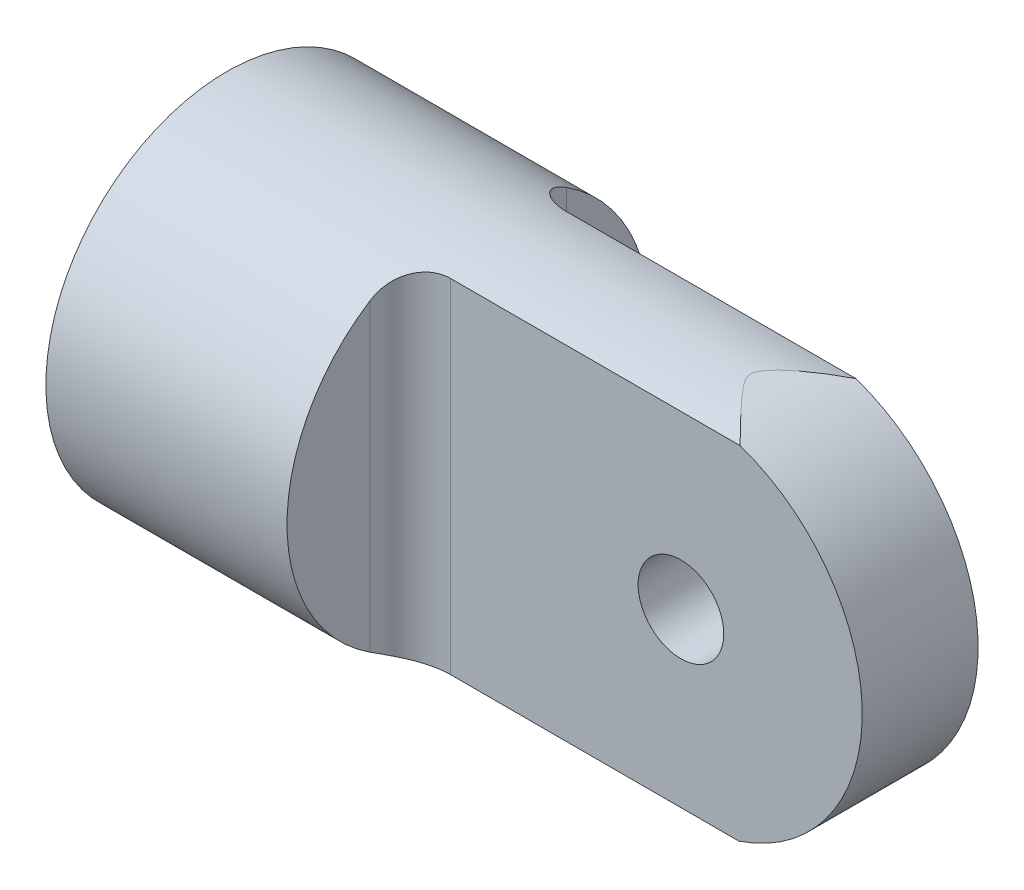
ISO-10303-21;
HEADER;
FILE_DESCRIPTION(('STEP AP214'),'2;1');
FILE_NAME('part.step','',(''),(''),'','','');
FILE_SCHEMA(('AUTOMOTIVE_DESIGN { 1 0 10303 214 1 1 1 1 }'));
ENDSEC;
DATA;
#1=APPLICATION_CONTEXT('core data for automotive mechanical design processes');
#2=APPLICATION_PROTOCOL_DEFINITION('international standard','automotive_design',2000,#1);
#3=PRODUCT_CONTEXT('',#1,'mechanical');
#4=PRODUCT('Part','Part','',(#3));
#5=PRODUCT_RELATED_PRODUCT_CATEGORY('part','',(#4));
#6=PRODUCT_DEFINITION_FORMATION('','',#4);
#7=PRODUCT_DEFINITION_CONTEXT('part definition',#1,'design');
#8=PRODUCT_DEFINITION('design','',#6,#7);
#9=PRODUCT_DEFINITION_SHAPE('','',#8);
#10=(LENGTH_UNIT() NAMED_UNIT(*) SI_UNIT(.MILLI.,.METRE.));
#11=(NAMED_UNIT(*) PLANE_ANGLE_UNIT() SI_UNIT($,.RADIAN.));
#12=(NAMED_UNIT(*) SI_UNIT($,.STERADIAN.) SOLID_ANGLE_UNIT());
#13=UNCERTAINTY_MEASURE_WITH_UNIT(LENGTH_MEASURE(1.E-05),#10,'distance_accuracy_value','');
#14=(GEOMETRIC_REPRESENTATION_CONTEXT(3) GLOBAL_UNCERTAINTY_ASSIGNED_CONTEXT((#13)) GLOBAL_UNIT_ASSIGNED_CONTEXT((#10,
#11,#12)) REPRESENTATION_CONTEXT('',''));
#15=CARTESIAN_POINT('',(0.,0.,0.));
#16=DIRECTION('',(0.,0.,1.));
#17=DIRECTION('',(1.,0.,0.));
#18=AXIS2_PLACEMENT_3D('',#15,#16,#17);
#19=CARTESIAN_POINT('',(-10.239375,2.02347164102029,1.44695478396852));
#20=DIRECTION('',(0.,-0.581668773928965,0.813425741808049));
#21=DIRECTION('',(0.,0.813425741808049,0.581668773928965));
#22=AXIS2_PLACEMENT_3D('',#19,#20,#21);
#23=PLANE('',#22);
#24=DIRECTION('',(1.,0.,0.));
#25=VECTOR('',#24,1.);
#26=CARTESIAN_POINT('',(-10.239375,2.02347164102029,1.44695478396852));
#27=LINE('',#26,#25);
#28=CARTESIAN_POINT('',(-10.398125,2.02347164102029,1.44695478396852));
#29=VERTEX_POINT('',#28);
#30=CARTESIAN_POINT('',(-10.080625,2.02347164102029,1.44695478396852));
#31=VERTEX_POINT('',#30);
#32=EDGE_CURVE('P0_E25',#29,#31,#27,.T.);
#33=ORIENTED_EDGE('',*,*,#32,.T.);
#34=DIRECTION('',(0.5,0.704447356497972,0.503739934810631));
#35=VECTOR('',#34,1.);
#36=CARTESIAN_POINT('',(-9.88218750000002,2.30304918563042,1.64687657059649));
#37=LINE('',#36,#35);
#38=CARTESIAN_POINT('',(-9.68375000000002,2.58262673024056,1.84679835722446));
#39=VERTEX_POINT('',#38);
#40=EDGE_CURVE('P0_E20',#31,#39,#37,.T.);
#41=ORIENTED_EDGE('',*,*,#40,.T.);
#42=DIRECTION('',(0.,0.813425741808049,0.581668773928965));
#43=VECTOR('',#42,1.);
#44=CARTESIAN_POINT('',(-9.68375000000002,2.66035395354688,1.90237995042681));
#45=LINE('',#44,#43);
#46=CARTESIAN_POINT('',(-9.68375000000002,2.73808117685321,1.95796154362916));
#47=VERTEX_POINT('',#46);
#48=EDGE_CURVE('P0_E84',#39,#47,#45,.T.);
#49=ORIENTED_EDGE('',*,*,#48,.T.);
#50=DIRECTION('',(-0.500000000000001,0.704447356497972,0.503739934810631));
#51=VECTOR('',#50,1.);
#52=CARTESIAN_POINT('',(-9.92187500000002,3.07357423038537,2.19786768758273));
#53=LINE('',#52,#51);
#54=CARTESIAN_POINT('',(-10.16,3.40906728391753,2.43777383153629));
#55=VERTEX_POINT('',#54);
#56=EDGE_CURVE('P0_E233',#47,#55,#53,.T.);
#57=ORIENTED_EDGE('',*,*,#56,.T.);
#58=DIRECTION('',(-1.,0.,0.));
#59=VECTOR('',#58,1.);
#60=CARTESIAN_POINT('',(-10.239375,3.40906728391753,2.43777383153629));
#61=LINE('',#60,#59);
#62=CARTESIAN_POINT('',(-10.31875,3.40906728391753,2.43777383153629));
#63=VERTEX_POINT('',#62);
#64=EDGE_CURVE('P0_E229',#55,#63,#61,.T.);
#65=ORIENTED_EDGE('',*,*,#64,.T.);
#66=DIRECTION('',(-0.500000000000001,-0.704447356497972,-0.503739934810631));
#67=VECTOR('',#66,1.);
#68=CARTESIAN_POINT('',(-10.556875,3.07357423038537,2.19786768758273));
#69=LINE('',#68,#67);
#70=CARTESIAN_POINT('',(-10.795,2.73808117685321,1.95796154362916));
#71=VERTEX_POINT('',#70);
#72=EDGE_CURVE('P0_E223',#63,#71,#69,.T.);
#73=ORIENTED_EDGE('',*,*,#72,.T.);
#74=DIRECTION('',(0.,-0.813425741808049,-0.581668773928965));
#75=VECTOR('',#74,1.);
#76=CARTESIAN_POINT('',(-10.795,2.66035395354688,1.90237995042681));
#77=LINE('',#76,#75);
#78=CARTESIAN_POINT('',(-10.795,2.58262673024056,1.84679835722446));
#79=VERTEX_POINT('',#78);
#80=EDGE_CURVE('P0_E208',#71,#79,#77,.T.);
#81=ORIENTED_EDGE('',*,*,#80,.T.);
#82=DIRECTION('',(0.5,-0.704447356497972,-0.503739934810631));
#83=VECTOR('',#82,1.);
#84=CARTESIAN_POINT('',(-10.5965625,2.30304918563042,1.64687657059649));
#85=LINE('',#84,#83);
#86=EDGE_CURVE('P0_E41',#79,#29,#85,.T.);
#87=ORIENTED_EDGE('',*,*,#86,.T.);
#88=EDGE_LOOP('',(#33,#41,#49,#57,#65,#73,#81,#87));
#89=FACE_BOUND('',#88,.T.);
#90=ADVANCED_FACE('P0_F16',(#89),#23,.T.);
#91=CARTESIAN_POINT('',(-15.319375,2.02347164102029,1.44695478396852));
#92=DIRECTION('',(0.,0.581668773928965,-0.813425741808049));
#93=DIRECTION('',(0.,-0.813425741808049,-0.581668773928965));
#94=AXIS2_PLACEMENT_3D('',#91,#92,#93);
#95=PLANE('',#94);
#96=DIRECTION('',(-1.,0.,0.));
#97=VECTOR('',#96,1.);
#98=CARTESIAN_POINT('',(-15.319375,2.02347164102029,1.44695478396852));
#99=LINE('',#98,#97);
#100=CARTESIAN_POINT('',(-15.160625,2.02347164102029,1.44695478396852));
#101=VERTEX_POINT('',#100);
#102=CARTESIAN_POINT('',(-15.478125,2.02347164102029,1.44695478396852));
#103=VERTEX_POINT('',#102);
#104=EDGE_CURVE('P0_E11',#101,#103,#99,.T.);
#105=ORIENTED_EDGE('',*,*,#104,.T.);
#106=DIRECTION('',(-0.5,0.704447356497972,0.503739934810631));
#107=VECTOR('',#106,1.);
#108=CARTESIAN_POINT('',(-15.6765625,2.30304918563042,1.64687657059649));
#109=LINE('',#108,#107);
#110=CARTESIAN_POINT('',(-15.875,2.58262673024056,1.84679835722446));
#111=VERTEX_POINT('',#110);
#112=EDGE_CURVE('P0_E270',#103,#111,#109,.T.);
#113=ORIENTED_EDGE('',*,*,#112,.T.);
#114=DIRECTION('',(0.,0.813425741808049,0.581668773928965));
#115=VECTOR('',#114,1.);
#116=CARTESIAN_POINT('',(-15.875,2.66035395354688,1.90237995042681));
#117=LINE('',#116,#115);
#118=CARTESIAN_POINT('',(-15.875,2.73808117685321,1.95796154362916));
#119=VERTEX_POINT('',#118);
#120=EDGE_CURVE('P0_E216',#111,#119,#117,.T.);
#121=ORIENTED_EDGE('',*,*,#120,.T.);
#122=DIRECTION('',(0.500000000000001,0.704447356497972,0.503739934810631));
#123=VECTOR('',#122,1.);
#124=CARTESIAN_POINT('',(-15.636875,3.07357423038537,2.19786768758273));
#125=LINE('',#124,#123);
#126=CARTESIAN_POINT('',(-15.39875,3.40906728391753,2.43777383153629));
#127=VERTEX_POINT('',#126);
#128=EDGE_CURVE('P0_E214',#119,#127,#125,.T.);
#129=ORIENTED_EDGE('',*,*,#128,.T.);
#130=DIRECTION('',(1.,0.,0.));
#131=VECTOR('',#130,1.);
#132=CARTESIAN_POINT('',(-15.319375,3.40906728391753,2.43777383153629));
#133=LINE('',#132,#131);
#134=CARTESIAN_POINT('',(-15.24,3.40906728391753,2.43777383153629));
#135=VERTEX_POINT('',#134);
#136=EDGE_CURVE('P0_E225',#127,#135,#133,.T.);
#137=ORIENTED_EDGE('',*,*,#136,.T.);
#138=DIRECTION('',(0.500000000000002,-0.704447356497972,-0.503739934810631));
#139=VECTOR('',#138,1.);
#140=CARTESIAN_POINT('',(-15.001875,3.07357423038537,2.19786768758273));
#141=LINE('',#140,#139);
#142=CARTESIAN_POINT('',(-14.76375,2.73808117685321,1.95796154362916));
#143=VERTEX_POINT('',#142);
#144=EDGE_CURVE('P0_E231',#135,#143,#141,.T.);
#145=ORIENTED_EDGE('',*,*,#144,.T.);
#146=DIRECTION('',(0.,-0.813425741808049,-0.581668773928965));
#147=VECTOR('',#146,1.);
#148=CARTESIAN_POINT('',(-14.76375,2.66035395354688,1.90237995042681));
#149=LINE('',#148,#147);
#150=CARTESIAN_POINT('',(-14.76375,2.58262673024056,1.84679835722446));
#151=VERTEX_POINT('',#150);
#152=EDGE_CURVE('P0_E102',#143,#151,#149,.T.);
#153=ORIENTED_EDGE('',*,*,#152,.T.);
#154=DIRECTION('',(-0.5,-0.704447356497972,-0.503739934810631));
#155=VECTOR('',#154,1.);
#156=CARTESIAN_POINT('',(-14.9621875,2.30304918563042,1.64687657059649));
#157=LINE('',#156,#155);
#158=EDGE_CURVE('P0_E89',#151,#101,#157,.T.);
#159=ORIENTED_EDGE('',*,*,#158,.T.);
#160=EDGE_LOOP('',(#105,#113,#121,#129,#137,#145,#153,#159));
#161=FACE_BOUND('',#160,.T.);
#162=ADVANCED_FACE('P0_F18',(#161),#95,.T.);
#163=CARTESIAN_POINT('',(-10.398125,2.02347164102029,1.44695478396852));
#164=CARTESIAN_POINT('',(-10.4775,2.62281993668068,0.608805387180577));
#165=CARTESIAN_POINT('',(-10.556875,2.45396205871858,-0.407658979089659));
#166=CARTESIAN_POINT('',(-10.63625,2.28510418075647,-1.4241233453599));
#167=CARTESIAN_POINT('',(-10.715625,1.44695478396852,-2.02347164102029));
#168=CARTESIAN_POINT('',(-10.795,0.608805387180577,-2.62281993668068));
#169=CARTESIAN_POINT('',(-10.874375,-0.407658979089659,-2.45396205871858));
#170=CARTESIAN_POINT('',(-10.95375,-1.4241233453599,-2.28510418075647));
#171=CARTESIAN_POINT('',(-11.033125,-2.02347164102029,-1.44695478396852));
#172=CARTESIAN_POINT('',(-11.1125,-2.62281993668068,-0.608805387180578));
#173=CARTESIAN_POINT('',(-11.191875,-2.45396205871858,0.407658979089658));
#174=CARTESIAN_POINT('',(-11.27125,-2.28510418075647,1.42412334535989));
#175=CARTESIAN_POINT('',(-11.350625,-1.44695478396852,2.02347164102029));
#176=CARTESIAN_POINT('',(-11.43,-0.608805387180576,2.62281993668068));
#177=CARTESIAN_POINT('',(-11.509375,0.407658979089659,2.45396205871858));
#178=CARTESIAN_POINT('',(-11.58875,1.42412334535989,2.28510418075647));
#179=CARTESIAN_POINT('',(-11.668125,2.02347164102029,1.44695478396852));
#180=CARTESIAN_POINT('',(-11.7475,2.62281993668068,0.608805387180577));
#181=CARTESIAN_POINT('',(-11.826875,2.45396205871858,-0.407658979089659));
#182=CARTESIAN_POINT('',(-11.90625,2.28510418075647,-1.4241233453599));
#183=CARTESIAN_POINT('',(-11.985625,1.44695478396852,-2.02347164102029));
#184=CARTESIAN_POINT('',(-12.065,0.608805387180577,-2.62281993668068));
#185=CARTESIAN_POINT('',(-12.144375,-0.407658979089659,-2.45396205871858));
#186=CARTESIAN_POINT('',(-12.22375,-1.4241233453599,-2.28510418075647));
#187=CARTESIAN_POINT('',(-12.303125,-2.02347164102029,-1.44695478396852));
#188=CARTESIAN_POINT('',(-12.3825,-2.62281993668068,-0.608805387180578));
#189=CARTESIAN_POINT('',(-12.461875,-2.45396205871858,0.407658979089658));
#190=CARTESIAN_POINT('',(-12.54125,-2.28510418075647,1.42412334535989));
#191=CARTESIAN_POINT('',(-12.620625,-1.44695478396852,2.02347164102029));
#192=CARTESIAN_POINT('',(-12.7,-0.608805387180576,2.62281993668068));
#193=CARTESIAN_POINT('',(-12.779375,0.407658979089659,2.45396205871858));
#194=CARTESIAN_POINT('',(-12.85875,1.42412334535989,2.28510418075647));
#195=CARTESIAN_POINT('',(-12.938125,2.02347164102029,1.44695478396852));
#196=CARTESIAN_POINT('',(-13.0175,2.62281993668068,0.608805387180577));
#197=CARTESIAN_POINT('',(-13.096875,2.45396205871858,-0.407658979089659));
#198=CARTESIAN_POINT('',(-13.17625,2.28510418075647,-1.4241233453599));
#199=CARTESIAN_POINT('',(-13.255625,1.44695478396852,-2.02347164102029));
#200=CARTESIAN_POINT('',(-13.335,0.608805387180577,-2.62281993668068));
#201=CARTESIAN_POINT('',(-13.414375,-0.407658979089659,-2.45396205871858));
#202=CARTESIAN_POINT('',(-13.49375,-1.4241233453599,-2.28510418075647));
#203=CARTESIAN_POINT('',(-13.573125,-2.02347164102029,-1.44695478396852));
#204=CARTESIAN_POINT('',(-13.6525,-2.62281993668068,-0.608805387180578));
#205=CARTESIAN_POINT('',(-13.731875,-2.45396205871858,0.407658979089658));
#206=CARTESIAN_POINT('',(-13.81125,-2.28510418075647,1.42412334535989));
#207=CARTESIAN_POINT('',(-13.890625,-1.44695478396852,2.02347164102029));
#208=CARTESIAN_POINT('',(-13.97,-0.608805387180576,2.62281993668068));
#209=CARTESIAN_POINT('',(-14.049375,0.407658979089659,2.45396205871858));
#210=CARTESIAN_POINT('',(-14.12875,1.42412334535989,2.28510418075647));
#211=CARTESIAN_POINT('',(-14.208125,2.02347164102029,1.44695478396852));
#212=CARTESIAN_POINT('',(-14.2875,2.62281993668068,0.608805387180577));
#213=CARTESIAN_POINT('',(-14.366875,2.45396205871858,-0.407658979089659));
#214=CARTESIAN_POINT('',(-14.44625,2.28510418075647,-1.4241233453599));
#215=CARTESIAN_POINT('',(-14.525625,1.44695478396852,-2.02347164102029));
#216=CARTESIAN_POINT('',(-14.605,0.608805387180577,-2.62281993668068));
#217=CARTESIAN_POINT('',(-14.684375,-0.407658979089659,-2.45396205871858));
#218=CARTESIAN_POINT('',(-14.76375,-1.4241233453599,-2.28510418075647));
#219=CARTESIAN_POINT('',(-14.843125,-2.02347164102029,-1.44695478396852));
#220=CARTESIAN_POINT('',(-14.9225,-2.62281993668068,-0.608805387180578));
#221=CARTESIAN_POINT('',(-15.001875,-2.45396205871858,0.407658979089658));
#222=CARTESIAN_POINT('',(-15.08125,-2.28510418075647,1.42412334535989));
#223=CARTESIAN_POINT('',(-15.160625,-1.44695478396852,2.02347164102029));
#224=CARTESIAN_POINT('',(-15.24,-0.608805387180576,2.62281993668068));
#225=CARTESIAN_POINT('',(-15.319375,0.407658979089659,2.45396205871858));
#226=CARTESIAN_POINT('',(-15.39875,1.42412334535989,2.28510418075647));
#227=CARTESIAN_POINT('',(-15.478125,2.02347164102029,1.44695478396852));
#228=CARTESIAN_POINT('',(-10.080625,2.02347164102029,1.44695478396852));
#229=CARTESIAN_POINT('',(-10.16,2.62281993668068,0.608805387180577));
#230=CARTESIAN_POINT('',(-10.239375,2.45396205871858,-0.407658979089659));
#231=CARTESIAN_POINT('',(-10.31875,2.28510418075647,-1.4241233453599));
#232=CARTESIAN_POINT('',(-10.398125,1.44695478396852,-2.02347164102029));
#233=CARTESIAN_POINT('',(-10.4775,0.608805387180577,-2.62281993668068));
#234=CARTESIAN_POINT('',(-10.556875,-0.407658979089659,-2.45396205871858));
#235=CARTESIAN_POINT('',(-10.63625,-1.4241233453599,-2.28510418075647));
#236=CARTESIAN_POINT('',(-10.715625,-2.02347164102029,-1.44695478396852));
#237=CARTESIAN_POINT('',(-10.795,-2.62281993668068,-0.608805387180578));
#238=CARTESIAN_POINT('',(-10.874375,-2.45396205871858,0.407658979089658));
#239=CARTESIAN_POINT('',(-10.95375,-2.28510418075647,1.42412334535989));
#240=CARTESIAN_POINT('',(-11.033125,-1.44695478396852,2.02347164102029));
#241=CARTESIAN_POINT('',(-11.1125,-0.608805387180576,2.62281993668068));
#242=CARTESIAN_POINT('',(-11.191875,0.407658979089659,2.45396205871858));
#243=CARTESIAN_POINT('',(-11.27125,1.42412334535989,2.28510418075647));
#244=CARTESIAN_POINT('',(-11.350625,2.02347164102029,1.44695478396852));
#245=CARTESIAN_POINT('',(-11.43,2.62281993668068,0.608805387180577));
#246=CARTESIAN_POINT('',(-11.509375,2.45396205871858,-0.407658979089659));
#247=CARTESIAN_POINT('',(-11.58875,2.28510418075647,-1.4241233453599));
#248=CARTESIAN_POINT('',(-11.668125,1.44695478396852,-2.02347164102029));
#249=CARTESIAN_POINT('',(-11.7475,0.608805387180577,-2.62281993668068));
#250=CARTESIAN_POINT('',(-11.826875,-0.407658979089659,-2.45396205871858));
#251=CARTESIAN_POINT('',(-11.90625,-1.4241233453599,-2.28510418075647));
#252=CARTESIAN_POINT('',(-11.985625,-2.02347164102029,-1.44695478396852));
#253=CARTESIAN_POINT('',(-12.065,-2.62281993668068,-0.608805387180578));
#254=CARTESIAN_POINT('',(-12.144375,-2.45396205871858,0.407658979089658));
#255=CARTESIAN_POINT('',(-12.22375,-2.28510418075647,1.42412334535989));
#256=CARTESIAN_POINT('',(-12.303125,-1.44695478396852,2.02347164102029));
#257=CARTESIAN_POINT('',(-12.3825,-0.608805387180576,2.62281993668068));
#258=CARTESIAN_POINT('',(-12.461875,0.407658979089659,2.45396205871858));
#259=CARTESIAN_POINT('',(-12.54125,1.42412334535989,2.28510418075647));
#260=CARTESIAN_POINT('',(-12.620625,2.02347164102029,1.44695478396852));
#261=CARTESIAN_POINT('',(-12.7,2.62281993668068,0.608805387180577));
#262=CARTESIAN_POINT('',(-12.779375,2.45396205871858,-0.407658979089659));
#263=CARTESIAN_POINT('',(-12.85875,2.28510418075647,-1.4241233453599));
#264=CARTESIAN_POINT('',(-12.938125,1.44695478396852,-2.02347164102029));
#265=CARTESIAN_POINT('',(-13.0175,0.608805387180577,-2.62281993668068));
#266=CARTESIAN_POINT('',(-13.096875,-0.407658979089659,-2.45396205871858));
#267=CARTESIAN_POINT('',(-13.17625,-1.4241233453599,-2.28510418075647));
#268=CARTESIAN_POINT('',(-13.255625,-2.02347164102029,-1.44695478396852));
#269=CARTESIAN_POINT('',(-13.335,-2.62281993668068,-0.608805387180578));
#270=CARTESIAN_POINT('',(-13.414375,-2.45396205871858,0.407658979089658));
#271=CARTESIAN_POINT('',(-13.49375,-2.28510418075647,1.42412334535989));
#272=CARTESIAN_POINT('',(-13.573125,-1.44695478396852,2.02347164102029));
#273=CARTESIAN_POINT('',(-13.6525,-0.608805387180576,2.62281993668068));
#274=CARTESIAN_POINT('',(-13.731875,0.407658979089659,2.45396205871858));
#275=CARTESIAN_POINT('',(-13.81125,1.42412334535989,2.28510418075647));
#276=CARTESIAN_POINT('',(-13.890625,2.02347164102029,1.44695478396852));
#277=CARTESIAN_POINT('',(-13.97,2.62281993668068,0.608805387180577));
#278=CARTESIAN_POINT('',(-14.049375,2.45396205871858,-0.407658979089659));
#279=CARTESIAN_POINT('',(-14.12875,2.28510418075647,-1.4241233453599));
#280=CARTESIAN_POINT('',(-14.208125,1.44695478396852,-2.02347164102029));
#281=CARTESIAN_POINT('',(-14.2875,0.608805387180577,-2.62281993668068));
#282=CARTESIAN_POINT('',(-14.366875,-0.407658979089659,-2.45396205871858));
#283=CARTESIAN_POINT('',(-14.44625,-1.4241233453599,-2.28510418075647));
#284=CARTESIAN_POINT('',(-14.525625,-2.02347164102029,-1.44695478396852));
#285=CARTESIAN_POINT('',(-14.605,-2.62281993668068,-0.608805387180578));
#286=CARTESIAN_POINT('',(-14.684375,-2.45396205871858,0.407658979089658));
#287=CARTESIAN_POINT('',(-14.76375,-2.28510418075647,1.42412334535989));
#288=CARTESIAN_POINT('',(-14.843125,-1.44695478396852,2.02347164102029));
#289=CARTESIAN_POINT('',(-14.9225,-0.608805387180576,2.62281993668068));
#290=CARTESIAN_POINT('',(-15.001875,0.407658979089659,2.45396205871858));
#291=CARTESIAN_POINT('',(-15.08125,1.42412334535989,2.28510418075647));
#292=CARTESIAN_POINT('',(-15.160625,2.02347164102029,1.44695478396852));
#293=(BOUNDED_SURFACE() B_SPLINE_SURFACE(1,2,((#163,#164,#165,#166,#167,#168,#169,#170,#171,
#172,#173,#174,#175,#176,#177,#178,#179,#180,#181,#182,#183,#184,#185,#186,#187,#188,#189,#190,
#191,#192,#193,#194,#195,#196,#197,#198,#199,#200,#201,#202,#203,#204,#205,#206,#207,#208,#209,
#210,#211,#212,#213,#214,#215,#216,#217,#218,#219,#220,#221,#222,#223,#224,#225,#226,#227),
(#228,#229,#230,#231,#232,#233,#234,#235,#236,#237,#238,#239,#240,#241,#242,#243,#244,#245,#246,
#247,#248,#249,#250,#251,#252,#253,#254,#255,#256,#257,#258,#259,#260,#261,#262,#263,#264,#265,
#266,#267,#268,#269,#270,#271,#272,#273,#274,#275,#276,#277,#278,#279,#280,#281,#282,#283,#284,
#285,#286,#287,#288,#289,#290,#291,#292)),.UNSPECIFIED.,.F.,.F.,
.F.) B_SPLINE_SURFACE_WITH_KNOTS((2,2),(3,2,2,2,2,2,2,2,2,2,2,2,2,2,2,2,2,2,2,2,2,2,2,2,2,2,2,2,
2,2,2,2,3),(0.,1.),(0.,0.03125,0.0625,0.09375,0.125,0.15625,0.1875,0.21875,0.25,0.28125,0.3125,
0.34375,0.375,0.40625,0.4375,0.46875,0.5,0.53125,0.5625,0.59375,0.625,0.65625,0.6875,0.71875,
0.75,0.78125,0.8125,0.84375,0.875,0.90625,0.9375,0.96875,1.),
.UNSPECIFIED.) GEOMETRIC_REPRESENTATION_ITEM() RATIONAL_B_SPLINE_SURFACE(((1.,0.923879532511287,
1.,0.923879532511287,1.,0.923879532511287,1.,0.923879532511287,1.,0.923879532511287,1.,
0.923879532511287,1.,0.923879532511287,1.,0.923879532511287,1.,0.923879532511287,1.,
0.923879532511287,1.,0.923879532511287,1.,0.923879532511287,1.,0.923879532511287,1.,
0.923879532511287,1.,0.923879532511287,1.,0.923879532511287,1.,0.923879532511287,1.,
0.923879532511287,1.,0.923879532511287,1.,0.923879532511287,1.,0.923879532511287,1.,
0.923879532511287,1.,0.923879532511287,1.,0.923879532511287,1.,0.923879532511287,1.,
0.923879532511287,1.,0.923879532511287,1.,0.923879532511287,1.,0.923879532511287,1.,
0.923879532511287,1.,0.923879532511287,1.,0.923879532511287,1.),(1.,0.923879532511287,1.,
0.923879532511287,1.,0.923879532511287,1.,0.923879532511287,1.,0.923879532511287,1.,
0.923879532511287,1.,0.923879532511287,1.,0.923879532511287,1.,0.923879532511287,1.,
0.923879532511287,1.,0.923879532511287,1.,0.923879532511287,1.,0.923879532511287,1.,
0.923879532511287,1.,0.923879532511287,1.,0.923879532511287,1.,0.923879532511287,1.,
0.923879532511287,1.,0.923879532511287,1.,0.923879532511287,1.,0.923879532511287,1.,
0.923879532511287,1.,0.923879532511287,1.,0.923879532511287,1.,0.923879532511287,1.,
0.923879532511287,1.,0.923879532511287,1.,0.923879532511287,1.,0.923879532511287,1.,
0.923879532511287,1.,0.923879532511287,1.,0.923879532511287,1.))) REPRESENTATION_ITEM('') SURFACE());
#294=CARTESIAN_POINT('',(-10.398125,2.02347164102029,1.44695478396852));
#295=CARTESIAN_POINT('',(-10.4775,2.62281993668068,0.608805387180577));
#296=CARTESIAN_POINT('',(-10.556875,2.45396205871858,-0.407658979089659));
#297=CARTESIAN_POINT('',(-10.63625,2.28510418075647,-1.4241233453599));
#298=CARTESIAN_POINT('',(-10.715625,1.44695478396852,-2.02347164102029));
#299=CARTESIAN_POINT('',(-10.795,0.608805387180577,-2.62281993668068));
#300=CARTESIAN_POINT('',(-10.874375,-0.407658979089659,-2.45396205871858));
#301=CARTESIAN_POINT('',(-10.95375,-1.4241233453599,-2.28510418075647));
#302=CARTESIAN_POINT('',(-11.033125,-2.02347164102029,-1.44695478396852));
#303=CARTESIAN_POINT('',(-11.1125,-2.62281993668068,-0.608805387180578));
#304=CARTESIAN_POINT('',(-11.191875,-2.45396205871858,0.407658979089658));
#305=CARTESIAN_POINT('',(-11.27125,-2.28510418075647,1.42412334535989));
#306=CARTESIAN_POINT('',(-11.350625,-1.44695478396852,2.02347164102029));
#307=CARTESIAN_POINT('',(-11.43,-0.608805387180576,2.62281993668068));
#308=CARTESIAN_POINT('',(-11.509375,0.407658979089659,2.45396205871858));
#309=CARTESIAN_POINT('',(-11.58875,1.42412334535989,2.28510418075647));
#310=CARTESIAN_POINT('',(-11.668125,2.02347164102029,1.44695478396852));
#311=CARTESIAN_POINT('',(-11.7475,2.62281993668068,0.608805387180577));
#312=CARTESIAN_POINT('',(-11.826875,2.45396205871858,-0.407658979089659));
#313=CARTESIAN_POINT('',(-11.90625,2.28510418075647,-1.4241233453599));
#314=CARTESIAN_POINT('',(-11.985625,1.44695478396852,-2.02347164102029));
#315=CARTESIAN_POINT('',(-12.065,0.608805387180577,-2.62281993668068));
#316=CARTESIAN_POINT('',(-12.144375,-0.407658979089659,-2.45396205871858));
#317=CARTESIAN_POINT('',(-12.22375,-1.4241233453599,-2.28510418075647));
#318=CARTESIAN_POINT('',(-12.303125,-2.02347164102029,-1.44695478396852));
#319=CARTESIAN_POINT('',(-12.3825,-2.62281993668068,-0.608805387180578));
#320=CARTESIAN_POINT('',(-12.461875,-2.45396205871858,0.407658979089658));
#321=CARTESIAN_POINT('',(-12.54125,-2.28510418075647,1.42412334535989));
#322=CARTESIAN_POINT('',(-12.620625,-1.44695478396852,2.02347164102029));
#323=CARTESIAN_POINT('',(-12.7,-0.608805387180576,2.62281993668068));
#324=CARTESIAN_POINT('',(-12.779375,0.407658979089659,2.45396205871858));
#325=CARTESIAN_POINT('',(-12.85875,1.42412334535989,2.28510418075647));
#326=CARTESIAN_POINT('',(-12.938125,2.02347164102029,1.44695478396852));
#327=CARTESIAN_POINT('',(-13.0175,2.62281993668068,0.608805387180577));
#328=CARTESIAN_POINT('',(-13.096875,2.45396205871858,-0.407658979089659));
#329=CARTESIAN_POINT('',(-13.17625,2.28510418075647,-1.4241233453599));
#330=CARTESIAN_POINT('',(-13.255625,1.44695478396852,-2.02347164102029));
#331=CARTESIAN_POINT('',(-13.335,0.608805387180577,-2.62281993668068));
#332=CARTESIAN_POINT('',(-13.414375,-0.407658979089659,-2.45396205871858));
#333=CARTESIAN_POINT('',(-13.49375,-1.4241233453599,-2.28510418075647));
#334=CARTESIAN_POINT('',(-13.573125,-2.02347164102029,-1.44695478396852));
#335=CARTESIAN_POINT('',(-13.6525,-2.62281993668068,-0.608805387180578));
#336=CARTESIAN_POINT('',(-13.731875,-2.45396205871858,0.407658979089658));
#337=CARTESIAN_POINT('',(-13.81125,-2.28510418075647,1.42412334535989));
#338=CARTESIAN_POINT('',(-13.890625,-1.44695478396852,2.02347164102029));
#339=CARTESIAN_POINT('',(-13.97,-0.608805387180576,2.62281993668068));
#340=CARTESIAN_POINT('',(-14.049375,0.407658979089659,2.45396205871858));
#341=CARTESIAN_POINT('',(-14.12875,1.42412334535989,2.28510418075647));
#342=CARTESIAN_POINT('',(-14.208125,2.02347164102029,1.44695478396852));
#343=CARTESIAN_POINT('',(-14.2875,2.62281993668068,0.608805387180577));
#344=CARTESIAN_POINT('',(-14.366875,2.45396205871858,-0.407658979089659));
#345=CARTESIAN_POINT('',(-14.44625,2.28510418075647,-1.4241233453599));
#346=CARTESIAN_POINT('',(-14.525625,1.44695478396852,-2.02347164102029));
#347=CARTESIAN_POINT('',(-14.605,0.608805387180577,-2.62281993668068));
#348=CARTESIAN_POINT('',(-14.684375,-0.407658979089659,-2.45396205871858));
#349=CARTESIAN_POINT('',(-14.76375,-1.4241233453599,-2.28510418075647));
#350=CARTESIAN_POINT('',(-14.843125,-2.02347164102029,-1.44695478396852));
#351=CARTESIAN_POINT('',(-14.9225,-2.62281993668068,-0.608805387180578));
#352=CARTESIAN_POINT('',(-15.001875,-2.45396205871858,0.407658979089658));
#353=CARTESIAN_POINT('',(-15.08125,-2.28510418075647,1.42412334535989));
#354=CARTESIAN_POINT('',(-15.160625,-1.44695478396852,2.02347164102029));
#355=CARTESIAN_POINT('',(-15.24,-0.608805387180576,2.62281993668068));
#356=CARTESIAN_POINT('',(-15.319375,0.407658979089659,2.45396205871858));
#357=CARTESIAN_POINT('',(-15.39875,1.42412334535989,2.28510418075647));
#358=CARTESIAN_POINT('',(-15.478125,2.02347164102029,1.44695478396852));
#359=(BOUNDED_CURVE() B_SPLINE_CURVE(2,(#294,#295,#296,#297,#298,#299,#300,#301,#302,#303,#304,
#305,#306,#307,#308,#309,#310,#311,#312,#313,#314,#315,#316,#317,#318,#319,#320,#321,#322,#323,
#324,#325,#326,#327,#328,#329,#330,#331,#332,#333,#334,#335,#336,#337,#338,#339,#340,#341,#342,
#343,#344,#345,#346,#347,#348,#349,#350,#351,#352,#353,#354,#355,#356,#357,#358),.UNSPECIFIED.,
.F.,.F.) B_SPLINE_CURVE_WITH_KNOTS((3,2,2,2,2,2,2,2,2,2,2,2,2,2,2,2,2,2,2,2,2,2,2,2,2,2,2,2,2,2,
2,2,3),(0.,0.03125,0.0625,0.09375,0.125,0.15625,0.1875,0.21875,0.25,0.28125,0.3125,0.34375,
0.375,0.40625,0.4375,0.46875,0.5,0.53125,0.5625,0.59375,0.625,0.65625,0.6875,0.71875,0.75,
0.78125,0.8125,0.84375,0.875,0.90625,0.9375,0.96875,1.),
.UNSPECIFIED.) CURVE() GEOMETRIC_REPRESENTATION_ITEM() RATIONAL_B_SPLINE_CURVE((1.,
0.923879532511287,1.,0.923879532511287,1.,0.923879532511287,1.,0.923879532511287,1.,
0.923879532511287,1.,0.923879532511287,1.,0.923879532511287,1.,0.923879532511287,1.,
0.923879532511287,1.,0.923879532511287,1.,0.923879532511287,1.,0.923879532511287,1.,
0.923879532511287,1.,0.923879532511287,1.,0.923879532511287,1.,0.923879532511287,1.,
0.923879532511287,1.,0.923879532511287,1.,0.923879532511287,1.,0.923879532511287,1.,
0.923879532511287,1.,0.923879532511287,1.,0.923879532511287,1.,0.923879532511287,1.,
0.923879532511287,1.,0.923879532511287,1.,0.923879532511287,1.,0.923879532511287,1.,
0.923879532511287,1.,0.923879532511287,1.,0.923879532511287,1.,0.923879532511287,1.)) REPRESENTATION_ITEM(''));
#360=EDGE_CURVE('P0_E33',#29,#103,#359,.T.);
#361=CARTESIAN_POINT('',(-10.080625,2.02347164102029,1.44695478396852));
#362=CARTESIAN_POINT('',(-10.16,2.62281993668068,0.608805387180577));
#363=CARTESIAN_POINT('',(-10.239375,2.45396205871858,-0.407658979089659));
#364=CARTESIAN_POINT('',(-10.31875,2.28510418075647,-1.4241233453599));
#365=CARTESIAN_POINT('',(-10.398125,1.44695478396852,-2.02347164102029));
#366=CARTESIAN_POINT('',(-10.4775,0.608805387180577,-2.62281993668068));
#367=CARTESIAN_POINT('',(-10.556875,-0.407658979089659,-2.45396205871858));
#368=CARTESIAN_POINT('',(-10.63625,-1.4241233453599,-2.28510418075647));
#369=CARTESIAN_POINT('',(-10.715625,-2.02347164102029,-1.44695478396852));
#370=CARTESIAN_POINT('',(-10.795,-2.62281993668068,-0.608805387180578));
#371=CARTESIAN_POINT('',(-10.874375,-2.45396205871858,0.407658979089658));
#372=CARTESIAN_POINT('',(-10.95375,-2.28510418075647,1.42412334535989));
#373=CARTESIAN_POINT('',(-11.033125,-1.44695478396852,2.02347164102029));
#374=CARTESIAN_POINT('',(-11.1125,-0.608805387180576,2.62281993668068));
#375=CARTESIAN_POINT('',(-11.191875,0.407658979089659,2.45396205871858));
#376=CARTESIAN_POINT('',(-11.27125,1.42412334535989,2.28510418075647));
#377=CARTESIAN_POINT('',(-11.350625,2.02347164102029,1.44695478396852));
#378=CARTESIAN_POINT('',(-11.43,2.62281993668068,0.608805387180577));
#379=CARTESIAN_POINT('',(-11.509375,2.45396205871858,-0.407658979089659));
#380=CARTESIAN_POINT('',(-11.58875,2.28510418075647,-1.4241233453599));
#381=CARTESIAN_POINT('',(-11.668125,1.44695478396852,-2.02347164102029));
#382=CARTESIAN_POINT('',(-11.7475,0.608805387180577,-2.62281993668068));
#383=CARTESIAN_POINT('',(-11.826875,-0.407658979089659,-2.45396205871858));
#384=CARTESIAN_POINT('',(-11.90625,-1.4241233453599,-2.28510418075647));
#385=CARTESIAN_POINT('',(-11.985625,-2.02347164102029,-1.44695478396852));
#386=CARTESIAN_POINT('',(-12.065,-2.62281993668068,-0.608805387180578));
#387=CARTESIAN_POINT('',(-12.144375,-2.45396205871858,0.407658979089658));
#388=CARTESIAN_POINT('',(-12.22375,-2.28510418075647,1.42412334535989));
#389=CARTESIAN_POINT('',(-12.303125,-1.44695478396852,2.02347164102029));
#390=CARTESIAN_POINT('',(-12.3825,-0.608805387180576,2.62281993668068));
#391=CARTESIAN_POINT('',(-12.461875,0.407658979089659,2.45396205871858));
#392=CARTESIAN_POINT('',(-12.54125,1.42412334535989,2.28510418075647));
#393=CARTESIAN_POINT('',(-12.620625,2.02347164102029,1.44695478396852));
#394=CARTESIAN_POINT('',(-12.7,2.62281993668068,0.608805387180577));
#395=CARTESIAN_POINT('',(-12.779375,2.45396205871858,-0.407658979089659));
#396=CARTESIAN_POINT('',(-12.85875,2.28510418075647,-1.4241233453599));
#397=CARTESIAN_POINT('',(-12.938125,1.44695478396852,-2.02347164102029));
#398=CARTESIAN_POINT('',(-13.0175,0.608805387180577,-2.62281993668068));
#399=CARTESIAN_POINT('',(-13.096875,-0.407658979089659,-2.45396205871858));
#400=CARTESIAN_POINT('',(-13.17625,-1.4241233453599,-2.28510418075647));
#401=CARTESIAN_POINT('',(-13.255625,-2.02347164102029,-1.44695478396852));
#402=CARTESIAN_POINT('',(-13.335,-2.62281993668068,-0.608805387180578));
#403=CARTESIAN_POINT('',(-13.414375,-2.45396205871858,0.407658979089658));
#404=CARTESIAN_POINT('',(-13.49375,-2.28510418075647,1.42412334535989));
#405=CARTESIAN_POINT('',(-13.573125,-1.44695478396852,2.02347164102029));
#406=CARTESIAN_POINT('',(-13.6525,-0.608805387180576,2.62281993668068));
#407=CARTESIAN_POINT('',(-13.731875,0.407658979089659,2.45396205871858));
#408=CARTESIAN_POINT('',(-13.81125,1.42412334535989,2.28510418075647));
#409=CARTESIAN_POINT('',(-13.890625,2.02347164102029,1.44695478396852));
#410=CARTESIAN_POINT('',(-13.97,2.62281993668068,0.608805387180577));
#411=CARTESIAN_POINT('',(-14.049375,2.45396205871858,-0.407658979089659));
#412=CARTESIAN_POINT('',(-14.12875,2.28510418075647,-1.4241233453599));
#413=CARTESIAN_POINT('',(-14.208125,1.44695478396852,-2.02347164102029));
#414=CARTESIAN_POINT('',(-14.2875,0.608805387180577,-2.62281993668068));
#415=CARTESIAN_POINT('',(-14.366875,-0.407658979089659,-2.45396205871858));
#416=CARTESIAN_POINT('',(-14.44625,-1.4241233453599,-2.28510418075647));
#417=CARTESIAN_POINT('',(-14.525625,-2.02347164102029,-1.44695478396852));
#418=CARTESIAN_POINT('',(-14.605,-2.62281993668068,-0.608805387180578));
#419=CARTESIAN_POINT('',(-14.684375,-2.45396205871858,0.407658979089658));
#420=CARTESIAN_POINT('',(-14.76375,-2.28510418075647,1.42412334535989));
#421=CARTESIAN_POINT('',(-14.843125,-1.44695478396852,2.02347164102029));
#422=CARTESIAN_POINT('',(-14.9225,-0.608805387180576,2.62281993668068));
#423=CARTESIAN_POINT('',(-15.001875,0.407658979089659,2.45396205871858));
#424=CARTESIAN_POINT('',(-15.08125,1.42412334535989,2.28510418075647));
#425=CARTESIAN_POINT('',(-15.160625,2.02347164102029,1.44695478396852));
#426=(BOUNDED_CURVE() B_SPLINE_CURVE(2,(#361,#362,#363,#364,#365,#366,#367,#368,#369,#370,#371,
#372,#373,#374,#375,#376,#377,#378,#379,#380,#381,#382,#383,#384,#385,#386,#387,#388,#389,#390,
#391,#392,#393,#394,#395,#396,#397,#398,#399,#400,#401,#402,#403,#404,#405,#406,#407,#408,#409,
#410,#411,#412,#413,#414,#415,#416,#417,#418,#419,#420,#421,#422,#423,#424,#425),.UNSPECIFIED.,
.F.,.F.) B_SPLINE_CURVE_WITH_KNOTS((3,2,2,2,2,2,2,2,2,2,2,2,2,2,2,2,2,2,2,2,2,2,2,2,2,2,2,2,2,2,
2,2,3),(0.,0.03125,0.0625,0.09375,0.125,0.15625,0.1875,0.21875,0.25,0.28125,0.3125,0.34375,
0.375,0.40625,0.4375,0.46875,0.5,0.53125,0.5625,0.59375,0.625,0.65625,0.6875,0.71875,0.75,
0.78125,0.8125,0.84375,0.875,0.90625,0.9375,0.96875,1.),
.UNSPECIFIED.) CURVE() GEOMETRIC_REPRESENTATION_ITEM() RATIONAL_B_SPLINE_CURVE((1.,
0.923879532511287,1.,0.923879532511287,1.,0.923879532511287,1.,0.923879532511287,1.,
0.923879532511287,1.,0.923879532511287,1.,0.923879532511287,1.,0.923879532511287,1.,
0.923879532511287,1.,0.923879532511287,1.,0.923879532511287,1.,0.923879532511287,1.,
0.923879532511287,1.,0.923879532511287,1.,0.923879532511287,1.,0.923879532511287,1.,
0.923879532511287,1.,0.923879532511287,1.,0.923879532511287,1.,0.923879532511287,1.,
0.923879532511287,1.,0.923879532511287,1.,0.923879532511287,1.,0.923879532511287,1.,
0.923879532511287,1.,0.923879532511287,1.,0.923879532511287,1.,0.923879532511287,1.,
0.923879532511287,1.,0.923879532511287,1.,0.923879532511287,1.,0.923879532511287,1.)) REPRESENTATION_ITEM(''));
#427=EDGE_CURVE('P0_E96',#31,#101,#426,.T.);
#428=ORIENTED_EDGE('',*,*,#32,.F.);
#429=ORIENTED_EDGE('',*,*,#360,.T.);
#430=ORIENTED_EDGE('',*,*,#104,.F.);
#431=ORIENTED_EDGE('',*,*,#427,.F.);
#432=EDGE_LOOP('',(#428,#429,#430,#431));
#433=FACE_BOUND('',#432,.T.);
#434=ADVANCED_FACE('P0_F110',(#433),#293,.F.);
#435=CARTESIAN_POINT('',(-10.795,2.58262673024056,1.84679835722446));
#436=CARTESIAN_POINT('',(-10.874375,3.34759565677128,0.777039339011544));
#437=CARTESIAN_POINT('',(-10.95375,3.13207651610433,-0.520309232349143));
#438=CARTESIAN_POINT('',(-11.033125,2.91655737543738,-1.81765780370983));
#439=CARTESIAN_POINT('',(-11.1125,1.84679835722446,-2.58262673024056));
#440=CARTESIAN_POINT('',(-11.191875,0.777039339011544,-3.34759565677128));
#441=CARTESIAN_POINT('',(-11.27125,-0.520309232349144,-3.13207651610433));
#442=CARTESIAN_POINT('',(-11.350625,-1.81765780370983,-2.91655737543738));
#443=CARTESIAN_POINT('',(-11.43,-2.58262673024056,-1.84679835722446));
#444=CARTESIAN_POINT('',(-11.509375,-3.34759565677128,-0.777039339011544));
#445=CARTESIAN_POINT('',(-11.58875,-3.13207651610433,0.520309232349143));
#446=CARTESIAN_POINT('',(-11.668125,-2.91655737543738,1.81765780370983));
#447=CARTESIAN_POINT('',(-11.7475,-1.84679835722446,2.58262673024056));
#448=CARTESIAN_POINT('',(-11.826875,-0.777039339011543,3.34759565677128));
#449=CARTESIAN_POINT('',(-11.90625,0.520309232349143,3.13207651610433));
#450=CARTESIAN_POINT('',(-11.985625,1.81765780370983,2.91655737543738));
#451=CARTESIAN_POINT('',(-12.065,2.58262673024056,1.84679835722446));
#452=CARTESIAN_POINT('',(-12.144375,3.34759565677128,0.777039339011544));
#453=CARTESIAN_POINT('',(-12.22375,3.13207651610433,-0.520309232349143));
#454=CARTESIAN_POINT('',(-12.303125,2.91655737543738,-1.81765780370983));
#455=CARTESIAN_POINT('',(-12.3825,1.84679835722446,-2.58262673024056));
#456=CARTESIAN_POINT('',(-12.461875,0.777039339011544,-3.34759565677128));
#457=CARTESIAN_POINT('',(-12.54125,-0.520309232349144,-3.13207651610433));
#458=CARTESIAN_POINT('',(-12.620625,-1.81765780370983,-2.91655737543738));
#459=CARTESIAN_POINT('',(-12.7,-2.58262673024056,-1.84679835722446));
#460=CARTESIAN_POINT('',(-12.779375,-3.34759565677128,-0.777039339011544));
#461=CARTESIAN_POINT('',(-12.85875,-3.13207651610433,0.520309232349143));
#462=CARTESIAN_POINT('',(-12.938125,-2.91655737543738,1.81765780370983));
#463=CARTESIAN_POINT('',(-13.0175,-1.84679835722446,2.58262673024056));
#464=CARTESIAN_POINT('',(-13.096875,-0.777039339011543,3.34759565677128));
#465=CARTESIAN_POINT('',(-13.17625,0.520309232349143,3.13207651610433));
#466=CARTESIAN_POINT('',(-13.255625,1.81765780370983,2.91655737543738));
#467=CARTESIAN_POINT('',(-13.335,2.58262673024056,1.84679835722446));
#468=CARTESIAN_POINT('',(-13.414375,3.34759565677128,0.777039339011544));
#469=CARTESIAN_POINT('',(-13.49375,3.13207651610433,-0.520309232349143));
#470=CARTESIAN_POINT('',(-13.573125,2.91655737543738,-1.81765780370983));
#471=CARTESIAN_POINT('',(-13.6525,1.84679835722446,-2.58262673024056));
#472=CARTESIAN_POINT('',(-13.731875,0.777039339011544,-3.34759565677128));
#473=CARTESIAN_POINT('',(-13.81125,-0.520309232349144,-3.13207651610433));
#474=CARTESIAN_POINT('',(-13.890625,-1.81765780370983,-2.91655737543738));
#475=CARTESIAN_POINT('',(-13.97,-2.58262673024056,-1.84679835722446));
#476=CARTESIAN_POINT('',(-14.049375,-3.34759565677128,-0.777039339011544));
#477=CARTESIAN_POINT('',(-14.12875,-3.13207651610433,0.520309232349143));
#478=CARTESIAN_POINT('',(-14.208125,-2.91655737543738,1.81765780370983));
#479=CARTESIAN_POINT('',(-14.2875,-1.84679835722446,2.58262673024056));
#480=CARTESIAN_POINT('',(-14.366875,-0.777039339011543,3.34759565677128));
#481=CARTESIAN_POINT('',(-14.44625,0.520309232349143,3.13207651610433));
#482=CARTESIAN_POINT('',(-14.525625,1.81765780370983,2.91655737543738));
#483=CARTESIAN_POINT('',(-14.605,2.58262673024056,1.84679835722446));
#484=CARTESIAN_POINT('',(-14.684375,3.34759565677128,0.777039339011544));
#485=CARTESIAN_POINT('',(-14.76375,3.13207651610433,-0.520309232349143));
#486=CARTESIAN_POINT('',(-14.843125,2.91655737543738,-1.81765780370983));
#487=CARTESIAN_POINT('',(-14.9225,1.84679835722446,-2.58262673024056));
#488=CARTESIAN_POINT('',(-15.001875,0.777039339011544,-3.34759565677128));
#489=CARTESIAN_POINT('',(-15.08125,-0.520309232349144,-3.13207651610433));
#490=CARTESIAN_POINT('',(-15.160625,-1.81765780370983,-2.91655737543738));
#491=CARTESIAN_POINT('',(-15.24,-2.58262673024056,-1.84679835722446));
#492=CARTESIAN_POINT('',(-15.319375,-3.34759565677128,-0.777039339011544));
#493=CARTESIAN_POINT('',(-15.39875,-3.13207651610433,0.520309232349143));
#494=CARTESIAN_POINT('',(-15.478125,-2.91655737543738,1.81765780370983));
#495=CARTESIAN_POINT('',(-15.5575,-1.84679835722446,2.58262673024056));
#496=CARTESIAN_POINT('',(-15.636875,-0.777039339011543,3.34759565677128));
#497=CARTESIAN_POINT('',(-15.71625,0.520309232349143,3.13207651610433));
#498=CARTESIAN_POINT('',(-15.795625,1.81765780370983,2.91655737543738));
#499=CARTESIAN_POINT('',(-15.875,2.58262673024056,1.84679835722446));
#500=CARTESIAN_POINT('',(-10.398125,2.02347164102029,1.44695478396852));
#501=CARTESIAN_POINT('',(-10.4775,2.62281993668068,0.608805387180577));
#502=CARTESIAN_POINT('',(-10.556875,2.45396205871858,-0.407658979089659));
#503=CARTESIAN_POINT('',(-10.63625,2.28510418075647,-1.4241233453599));
#504=CARTESIAN_POINT('',(-10.715625,1.44695478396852,-2.02347164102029));
#505=CARTESIAN_POINT('',(-10.795,0.608805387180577,-2.62281993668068));
#506=CARTESIAN_POINT('',(-10.874375,-0.407658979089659,-2.45396205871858));
#507=CARTESIAN_POINT('',(-10.95375,-1.4241233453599,-2.28510418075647));
#508=CARTESIAN_POINT('',(-11.033125,-2.02347164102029,-1.44695478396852));
#509=CARTESIAN_POINT('',(-11.1125,-2.62281993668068,-0.608805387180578));
#510=CARTESIAN_POINT('',(-11.191875,-2.45396205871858,0.407658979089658));
#511=CARTESIAN_POINT('',(-11.27125,-2.28510418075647,1.42412334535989));
#512=CARTESIAN_POINT('',(-11.350625,-1.44695478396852,2.02347164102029));
#513=CARTESIAN_POINT('',(-11.43,-0.608805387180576,2.62281993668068));
#514=CARTESIAN_POINT('',(-11.509375,0.407658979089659,2.45396205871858));
#515=CARTESIAN_POINT('',(-11.58875,1.42412334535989,2.28510418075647));
#516=CARTESIAN_POINT('',(-11.668125,2.02347164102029,1.44695478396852));
#517=CARTESIAN_POINT('',(-11.7475,2.62281993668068,0.608805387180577));
#518=CARTESIAN_POINT('',(-11.826875,2.45396205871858,-0.407658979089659));
#519=CARTESIAN_POINT('',(-11.90625,2.28510418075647,-1.4241233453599));
#520=CARTESIAN_POINT('',(-11.985625,1.44695478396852,-2.02347164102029));
#521=CARTESIAN_POINT('',(-12.065,0.608805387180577,-2.62281993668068));
#522=CARTESIAN_POINT('',(-12.144375,-0.407658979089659,-2.45396205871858));
#523=CARTESIAN_POINT('',(-12.22375,-1.4241233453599,-2.28510418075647));
#524=CARTESIAN_POINT('',(-12.303125,-2.02347164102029,-1.44695478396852));
#525=CARTESIAN_POINT('',(-12.3825,-2.62281993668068,-0.608805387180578));
#526=CARTESIAN_POINT('',(-12.461875,-2.45396205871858,0.407658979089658));
#527=CARTESIAN_POINT('',(-12.54125,-2.28510418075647,1.42412334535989));
#528=CARTESIAN_POINT('',(-12.620625,-1.44695478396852,2.02347164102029));
#529=CARTESIAN_POINT('',(-12.7,-0.608805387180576,2.62281993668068));
#530=CARTESIAN_POINT('',(-12.779375,0.407658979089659,2.45396205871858));
#531=CARTESIAN_POINT('',(-12.85875,1.42412334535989,2.28510418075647));
#532=CARTESIAN_POINT('',(-12.938125,2.02347164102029,1.44695478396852));
#533=CARTESIAN_POINT('',(-13.0175,2.62281993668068,0.608805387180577));
#534=CARTESIAN_POINT('',(-13.096875,2.45396205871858,-0.407658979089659));
#535=CARTESIAN_POINT('',(-13.17625,2.28510418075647,-1.4241233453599));
#536=CARTESIAN_POINT('',(-13.255625,1.44695478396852,-2.02347164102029));
#537=CARTESIAN_POINT('',(-13.335,0.608805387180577,-2.62281993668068));
#538=CARTESIAN_POINT('',(-13.414375,-0.407658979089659,-2.45396205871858));
#539=CARTESIAN_POINT('',(-13.49375,-1.4241233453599,-2.28510418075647));
#540=CARTESIAN_POINT('',(-13.573125,-2.02347164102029,-1.44695478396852));
#541=CARTESIAN_POINT('',(-13.6525,-2.62281993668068,-0.608805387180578));
#542=CARTESIAN_POINT('',(-13.731875,-2.45396205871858,0.407658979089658));
#543=CARTESIAN_POINT('',(-13.81125,-2.28510418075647,1.42412334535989));
#544=CARTESIAN_POINT('',(-13.890625,-1.44695478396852,2.02347164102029));
#545=CARTESIAN_POINT('',(-13.97,-0.608805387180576,2.62281993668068));
#546=CARTESIAN_POINT('',(-14.049375,0.407658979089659,2.45396205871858));
#547=CARTESIAN_POINT('',(-14.12875,1.42412334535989,2.28510418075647));
#548=CARTESIAN_POINT('',(-14.208125,2.02347164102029,1.44695478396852));
#549=CARTESIAN_POINT('',(-14.2875,2.62281993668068,0.608805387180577));
#550=CARTESIAN_POINT('',(-14.366875,2.45396205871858,-0.407658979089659));
#551=CARTESIAN_POINT('',(-14.44625,2.28510418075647,-1.4241233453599));
#552=CARTESIAN_POINT('',(-14.525625,1.44695478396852,-2.02347164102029));
#553=CARTESIAN_POINT('',(-14.605,0.608805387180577,-2.62281993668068));
#554=CARTESIAN_POINT('',(-14.684375,-0.407658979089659,-2.45396205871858));
#555=CARTESIAN_POINT('',(-14.76375,-1.4241233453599,-2.28510418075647));
#556=CARTESIAN_POINT('',(-14.843125,-2.02347164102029,-1.44695478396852));
#557=CARTESIAN_POINT('',(-14.9225,-2.62281993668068,-0.608805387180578));
#558=CARTESIAN_POINT('',(-15.001875,-2.45396205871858,0.407658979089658));
#559=CARTESIAN_POINT('',(-15.08125,-2.28510418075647,1.42412334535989));
#560=CARTESIAN_POINT('',(-15.160625,-1.44695478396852,2.02347164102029));
#561=CARTESIAN_POINT('',(-15.24,-0.608805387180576,2.62281993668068));
#562=CARTESIAN_POINT('',(-15.319375,0.407658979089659,2.45396205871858));
#563=CARTESIAN_POINT('',(-15.39875,1.42412334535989,2.28510418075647));
#564=CARTESIAN_POINT('',(-15.478125,2.02347164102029,1.44695478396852));
#565=(BOUNDED_SURFACE() B_SPLINE_SURFACE(1,2,((#435,#436,#437,#438,#439,#440,#441,#442,#443,
#444,#445,#446,#447,#448,#449,#450,#451,#452,#453,#454,#455,#456,#457,#458,#459,#460,#461,#462,
#463,#464,#465,#466,#467,#468,#469,#470,#471,#472,#473,#474,#475,#476,#477,#478,#479,#480,#481,
#482,#483,#484,#485,#486,#487,#488,#489,#490,#491,#492,#493,#494,#495,#496,#497,#498,#499),
(#500,#501,#502,#503,#504,#505,#506,#507,#508,#509,#510,#511,#512,#513,#514,#515,#516,#517,#518,
#519,#520,#521,#522,#523,#524,#525,#526,#527,#528,#529,#530,#531,#532,#533,#534,#535,#536,#537,
#538,#539,#540,#541,#542,#543,#544,#545,#546,#547,#548,#549,#550,#551,#552,#553,#554,#555,#556,
#557,#558,#559,#560,#561,#562,#563,#564)),.UNSPECIFIED.,.F.,.F.,
.F.) B_SPLINE_SURFACE_WITH_KNOTS((2,2),(3,2,2,2,2,2,2,2,2,2,2,2,2,2,2,2,2,2,2,2,2,2,2,2,2,2,2,2,
2,2,2,2,3),(0.,1.),(0.,0.03125,0.0625,0.09375,0.125,0.15625,0.1875,0.21875,0.25,0.28125,0.3125,
0.34375,0.375,0.40625,0.4375,0.46875,0.5,0.53125,0.5625,0.59375,0.625,0.65625,0.6875,0.71875,
0.75,0.78125,0.8125,0.84375,0.875,0.90625,0.9375,0.96875,1.),
.UNSPECIFIED.) GEOMETRIC_REPRESENTATION_ITEM() RATIONAL_B_SPLINE_SURFACE(((1.,0.923879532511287,
1.,0.923879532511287,1.,0.923879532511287,1.,0.923879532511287,1.,0.923879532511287,1.,
0.923879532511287,1.,0.923879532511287,1.,0.923879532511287,1.,0.923879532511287,1.,
0.923879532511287,1.,0.923879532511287,1.,0.923879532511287,1.,0.923879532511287,1.,
0.923879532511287,1.,0.923879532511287,1.,0.923879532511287,1.,0.923879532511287,1.,
0.923879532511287,1.,0.923879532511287,1.,0.923879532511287,1.,0.923879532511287,1.,
0.923879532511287,1.,0.923879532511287,1.,0.923879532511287,1.,0.923879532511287,1.,
0.923879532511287,1.,0.923879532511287,1.,0.923879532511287,1.,0.923879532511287,1.,
0.923879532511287,1.,0.923879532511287,1.,0.923879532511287,1.),(1.,0.923879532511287,1.,
0.923879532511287,1.,0.923879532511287,1.,0.923879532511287,1.,0.923879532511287,1.,
0.923879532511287,1.,0.923879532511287,1.,0.923879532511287,1.,0.923879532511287,1.,
0.923879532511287,1.,0.923879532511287,1.,0.923879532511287,1.,0.923879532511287,1.,
0.923879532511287,1.,0.923879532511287,1.,0.923879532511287,1.,0.923879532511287,1.,
0.923879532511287,1.,0.923879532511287,1.,0.923879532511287,1.,0.923879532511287,1.,
0.923879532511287,1.,0.923879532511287,1.,0.923879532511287,1.,0.923879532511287,1.,
0.923879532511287,1.,0.923879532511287,1.,0.923879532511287,1.,0.923879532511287,1.,
0.923879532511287,1.,0.923879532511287,1.,0.923879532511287,1.))) REPRESENTATION_ITEM('') SURFACE());
#566=CARTESIAN_POINT('',(-10.795,2.58262673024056,1.84679835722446));
#567=CARTESIAN_POINT('',(-10.874375,3.34759565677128,0.777039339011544));
#568=CARTESIAN_POINT('',(-10.95375,3.13207651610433,-0.520309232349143));
#569=CARTESIAN_POINT('',(-11.033125,2.91655737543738,-1.81765780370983));
#570=CARTESIAN_POINT('',(-11.1125,1.84679835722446,-2.58262673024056));
#571=CARTESIAN_POINT('',(-11.191875,0.777039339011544,-3.34759565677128));
#572=CARTESIAN_POINT('',(-11.27125,-0.520309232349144,-3.13207651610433));
#573=CARTESIAN_POINT('',(-11.350625,-1.81765780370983,-2.91655737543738));
#574=CARTESIAN_POINT('',(-11.43,-2.58262673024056,-1.84679835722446));
#575=CARTESIAN_POINT('',(-11.509375,-3.34759565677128,-0.777039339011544));
#576=CARTESIAN_POINT('',(-11.58875,-3.13207651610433,0.520309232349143));
#577=CARTESIAN_POINT('',(-11.668125,-2.91655737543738,1.81765780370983));
#578=CARTESIAN_POINT('',(-11.7475,-1.84679835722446,2.58262673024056));
#579=CARTESIAN_POINT('',(-11.826875,-0.777039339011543,3.34759565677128));
#580=CARTESIAN_POINT('',(-11.90625,0.520309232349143,3.13207651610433));
#581=CARTESIAN_POINT('',(-11.985625,1.81765780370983,2.91655737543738));
#582=CARTESIAN_POINT('',(-12.065,2.58262673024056,1.84679835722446));
#583=CARTESIAN_POINT('',(-12.144375,3.34759565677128,0.777039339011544));
#584=CARTESIAN_POINT('',(-12.22375,3.13207651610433,-0.520309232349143));
#585=CARTESIAN_POINT('',(-12.303125,2.91655737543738,-1.81765780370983));
#586=CARTESIAN_POINT('',(-12.3825,1.84679835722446,-2.58262673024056));
#587=CARTESIAN_POINT('',(-12.461875,0.777039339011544,-3.34759565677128));
#588=CARTESIAN_POINT('',(-12.54125,-0.520309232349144,-3.13207651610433));
#589=CARTESIAN_POINT('',(-12.620625,-1.81765780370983,-2.91655737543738));
#590=CARTESIAN_POINT('',(-12.7,-2.58262673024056,-1.84679835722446));
#591=CARTESIAN_POINT('',(-12.779375,-3.34759565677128,-0.777039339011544));
#592=CARTESIAN_POINT('',(-12.85875,-3.13207651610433,0.520309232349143));
#593=CARTESIAN_POINT('',(-12.938125,-2.91655737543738,1.81765780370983));
#594=CARTESIAN_POINT('',(-13.0175,-1.84679835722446,2.58262673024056));
#595=CARTESIAN_POINT('',(-13.096875,-0.777039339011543,3.34759565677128));
#596=CARTESIAN_POINT('',(-13.17625,0.520309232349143,3.13207651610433));
#597=CARTESIAN_POINT('',(-13.255625,1.81765780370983,2.91655737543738));
#598=CARTESIAN_POINT('',(-13.335,2.58262673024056,1.84679835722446));
#599=CARTESIAN_POINT('',(-13.414375,3.34759565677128,0.777039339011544));
#600=CARTESIAN_POINT('',(-13.49375,3.13207651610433,-0.520309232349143));
#601=CARTESIAN_POINT('',(-13.573125,2.91655737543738,-1.81765780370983));
#602=CARTESIAN_POINT('',(-13.6525,1.84679835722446,-2.58262673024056));
#603=CARTESIAN_POINT('',(-13.731875,0.777039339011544,-3.34759565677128));
#604=CARTESIAN_POINT('',(-13.81125,-0.520309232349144,-3.13207651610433));
#605=CARTESIAN_POINT('',(-13.890625,-1.81765780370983,-2.91655737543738));
#606=CARTESIAN_POINT('',(-13.97,-2.58262673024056,-1.84679835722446));
#607=CARTESIAN_POINT('',(-14.049375,-3.34759565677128,-0.777039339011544));
#608=CARTESIAN_POINT('',(-14.12875,-3.13207651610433,0.520309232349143));
#609=CARTESIAN_POINT('',(-14.208125,-2.91655737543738,1.81765780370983));
#610=CARTESIAN_POINT('',(-14.2875,-1.84679835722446,2.58262673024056));
#611=CARTESIAN_POINT('',(-14.366875,-0.777039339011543,3.34759565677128));
#612=CARTESIAN_POINT('',(-14.44625,0.520309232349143,3.13207651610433));
#613=CARTESIAN_POINT('',(-14.525625,1.81765780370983,2.91655737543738));
#614=CARTESIAN_POINT('',(-14.605,2.58262673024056,1.84679835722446));
#615=CARTESIAN_POINT('',(-14.684375,3.34759565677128,0.777039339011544));
#616=CARTESIAN_POINT('',(-14.76375,3.13207651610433,-0.520309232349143));
#617=CARTESIAN_POINT('',(-14.843125,2.91655737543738,-1.81765780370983));
#618=CARTESIAN_POINT('',(-14.9225,1.84679835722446,-2.58262673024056));
#619=CARTESIAN_POINT('',(-15.001875,0.777039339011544,-3.34759565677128));
#620=CARTESIAN_POINT('',(-15.08125,-0.520309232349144,-3.13207651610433));
#621=CARTESIAN_POINT('',(-15.160625,-1.81765780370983,-2.91655737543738));
#622=CARTESIAN_POINT('',(-15.24,-2.58262673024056,-1.84679835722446));
#623=CARTESIAN_POINT('',(-15.319375,-3.34759565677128,-0.777039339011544));
#624=CARTESIAN_POINT('',(-15.39875,-3.13207651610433,0.520309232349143));
#625=CARTESIAN_POINT('',(-15.478125,-2.91655737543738,1.81765780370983));
#626=CARTESIAN_POINT('',(-15.5575,-1.84679835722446,2.58262673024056));
#627=CARTESIAN_POINT('',(-15.636875,-0.777039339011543,3.34759565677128));
#628=CARTESIAN_POINT('',(-15.71625,0.520309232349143,3.13207651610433));
#629=CARTESIAN_POINT('',(-15.795625,1.81765780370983,2.91655737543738));
#630=CARTESIAN_POINT('',(-15.875,2.58262673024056,1.84679835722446));
#631=(BOUNDED_CURVE() B_SPLINE_CURVE(2,(#566,#567,#568,#569,#570,#571,#572,#573,#574,#575,#576,
#577,#578,#579,#580,#581,#582,#583,#584,#585,#586,#587,#588,#589,#590,#591,#592,#593,#594,#595,
#596,#597,#598,#599,#600,#601,#602,#603,#604,#605,#606,#607,#608,#609,#610,#611,#612,#613,#614,
#615,#616,#617,#618,#619,#620,#621,#622,#623,#624,#625,#626,#627,#628,#629,#630),.UNSPECIFIED.,
.F.,.F.) B_SPLINE_CURVE_WITH_KNOTS((3,2,2,2,2,2,2,2,2,2,2,2,2,2,2,2,2,2,2,2,2,2,2,2,2,2,2,2,2,2,
2,2,3),(0.,0.03125,0.0625,0.09375,0.125,0.15625,0.1875,0.21875,0.25,0.28125,0.3125,0.34375,
0.375,0.40625,0.4375,0.46875,0.5,0.53125,0.5625,0.59375,0.625,0.65625,0.6875,0.71875,0.75,
0.78125,0.8125,0.84375,0.875,0.90625,0.9375,0.96875,1.),
.UNSPECIFIED.) CURVE() GEOMETRIC_REPRESENTATION_ITEM() RATIONAL_B_SPLINE_CURVE((1.,
0.923879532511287,1.,0.923879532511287,1.,0.923879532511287,1.,0.923879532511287,1.,
0.923879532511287,1.,0.923879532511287,1.,0.923879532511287,1.,0.923879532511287,1.,
0.923879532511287,1.,0.923879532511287,1.,0.923879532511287,1.,0.923879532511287,1.,
0.923879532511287,1.,0.923879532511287,1.,0.923879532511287,1.,0.923879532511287,1.,
0.923879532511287,1.,0.923879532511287,1.,0.923879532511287,1.,0.923879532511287,1.,
0.923879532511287,1.,0.923879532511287,1.,0.923879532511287,1.,0.923879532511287,1.,
0.923879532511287,1.,0.923879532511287,1.,0.923879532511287,1.,0.923879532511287,1.,
0.923879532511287,1.,0.923879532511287,1.,0.923879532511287,1.,0.923879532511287,1.)) REPRESENTATION_ITEM(''));
#632=EDGE_CURVE('P0_E213',#79,#111,#631,.T.);
#633=ORIENTED_EDGE('',*,*,#86,.F.);
#634=ORIENTED_EDGE('',*,*,#632,.T.);
#635=ORIENTED_EDGE('',*,*,#112,.F.);
#636=ORIENTED_EDGE('',*,*,#360,.F.);
#637=EDGE_LOOP('',(#633,#634,#635,#636));
#638=FACE_BOUND('',#637,.T.);
#639=ADVANCED_FACE('P0_F112',(#638),#565,.F.);
#640=CARTESIAN_POINT('',(-10.795,2.73808117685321,1.95796154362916));
#641=CARTESIAN_POINT('',(-10.874375,3.54909540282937,0.823811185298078));
#642=CARTESIAN_POINT('',(-10.95375,3.32060365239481,-0.551627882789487));
#643=CARTESIAN_POINT('',(-11.033125,3.09211190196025,-1.92706695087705));
#644=CARTESIAN_POINT('',(-11.1125,1.95796154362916,-2.73808117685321));
#645=CARTESIAN_POINT('',(-11.191875,0.823811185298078,-3.54909540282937));
#646=CARTESIAN_POINT('',(-11.27125,-0.551627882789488,-3.32060365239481));
#647=CARTESIAN_POINT('',(-11.350625,-1.92706695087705,-3.09211190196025));
#648=CARTESIAN_POINT('',(-11.43,-2.73808117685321,-1.95796154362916));
#649=CARTESIAN_POINT('',(-11.509375,-3.54909540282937,-0.823811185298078));
#650=CARTESIAN_POINT('',(-11.58875,-3.32060365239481,0.551627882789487));
#651=CARTESIAN_POINT('',(-11.668125,-3.09211190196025,1.92706695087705));
#652=CARTESIAN_POINT('',(-11.7475,-1.95796154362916,2.73808117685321));
#653=CARTESIAN_POINT('',(-11.826875,-0.823811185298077,3.54909540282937));
#654=CARTESIAN_POINT('',(-11.90625,0.551627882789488,3.32060365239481));
#655=CARTESIAN_POINT('',(-11.985625,1.92706695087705,3.09211190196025));
#656=CARTESIAN_POINT('',(-12.065,2.73808117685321,1.95796154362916));
#657=CARTESIAN_POINT('',(-12.144375,3.54909540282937,0.823811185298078));
#658=CARTESIAN_POINT('',(-12.22375,3.32060365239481,-0.551627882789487));
#659=CARTESIAN_POINT('',(-12.303125,3.09211190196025,-1.92706695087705));
#660=CARTESIAN_POINT('',(-12.3825,1.95796154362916,-2.73808117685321));
#661=CARTESIAN_POINT('',(-12.461875,0.823811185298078,-3.54909540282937));
#662=CARTESIAN_POINT('',(-12.54125,-0.551627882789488,-3.32060365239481));
#663=CARTESIAN_POINT('',(-12.620625,-1.92706695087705,-3.09211190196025));
#664=CARTESIAN_POINT('',(-12.7,-2.73808117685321,-1.95796154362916));
#665=CARTESIAN_POINT('',(-12.779375,-3.54909540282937,-0.823811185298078));
#666=CARTESIAN_POINT('',(-12.85875,-3.32060365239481,0.551627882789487));
#667=CARTESIAN_POINT('',(-12.938125,-3.09211190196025,1.92706695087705));
#668=CARTESIAN_POINT('',(-13.0175,-1.95796154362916,2.73808117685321));
#669=CARTESIAN_POINT('',(-13.096875,-0.823811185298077,3.54909540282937));
#670=CARTESIAN_POINT('',(-13.17625,0.551627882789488,3.32060365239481));
#671=CARTESIAN_POINT('',(-13.255625,1.92706695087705,3.09211190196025));
#672=CARTESIAN_POINT('',(-13.335,2.73808117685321,1.95796154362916));
#673=CARTESIAN_POINT('',(-13.414375,3.54909540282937,0.823811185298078));
#674=CARTESIAN_POINT('',(-13.49375,3.32060365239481,-0.551627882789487));
#675=CARTESIAN_POINT('',(-13.573125,3.09211190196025,-1.92706695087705));
#676=CARTESIAN_POINT('',(-13.6525,1.95796154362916,-2.73808117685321));
#677=CARTESIAN_POINT('',(-13.731875,0.823811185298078,-3.54909540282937));
#678=CARTESIAN_POINT('',(-13.81125,-0.551627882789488,-3.32060365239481));
#679=CARTESIAN_POINT('',(-13.890625,-1.92706695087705,-3.09211190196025));
#680=CARTESIAN_POINT('',(-13.97,-2.73808117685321,-1.95796154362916));
#681=CARTESIAN_POINT('',(-14.049375,-3.54909540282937,-0.823811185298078));
#682=CARTESIAN_POINT('',(-14.12875,-3.32060365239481,0.551627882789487));
#683=CARTESIAN_POINT('',(-14.208125,-3.09211190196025,1.92706695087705));
#684=CARTESIAN_POINT('',(-14.2875,-1.95796154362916,2.73808117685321));
#685=CARTESIAN_POINT('',(-14.366875,-0.823811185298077,3.54909540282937));
#686=CARTESIAN_POINT('',(-14.44625,0.551627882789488,3.32060365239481));
#687=CARTESIAN_POINT('',(-14.525625,1.92706695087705,3.09211190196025));
#688=CARTESIAN_POINT('',(-14.605,2.73808117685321,1.95796154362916));
#689=CARTESIAN_POINT('',(-14.684375,3.54909540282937,0.823811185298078));
#690=CARTESIAN_POINT('',(-14.76375,3.32060365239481,-0.551627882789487));
#691=CARTESIAN_POINT('',(-14.843125,3.09211190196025,-1.92706695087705));
#692=CARTESIAN_POINT('',(-14.9225,1.95796154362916,-2.73808117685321));
#693=CARTESIAN_POINT('',(-15.001875,0.823811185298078,-3.54909540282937));
#694=CARTESIAN_POINT('',(-15.08125,-0.551627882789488,-3.32060365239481));
#695=CARTESIAN_POINT('',(-15.160625,-1.92706695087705,-3.09211190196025));
#696=CARTESIAN_POINT('',(-15.24,-2.73808117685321,-1.95796154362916));
#697=CARTESIAN_POINT('',(-15.319375,-3.54909540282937,-0.823811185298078));
#698=CARTESIAN_POINT('',(-15.39875,-3.32060365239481,0.551627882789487));
#699=CARTESIAN_POINT('',(-15.478125,-3.09211190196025,1.92706695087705));
#700=CARTESIAN_POINT('',(-15.5575,-1.95796154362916,2.73808117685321));
#701=CARTESIAN_POINT('',(-15.636875,-0.823811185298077,3.54909540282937));
#702=CARTESIAN_POINT('',(-15.71625,0.551627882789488,3.32060365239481));
#703=CARTESIAN_POINT('',(-15.795625,1.92706695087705,3.09211190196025));
#704=CARTESIAN_POINT('',(-15.875,2.73808117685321,1.95796154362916));
#705=CARTESIAN_POINT('',(-10.795,2.58262673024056,1.84679835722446));
#706=CARTESIAN_POINT('',(-10.874375,3.34759565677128,0.777039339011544));
#707=CARTESIAN_POINT('',(-10.95375,3.13207651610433,-0.520309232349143));
#708=CARTESIAN_POINT('',(-11.033125,2.91655737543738,-1.81765780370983));
#709=CARTESIAN_POINT('',(-11.1125,1.84679835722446,-2.58262673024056));
#710=CARTESIAN_POINT('',(-11.191875,0.777039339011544,-3.34759565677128));
#711=CARTESIAN_POINT('',(-11.27125,-0.520309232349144,-3.13207651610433));
#712=CARTESIAN_POINT('',(-11.350625,-1.81765780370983,-2.91655737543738));
#713=CARTESIAN_POINT('',(-11.43,-2.58262673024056,-1.84679835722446));
#714=CARTESIAN_POINT('',(-11.509375,-3.34759565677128,-0.777039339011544));
#715=CARTESIAN_POINT('',(-11.58875,-3.13207651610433,0.520309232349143));
#716=CARTESIAN_POINT('',(-11.668125,-2.91655737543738,1.81765780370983));
#717=CARTESIAN_POINT('',(-11.7475,-1.84679835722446,2.58262673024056));
#718=CARTESIAN_POINT('',(-11.826875,-0.777039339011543,3.34759565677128));
#719=CARTESIAN_POINT('',(-11.90625,0.520309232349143,3.13207651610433));
#720=CARTESIAN_POINT('',(-11.985625,1.81765780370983,2.91655737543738));
#721=CARTESIAN_POINT('',(-12.065,2.58262673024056,1.84679835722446));
#722=CARTESIAN_POINT('',(-12.144375,3.34759565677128,0.777039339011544));
#723=CARTESIAN_POINT('',(-12.22375,3.13207651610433,-0.520309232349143));
#724=CARTESIAN_POINT('',(-12.303125,2.91655737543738,-1.81765780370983));
#725=CARTESIAN_POINT('',(-12.3825,1.84679835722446,-2.58262673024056));
#726=CARTESIAN_POINT('',(-12.461875,0.777039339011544,-3.34759565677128));
#727=CARTESIAN_POINT('',(-12.54125,-0.520309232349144,-3.13207651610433));
#728=CARTESIAN_POINT('',(-12.620625,-1.81765780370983,-2.91655737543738));
#729=CARTESIAN_POINT('',(-12.7,-2.58262673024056,-1.84679835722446));
#730=CARTESIAN_POINT('',(-12.779375,-3.34759565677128,-0.777039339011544));
#731=CARTESIAN_POINT('',(-12.85875,-3.13207651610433,0.520309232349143));
#732=CARTESIAN_POINT('',(-12.938125,-2.91655737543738,1.81765780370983));
#733=CARTESIAN_POINT('',(-13.0175,-1.84679835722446,2.58262673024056));
#734=CARTESIAN_POINT('',(-13.096875,-0.777039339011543,3.34759565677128));
#735=CARTESIAN_POINT('',(-13.17625,0.520309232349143,3.13207651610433));
#736=CARTESIAN_POINT('',(-13.255625,1.81765780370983,2.91655737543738));
#737=CARTESIAN_POINT('',(-13.335,2.58262673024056,1.84679835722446));
#738=CARTESIAN_POINT('',(-13.414375,3.34759565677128,0.777039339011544));
#739=CARTESIAN_POINT('',(-13.49375,3.13207651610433,-0.520309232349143));
#740=CARTESIAN_POINT('',(-13.573125,2.91655737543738,-1.81765780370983));
#741=CARTESIAN_POINT('',(-13.6525,1.84679835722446,-2.58262673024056));
#742=CARTESIAN_POINT('',(-13.731875,0.777039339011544,-3.34759565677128));
#743=CARTESIAN_POINT('',(-13.81125,-0.520309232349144,-3.13207651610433));
#744=CARTESIAN_POINT('',(-13.890625,-1.81765780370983,-2.91655737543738));
#745=CARTESIAN_POINT('',(-13.97,-2.58262673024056,-1.84679835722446));
#746=CARTESIAN_POINT('',(-14.049375,-3.34759565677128,-0.777039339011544));
#747=CARTESIAN_POINT('',(-14.12875,-3.13207651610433,0.520309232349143));
#748=CARTESIAN_POINT('',(-14.208125,-2.91655737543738,1.81765780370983));
#749=CARTESIAN_POINT('',(-14.2875,-1.84679835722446,2.58262673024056));
#750=CARTESIAN_POINT('',(-14.366875,-0.777039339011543,3.34759565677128));
#751=CARTESIAN_POINT('',(-14.44625,0.520309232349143,3.13207651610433));
#752=CARTESIAN_POINT('',(-14.525625,1.81765780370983,2.91655737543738));
#753=CARTESIAN_POINT('',(-14.605,2.58262673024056,1.84679835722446));
#754=CARTESIAN_POINT('',(-14.684375,3.34759565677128,0.777039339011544));
#755=CARTESIAN_POINT('',(-14.76375,3.13207651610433,-0.520309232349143));
#756=CARTESIAN_POINT('',(-14.843125,2.91655737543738,-1.81765780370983));
#757=CARTESIAN_POINT('',(-14.9225,1.84679835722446,-2.58262673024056));
#758=CARTESIAN_POINT('',(-15.001875,0.777039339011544,-3.34759565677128));
#759=CARTESIAN_POINT('',(-15.08125,-0.520309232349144,-3.13207651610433));
#760=CARTESIAN_POINT('',(-15.160625,-1.81765780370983,-2.91655737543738));
#761=CARTESIAN_POINT('',(-15.24,-2.58262673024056,-1.84679835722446));
#762=CARTESIAN_POINT('',(-15.319375,-3.34759565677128,-0.777039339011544));
#763=CARTESIAN_POINT('',(-15.39875,-3.13207651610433,0.520309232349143));
#764=CARTESIAN_POINT('',(-15.478125,-2.91655737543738,1.81765780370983));
#765=CARTESIAN_POINT('',(-15.5575,-1.84679835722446,2.58262673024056));
#766=CARTESIAN_POINT('',(-15.636875,-0.777039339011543,3.34759565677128));
#767=CARTESIAN_POINT('',(-15.71625,0.520309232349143,3.13207651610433));
#768=CARTESIAN_POINT('',(-15.795625,1.81765780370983,2.91655737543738));
#769=CARTESIAN_POINT('',(-15.875,2.58262673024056,1.84679835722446));
#770=(BOUNDED_SURFACE() B_SPLINE_SURFACE(1,2,((#640,#641,#642,#643,#644,#645,#646,#647,#648,
#649,#650,#651,#652,#653,#654,#655,#656,#657,#658,#659,#660,#661,#662,#663,#664,#665,#666,#667,
#668,#669,#670,#671,#672,#673,#674,#675,#676,#677,#678,#679,#680,#681,#682,#683,#684,#685,#686,
#687,#688,#689,#690,#691,#692,#693,#694,#695,#696,#697,#698,#699,#700,#701,#702,#703,#704),
(#705,#706,#707,#708,#709,#710,#711,#712,#713,#714,#715,#716,#717,#718,#719,#720,#721,#722,#723,
#724,#725,#726,#727,#728,#729,#730,#731,#732,#733,#734,#735,#736,#737,#738,#739,#740,#741,#742,
#743,#744,#745,#746,#747,#748,#749,#750,#751,#752,#753,#754,#755,#756,#757,#758,#759,#760,#761,
#762,#763,#764,#765,#766,#767,#768,#769)),.UNSPECIFIED.,.F.,.F.,
.F.) B_SPLINE_SURFACE_WITH_KNOTS((2,2),(3,2,2,2,2,2,2,2,2,2,2,2,2,2,2,2,2,2,2,2,2,2,2,2,2,2,2,2,
2,2,2,2,3),(0.,1.),(0.,0.03125,0.0625,0.09375,0.125,0.15625,0.1875,0.21875,0.25,0.28125,0.3125,
0.34375,0.375,0.40625,0.4375,0.46875,0.5,0.53125,0.5625,0.59375,0.625,0.65625,0.6875,0.71875,
0.75,0.78125,0.8125,0.84375,0.875,0.90625,0.9375,0.96875,1.),
.UNSPECIFIED.) GEOMETRIC_REPRESENTATION_ITEM() RATIONAL_B_SPLINE_SURFACE(((1.,0.923879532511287,
1.,0.923879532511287,1.,0.923879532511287,1.,0.923879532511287,1.,0.923879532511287,1.,
0.923879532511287,1.,0.923879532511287,1.,0.923879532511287,1.,0.923879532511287,1.,
0.923879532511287,1.,0.923879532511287,1.,0.923879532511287,1.,0.923879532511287,1.,
0.923879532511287,1.,0.923879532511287,1.,0.923879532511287,1.,0.923879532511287,1.,
0.923879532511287,1.,0.923879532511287,1.,0.923879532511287,1.,0.923879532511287,1.,
0.923879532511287,1.,0.923879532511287,1.,0.923879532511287,1.,0.923879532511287,1.,
0.923879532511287,1.,0.923879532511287,1.,0.923879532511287,1.,0.923879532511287,1.,
0.923879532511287,1.,0.923879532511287,1.,0.923879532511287,1.),(1.,0.923879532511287,1.,
0.923879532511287,1.,0.923879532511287,1.,0.923879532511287,1.,0.923879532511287,1.,
0.923879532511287,1.,0.923879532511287,1.,0.923879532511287,1.,0.923879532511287,1.,
0.923879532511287,1.,0.923879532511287,1.,0.923879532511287,1.,0.923879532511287,1.,
0.923879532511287,1.,0.923879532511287,1.,0.923879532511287,1.,0.923879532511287,1.,
0.923879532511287,1.,0.923879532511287,1.,0.923879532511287,1.,0.923879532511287,1.,
0.923879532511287,1.,0.923879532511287,1.,0.923879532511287,1.,0.923879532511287,1.,
0.923879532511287,1.,0.923879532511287,1.,0.923879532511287,1.,0.923879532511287,1.,
0.923879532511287,1.,0.923879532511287,1.,0.923879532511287,1.))) REPRESENTATION_ITEM('') SURFACE());
#771=CARTESIAN_POINT('',(-10.795,2.73808117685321,1.95796154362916));
#772=CARTESIAN_POINT('',(-10.874375,3.54909540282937,0.823811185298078));
#773=CARTESIAN_POINT('',(-10.95375,3.32060365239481,-0.551627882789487));
#774=CARTESIAN_POINT('',(-11.033125,3.09211190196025,-1.92706695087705));
#775=CARTESIAN_POINT('',(-11.1125,1.95796154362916,-2.73808117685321));
#776=CARTESIAN_POINT('',(-11.191875,0.823811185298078,-3.54909540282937));
#777=CARTESIAN_POINT('',(-11.27125,-0.551627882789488,-3.32060365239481));
#778=CARTESIAN_POINT('',(-11.350625,-1.92706695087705,-3.09211190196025));
#779=CARTESIAN_POINT('',(-11.43,-2.73808117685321,-1.95796154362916));
#780=CARTESIAN_POINT('',(-11.509375,-3.54909540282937,-0.823811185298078));
#781=CARTESIAN_POINT('',(-11.58875,-3.32060365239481,0.551627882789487));
#782=CARTESIAN_POINT('',(-11.668125,-3.09211190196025,1.92706695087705));
#783=CARTESIAN_POINT('',(-11.7475,-1.95796154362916,2.73808117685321));
#784=CARTESIAN_POINT('',(-11.826875,-0.823811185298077,3.54909540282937));
#785=CARTESIAN_POINT('',(-11.90625,0.551627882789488,3.32060365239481));
#786=CARTESIAN_POINT('',(-11.985625,1.92706695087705,3.09211190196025));
#787=CARTESIAN_POINT('',(-12.065,2.73808117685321,1.95796154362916));
#788=CARTESIAN_POINT('',(-12.144375,3.54909540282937,0.823811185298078));
#789=CARTESIAN_POINT('',(-12.22375,3.32060365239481,-0.551627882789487));
#790=CARTESIAN_POINT('',(-12.303125,3.09211190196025,-1.92706695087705));
#791=CARTESIAN_POINT('',(-12.3825,1.95796154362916,-2.73808117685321));
#792=CARTESIAN_POINT('',(-12.461875,0.823811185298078,-3.54909540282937));
#793=CARTESIAN_POINT('',(-12.54125,-0.551627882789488,-3.32060365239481));
#794=CARTESIAN_POINT('',(-12.620625,-1.92706695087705,-3.09211190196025));
#795=CARTESIAN_POINT('',(-12.7,-2.73808117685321,-1.95796154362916));
#796=CARTESIAN_POINT('',(-12.779375,-3.54909540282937,-0.823811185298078));
#797=CARTESIAN_POINT('',(-12.85875,-3.32060365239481,0.551627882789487));
#798=CARTESIAN_POINT('',(-12.938125,-3.09211190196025,1.92706695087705));
#799=CARTESIAN_POINT('',(-13.0175,-1.95796154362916,2.73808117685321));
#800=CARTESIAN_POINT('',(-13.096875,-0.823811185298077,3.54909540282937));
#801=CARTESIAN_POINT('',(-13.17625,0.551627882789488,3.32060365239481));
#802=CARTESIAN_POINT('',(-13.255625,1.92706695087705,3.09211190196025));
#803=CARTESIAN_POINT('',(-13.335,2.73808117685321,1.95796154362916));
#804=CARTESIAN_POINT('',(-13.414375,3.54909540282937,0.823811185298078));
#805=CARTESIAN_POINT('',(-13.49375,3.32060365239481,-0.551627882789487));
#806=CARTESIAN_POINT('',(-13.573125,3.09211190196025,-1.92706695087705));
#807=CARTESIAN_POINT('',(-13.6525,1.95796154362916,-2.73808117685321));
#808=CARTESIAN_POINT('',(-13.731875,0.823811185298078,-3.54909540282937));
#809=CARTESIAN_POINT('',(-13.81125,-0.551627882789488,-3.32060365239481));
#810=CARTESIAN_POINT('',(-13.890625,-1.92706695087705,-3.09211190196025));
#811=CARTESIAN_POINT('',(-13.97,-2.73808117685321,-1.95796154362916));
#812=CARTESIAN_POINT('',(-14.049375,-3.54909540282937,-0.823811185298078));
#813=CARTESIAN_POINT('',(-14.12875,-3.32060365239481,0.551627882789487));
#814=CARTESIAN_POINT('',(-14.208125,-3.09211190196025,1.92706695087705));
#815=CARTESIAN_POINT('',(-14.2875,-1.95796154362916,2.73808117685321));
#816=CARTESIAN_POINT('',(-14.366875,-0.823811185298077,3.54909540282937));
#817=CARTESIAN_POINT('',(-14.44625,0.551627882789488,3.32060365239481));
#818=CARTESIAN_POINT('',(-14.525625,1.92706695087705,3.09211190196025));
#819=CARTESIAN_POINT('',(-14.605,2.73808117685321,1.95796154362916));
#820=CARTESIAN_POINT('',(-14.684375,3.54909540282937,0.823811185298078));
#821=CARTESIAN_POINT('',(-14.76375,3.32060365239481,-0.551627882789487));
#822=CARTESIAN_POINT('',(-14.843125,3.09211190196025,-1.92706695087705));
#823=CARTESIAN_POINT('',(-14.9225,1.95796154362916,-2.73808117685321));
#824=CARTESIAN_POINT('',(-15.001875,0.823811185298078,-3.54909540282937));
#825=CARTESIAN_POINT('',(-15.08125,-0.551627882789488,-3.32060365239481));
#826=CARTESIAN_POINT('',(-15.160625,-1.92706695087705,-3.09211190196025));
#827=CARTESIAN_POINT('',(-15.24,-2.73808117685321,-1.95796154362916));
#828=CARTESIAN_POINT('',(-15.319375,-3.54909540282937,-0.823811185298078));
#829=CARTESIAN_POINT('',(-15.39875,-3.32060365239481,0.551627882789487));
#830=CARTESIAN_POINT('',(-15.478125,-3.09211190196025,1.92706695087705));
#831=CARTESIAN_POINT('',(-15.5575,-1.95796154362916,2.73808117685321));
#832=CARTESIAN_POINT('',(-15.636875,-0.823811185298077,3.54909540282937));
#833=CARTESIAN_POINT('',(-15.71625,0.551627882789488,3.32060365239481));
#834=CARTESIAN_POINT('',(-15.795625,1.92706695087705,3.09211190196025));
#835=CARTESIAN_POINT('',(-15.875,2.73808117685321,1.95796154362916));
#836=(BOUNDED_CURVE() B_SPLINE_CURVE(2,(#771,#772,#773,#774,#775,#776,#777,#778,#779,#780,#781,
#782,#783,#784,#785,#786,#787,#788,#789,#790,#791,#792,#793,#794,#795,#796,#797,#798,#799,#800,
#801,#802,#803,#804,#805,#806,#807,#808,#809,#810,#811,#812,#813,#814,#815,#816,#817,#818,#819,
#820,#821,#822,#823,#824,#825,#826,#827,#828,#829,#830,#831,#832,#833,#834,#835),.UNSPECIFIED.,
.F.,.F.) B_SPLINE_CURVE_WITH_KNOTS((3,2,2,2,2,2,2,2,2,2,2,2,2,2,2,2,2,2,2,2,2,2,2,2,2,2,2,2,2,2,
2,2,3),(0.,0.03125,0.0625,0.09375,0.125,0.15625,0.1875,0.21875,0.25,0.28125,0.3125,0.34375,
0.375,0.40625,0.4375,0.46875,0.5,0.53125,0.5625,0.59375,0.625,0.65625,0.6875,0.71875,0.75,
0.78125,0.8125,0.84375,0.875,0.90625,0.9375,0.96875,1.),
.UNSPECIFIED.) CURVE() GEOMETRIC_REPRESENTATION_ITEM() RATIONAL_B_SPLINE_CURVE((1.,
0.923879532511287,1.,0.923879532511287,1.,0.923879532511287,1.,0.923879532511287,1.,
0.923879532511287,1.,0.923879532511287,1.,0.923879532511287,1.,0.923879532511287,1.,
0.923879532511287,1.,0.923879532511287,1.,0.923879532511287,1.,0.923879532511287,1.,
0.923879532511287,1.,0.923879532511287,1.,0.923879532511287,1.,0.923879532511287,1.,
0.923879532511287,1.,0.923879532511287,1.,0.923879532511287,1.,0.923879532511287,1.,
0.923879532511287,1.,0.923879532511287,1.,0.923879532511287,1.,0.923879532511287,1.,
0.923879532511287,1.,0.923879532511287,1.,0.923879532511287,1.,0.923879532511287,1.,
0.923879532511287,1.,0.923879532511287,1.,0.923879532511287,1.,0.923879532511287,1.)) REPRESENTATION_ITEM(''));
#837=EDGE_CURVE('P0_E211',#71,#119,#836,.T.);
#838=ORIENTED_EDGE('',*,*,#80,.F.);
#839=ORIENTED_EDGE('',*,*,#837,.T.);
#840=ORIENTED_EDGE('',*,*,#120,.F.);
#841=ORIENTED_EDGE('',*,*,#632,.F.);
#842=EDGE_LOOP('',(#838,#839,#840,#841));
#843=FACE_BOUND('',#842,.T.);
#844=ADVANCED_FACE('P0_F120',(#843),#770,.F.);
#845=CARTESIAN_POINT('',(-10.31875,3.40906728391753,2.43777383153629));
#846=CARTESIAN_POINT('',(-10.398125,4.41882626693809,1.02569192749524));
#847=CARTESIAN_POINT('',(-10.4775,4.13434100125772,-0.686808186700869));
#848=CARTESIAN_POINT('',(-10.556875,3.84985573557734,-2.39930830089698));
#849=CARTESIAN_POINT('',(-10.63625,2.43777383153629,-3.40906728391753));
#850=CARTESIAN_POINT('',(-10.715625,1.02569192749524,-4.41882626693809));
#851=CARTESIAN_POINT('',(-10.795,-0.68680818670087,-4.13434100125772));
#852=CARTESIAN_POINT('',(-10.874375,-2.39930830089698,-3.84985573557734));
#853=CARTESIAN_POINT('',(-10.95375,-3.40906728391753,-2.43777383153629));
#854=CARTESIAN_POINT('',(-11.033125,-4.41882626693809,-1.02569192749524));
#855=CARTESIAN_POINT('',(-11.1125,-4.13434100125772,0.686808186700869));
#856=CARTESIAN_POINT('',(-11.191875,-3.84985573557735,2.39930830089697));
#857=CARTESIAN_POINT('',(-11.27125,-2.43777383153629,3.40906728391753));
#858=CARTESIAN_POINT('',(-11.350625,-1.02569192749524,4.41882626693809));
#859=CARTESIAN_POINT('',(-11.43,0.686808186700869,4.13434100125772));
#860=CARTESIAN_POINT('',(-11.509375,2.39930830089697,3.84985573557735));
#861=CARTESIAN_POINT('',(-11.58875,3.40906728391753,2.43777383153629));
#862=CARTESIAN_POINT('',(-11.668125,4.41882626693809,1.02569192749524));
#863=CARTESIAN_POINT('',(-11.7475,4.13434100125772,-0.686808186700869));
#864=CARTESIAN_POINT('',(-11.826875,3.84985573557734,-2.39930830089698));
#865=CARTESIAN_POINT('',(-11.90625,2.43777383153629,-3.40906728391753));
#866=CARTESIAN_POINT('',(-11.985625,1.02569192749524,-4.41882626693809));
#867=CARTESIAN_POINT('',(-12.065,-0.68680818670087,-4.13434100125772));
#868=CARTESIAN_POINT('',(-12.144375,-2.39930830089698,-3.84985573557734));
#869=CARTESIAN_POINT('',(-12.22375,-3.40906728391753,-2.43777383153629));
#870=CARTESIAN_POINT('',(-12.303125,-4.41882626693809,-1.02569192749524));
#871=CARTESIAN_POINT('',(-12.3825,-4.13434100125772,0.686808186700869));
#872=CARTESIAN_POINT('',(-12.461875,-3.84985573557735,2.39930830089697));
#873=CARTESIAN_POINT('',(-12.54125,-2.43777383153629,3.40906728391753));
#874=CARTESIAN_POINT('',(-12.620625,-1.02569192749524,4.41882626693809));
#875=CARTESIAN_POINT('',(-12.7,0.686808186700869,4.13434100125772));
#876=CARTESIAN_POINT('',(-12.779375,2.39930830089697,3.84985573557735));
#877=CARTESIAN_POINT('',(-12.85875,3.40906728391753,2.43777383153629));
#878=CARTESIAN_POINT('',(-12.938125,4.41882626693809,1.02569192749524));
#879=CARTESIAN_POINT('',(-13.0175,4.13434100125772,-0.686808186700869));
#880=CARTESIAN_POINT('',(-13.096875,3.84985573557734,-2.39930830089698));
#881=CARTESIAN_POINT('',(-13.17625,2.43777383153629,-3.40906728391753));
#882=CARTESIAN_POINT('',(-13.255625,1.02569192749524,-4.41882626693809));
#883=CARTESIAN_POINT('',(-13.335,-0.68680818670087,-4.13434100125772));
#884=CARTESIAN_POINT('',(-13.414375,-2.39930830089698,-3.84985573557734));
#885=CARTESIAN_POINT('',(-13.49375,-3.40906728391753,-2.43777383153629));
#886=CARTESIAN_POINT('',(-13.573125,-4.41882626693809,-1.02569192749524));
#887=CARTESIAN_POINT('',(-13.6525,-4.13434100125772,0.686808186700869));
#888=CARTESIAN_POINT('',(-13.731875,-3.84985573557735,2.39930830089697));
#889=CARTESIAN_POINT('',(-13.81125,-2.43777383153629,3.40906728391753));
#890=CARTESIAN_POINT('',(-13.890625,-1.02569192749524,4.41882626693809));
#891=CARTESIAN_POINT('',(-13.97,0.686808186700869,4.13434100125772));
#892=CARTESIAN_POINT('',(-14.049375,2.39930830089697,3.84985573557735));
#893=CARTESIAN_POINT('',(-14.12875,3.40906728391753,2.43777383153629));
#894=CARTESIAN_POINT('',(-14.208125,4.41882626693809,1.02569192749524));
#895=CARTESIAN_POINT('',(-14.2875,4.13434100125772,-0.686808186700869));
#896=CARTESIAN_POINT('',(-14.366875,3.84985573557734,-2.39930830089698));
#897=CARTESIAN_POINT('',(-14.44625,2.43777383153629,-3.40906728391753));
#898=CARTESIAN_POINT('',(-14.525625,1.02569192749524,-4.41882626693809));
#899=CARTESIAN_POINT('',(-14.605,-0.68680818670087,-4.13434100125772));
#900=CARTESIAN_POINT('',(-14.684375,-2.39930830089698,-3.84985573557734));
#901=CARTESIAN_POINT('',(-14.76375,-3.40906728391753,-2.43777383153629));
#902=CARTESIAN_POINT('',(-14.843125,-4.41882626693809,-1.02569192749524));
#903=CARTESIAN_POINT('',(-14.9225,-4.13434100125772,0.686808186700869));
#904=CARTESIAN_POINT('',(-15.001875,-3.84985573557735,2.39930830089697));
#905=CARTESIAN_POINT('',(-15.08125,-2.43777383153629,3.40906728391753));
#906=CARTESIAN_POINT('',(-15.160625,-1.02569192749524,4.41882626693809));
#907=CARTESIAN_POINT('',(-15.24,0.686808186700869,4.13434100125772));
#908=CARTESIAN_POINT('',(-15.319375,2.39930830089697,3.84985573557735));
#909=CARTESIAN_POINT('',(-15.39875,3.40906728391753,2.43777383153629));
#910=CARTESIAN_POINT('',(-10.795,2.73808117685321,1.95796154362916));
#911=CARTESIAN_POINT('',(-10.874375,3.54909540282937,0.823811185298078));
#912=CARTESIAN_POINT('',(-10.95375,3.32060365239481,-0.551627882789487));
#913=CARTESIAN_POINT('',(-11.033125,3.09211190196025,-1.92706695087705));
#914=CARTESIAN_POINT('',(-11.1125,1.95796154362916,-2.73808117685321));
#915=CARTESIAN_POINT('',(-11.191875,0.823811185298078,-3.54909540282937));
#916=CARTESIAN_POINT('',(-11.27125,-0.551627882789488,-3.32060365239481));
#917=CARTESIAN_POINT('',(-11.350625,-1.92706695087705,-3.09211190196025));
#918=CARTESIAN_POINT('',(-11.43,-2.73808117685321,-1.95796154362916));
#919=CARTESIAN_POINT('',(-11.509375,-3.54909540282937,-0.823811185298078));
#920=CARTESIAN_POINT('',(-11.58875,-3.32060365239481,0.551627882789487));
#921=CARTESIAN_POINT('',(-11.668125,-3.09211190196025,1.92706695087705));
#922=CARTESIAN_POINT('',(-11.7475,-1.95796154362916,2.73808117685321));
#923=CARTESIAN_POINT('',(-11.826875,-0.823811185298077,3.54909540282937));
#924=CARTESIAN_POINT('',(-11.90625,0.551627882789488,3.32060365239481));
#925=CARTESIAN_POINT('',(-11.985625,1.92706695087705,3.09211190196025));
#926=CARTESIAN_POINT('',(-12.065,2.73808117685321,1.95796154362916));
#927=CARTESIAN_POINT('',(-12.144375,3.54909540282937,0.823811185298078));
#928=CARTESIAN_POINT('',(-12.22375,3.32060365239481,-0.551627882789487));
#929=CARTESIAN_POINT('',(-12.303125,3.09211190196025,-1.92706695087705));
#930=CARTESIAN_POINT('',(-12.3825,1.95796154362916,-2.73808117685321));
#931=CARTESIAN_POINT('',(-12.461875,0.823811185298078,-3.54909540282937));
#932=CARTESIAN_POINT('',(-12.54125,-0.551627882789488,-3.32060365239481));
#933=CARTESIAN_POINT('',(-12.620625,-1.92706695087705,-3.09211190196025));
#934=CARTESIAN_POINT('',(-12.7,-2.73808117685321,-1.95796154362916));
#935=CARTESIAN_POINT('',(-12.779375,-3.54909540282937,-0.823811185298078));
#936=CARTESIAN_POINT('',(-12.85875,-3.32060365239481,0.551627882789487));
#937=CARTESIAN_POINT('',(-12.938125,-3.09211190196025,1.92706695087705));
#938=CARTESIAN_POINT('',(-13.0175,-1.95796154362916,2.73808117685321));
#939=CARTESIAN_POINT('',(-13.096875,-0.823811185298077,3.54909540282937));
#940=CARTESIAN_POINT('',(-13.17625,0.551627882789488,3.32060365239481));
#941=CARTESIAN_POINT('',(-13.255625,1.92706695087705,3.09211190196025));
#942=CARTESIAN_POINT('',(-13.335,2.73808117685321,1.95796154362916));
#943=CARTESIAN_POINT('',(-13.414375,3.54909540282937,0.823811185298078));
#944=CARTESIAN_POINT('',(-13.49375,3.32060365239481,-0.551627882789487));
#945=CARTESIAN_POINT('',(-13.573125,3.09211190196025,-1.92706695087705));
#946=CARTESIAN_POINT('',(-13.6525,1.95796154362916,-2.73808117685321));
#947=CARTESIAN_POINT('',(-13.731875,0.823811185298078,-3.54909540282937));
#948=CARTESIAN_POINT('',(-13.81125,-0.551627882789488,-3.32060365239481));
#949=CARTESIAN_POINT('',(-13.890625,-1.92706695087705,-3.09211190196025));
#950=CARTESIAN_POINT('',(-13.97,-2.73808117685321,-1.95796154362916));
#951=CARTESIAN_POINT('',(-14.049375,-3.54909540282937,-0.823811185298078));
#952=CARTESIAN_POINT('',(-14.12875,-3.32060365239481,0.551627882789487));
#953=CARTESIAN_POINT('',(-14.208125,-3.09211190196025,1.92706695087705));
#954=CARTESIAN_POINT('',(-14.2875,-1.95796154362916,2.73808117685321));
#955=CARTESIAN_POINT('',(-14.366875,-0.823811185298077,3.54909540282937));
#956=CARTESIAN_POINT('',(-14.44625,0.551627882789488,3.32060365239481));
#957=CARTESIAN_POINT('',(-14.525625,1.92706695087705,3.09211190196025));
#958=CARTESIAN_POINT('',(-14.605,2.73808117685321,1.95796154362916));
#959=CARTESIAN_POINT('',(-14.684375,3.54909540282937,0.823811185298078));
#960=CARTESIAN_POINT('',(-14.76375,3.32060365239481,-0.551627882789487));
#961=CARTESIAN_POINT('',(-14.843125,3.09211190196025,-1.92706695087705));
#962=CARTESIAN_POINT('',(-14.9225,1.95796154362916,-2.73808117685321));
#963=CARTESIAN_POINT('',(-15.001875,0.823811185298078,-3.54909540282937));
#964=CARTESIAN_POINT('',(-15.08125,-0.551627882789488,-3.32060365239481));
#965=CARTESIAN_POINT('',(-15.160625,-1.92706695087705,-3.09211190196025));
#966=CARTESIAN_POINT('',(-15.24,-2.73808117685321,-1.95796154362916));
#967=CARTESIAN_POINT('',(-15.319375,-3.54909540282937,-0.823811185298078));
#968=CARTESIAN_POINT('',(-15.39875,-3.32060365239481,0.551627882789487));
#969=CARTESIAN_POINT('',(-15.478125,-3.09211190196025,1.92706695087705));
#970=CARTESIAN_POINT('',(-15.5575,-1.95796154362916,2.73808117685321));
#971=CARTESIAN_POINT('',(-15.636875,-0.823811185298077,3.54909540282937));
#972=CARTESIAN_POINT('',(-15.71625,0.551627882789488,3.32060365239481));
#973=CARTESIAN_POINT('',(-15.795625,1.92706695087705,3.09211190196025));
#974=CARTESIAN_POINT('',(-15.875,2.73808117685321,1.95796154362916));
#975=(BOUNDED_SURFACE() B_SPLINE_SURFACE(1,2,((#845,#846,#847,#848,#849,#850,#851,#852,#853,
#854,#855,#856,#857,#858,#859,#860,#861,#862,#863,#864,#865,#866,#867,#868,#869,#870,#871,#872,
#873,#874,#875,#876,#877,#878,#879,#880,#881,#882,#883,#884,#885,#886,#887,#888,#889,#890,#891,
#892,#893,#894,#895,#896,#897,#898,#899,#900,#901,#902,#903,#904,#905,#906,#907,#908,#909),
(#910,#911,#912,#913,#914,#915,#916,#917,#918,#919,#920,#921,#922,#923,#924,#925,#926,#927,#928,
#929,#930,#931,#932,#933,#934,#935,#936,#937,#938,#939,#940,#941,#942,#943,#944,#945,#946,#947,
#948,#949,#950,#951,#952,#953,#954,#955,#956,#957,#958,#959,#960,#961,#962,#963,#964,#965,#966,
#967,#968,#969,#970,#971,#972,#973,#974)),.UNSPECIFIED.,.F.,.F.,
.F.) B_SPLINE_SURFACE_WITH_KNOTS((2,2),(3,2,2,2,2,2,2,2,2,2,2,2,2,2,2,2,2,2,2,2,2,2,2,2,2,2,2,2,
2,2,2,2,3),(0.,1.),(0.,0.03125,0.0625,0.09375,0.125,0.15625,0.1875,0.21875,0.25,0.28125,0.3125,
0.34375,0.375,0.40625,0.4375,0.46875,0.5,0.53125,0.5625,0.59375,0.625,0.65625,0.6875,0.71875,
0.75,0.78125,0.8125,0.84375,0.875,0.90625,0.9375,0.96875,1.),
.UNSPECIFIED.) GEOMETRIC_REPRESENTATION_ITEM() RATIONAL_B_SPLINE_SURFACE(((1.,0.923879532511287,
1.,0.923879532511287,1.,0.923879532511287,1.,0.923879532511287,1.,0.923879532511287,1.,
0.923879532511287,1.,0.923879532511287,1.,0.923879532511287,1.,0.923879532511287,1.,
0.923879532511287,1.,0.923879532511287,1.,0.923879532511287,1.,0.923879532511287,1.,
0.923879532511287,1.,0.923879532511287,1.,0.923879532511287,1.,0.923879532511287,1.,
0.923879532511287,1.,0.923879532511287,1.,0.923879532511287,1.,0.923879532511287,1.,
0.923879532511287,1.,0.923879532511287,1.,0.923879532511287,1.,0.923879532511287,1.,
0.923879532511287,1.,0.923879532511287,1.,0.923879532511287,1.,0.923879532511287,1.,
0.923879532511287,1.,0.923879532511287,1.,0.923879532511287,1.),(1.,0.923879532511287,1.,
0.923879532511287,1.,0.923879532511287,1.,0.923879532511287,1.,0.923879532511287,1.,
0.923879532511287,1.,0.923879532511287,1.,0.923879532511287,1.,0.923879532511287,1.,
0.923879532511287,1.,0.923879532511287,1.,0.923879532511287,1.,0.923879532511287,1.,
0.923879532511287,1.,0.923879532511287,1.,0.923879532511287,1.,0.923879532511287,1.,
0.923879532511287,1.,0.923879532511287,1.,0.923879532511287,1.,0.923879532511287,1.,
0.923879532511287,1.,0.923879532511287,1.,0.923879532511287,1.,0.923879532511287,1.,
0.923879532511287,1.,0.923879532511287,1.,0.923879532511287,1.,0.923879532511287,1.,
0.923879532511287,1.,0.923879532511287,1.,0.923879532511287,1.))) REPRESENTATION_ITEM('') SURFACE());
#976=CARTESIAN_POINT('',(-10.31875,3.40906728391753,2.43777383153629));
#977=CARTESIAN_POINT('',(-10.398125,4.41882626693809,1.02569192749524));
#978=CARTESIAN_POINT('',(-10.4775,4.13434100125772,-0.686808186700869));
#979=CARTESIAN_POINT('',(-10.556875,3.84985573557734,-2.39930830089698));
#980=CARTESIAN_POINT('',(-10.63625,2.43777383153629,-3.40906728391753));
#981=CARTESIAN_POINT('',(-10.715625,1.02569192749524,-4.41882626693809));
#982=CARTESIAN_POINT('',(-10.795,-0.68680818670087,-4.13434100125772));
#983=CARTESIAN_POINT('',(-10.874375,-2.39930830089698,-3.84985573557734));
#984=CARTESIAN_POINT('',(-10.95375,-3.40906728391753,-2.43777383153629));
#985=CARTESIAN_POINT('',(-11.033125,-4.41882626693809,-1.02569192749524));
#986=CARTESIAN_POINT('',(-11.1125,-4.13434100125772,0.686808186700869));
#987=CARTESIAN_POINT('',(-11.191875,-3.84985573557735,2.39930830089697));
#988=CARTESIAN_POINT('',(-11.27125,-2.43777383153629,3.40906728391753));
#989=CARTESIAN_POINT('',(-11.350625,-1.02569192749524,4.41882626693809));
#990=CARTESIAN_POINT('',(-11.43,0.686808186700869,4.13434100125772));
#991=CARTESIAN_POINT('',(-11.509375,2.39930830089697,3.84985573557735));
#992=CARTESIAN_POINT('',(-11.58875,3.40906728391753,2.43777383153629));
#993=CARTESIAN_POINT('',(-11.668125,4.41882626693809,1.02569192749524));
#994=CARTESIAN_POINT('',(-11.7475,4.13434100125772,-0.686808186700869));
#995=CARTESIAN_POINT('',(-11.826875,3.84985573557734,-2.39930830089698));
#996=CARTESIAN_POINT('',(-11.90625,2.43777383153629,-3.40906728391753));
#997=CARTESIAN_POINT('',(-11.985625,1.02569192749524,-4.41882626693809));
#998=CARTESIAN_POINT('',(-12.065,-0.68680818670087,-4.13434100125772));
#999=CARTESIAN_POINT('',(-12.144375,-2.39930830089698,-3.84985573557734));
#1000=CARTESIAN_POINT('',(-12.22375,-3.40906728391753,-2.43777383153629));
#1001=CARTESIAN_POINT('',(-12.303125,-4.41882626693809,-1.02569192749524));
#1002=CARTESIAN_POINT('',(-12.3825,-4.13434100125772,0.686808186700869));
#1003=CARTESIAN_POINT('',(-12.461875,-3.84985573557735,2.39930830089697));
#1004=CARTESIAN_POINT('',(-12.54125,-2.43777383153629,3.40906728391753));
#1005=CARTESIAN_POINT('',(-12.620625,-1.02569192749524,4.41882626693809));
#1006=CARTESIAN_POINT('',(-12.7,0.686808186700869,4.13434100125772));
#1007=CARTESIAN_POINT('',(-12.779375,2.39930830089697,3.84985573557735));
#1008=CARTESIAN_POINT('',(-12.85875,3.40906728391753,2.43777383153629));
#1009=CARTESIAN_POINT('',(-12.938125,4.41882626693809,1.02569192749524));
#1010=CARTESIAN_POINT('',(-13.0175,4.13434100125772,-0.686808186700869));
#1011=CARTESIAN_POINT('',(-13.096875,3.84985573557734,-2.39930830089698));
#1012=CARTESIAN_POINT('',(-13.17625,2.43777383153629,-3.40906728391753));
#1013=CARTESIAN_POINT('',(-13.255625,1.02569192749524,-4.41882626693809));
#1014=CARTESIAN_POINT('',(-13.335,-0.68680818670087,-4.13434100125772));
#1015=CARTESIAN_POINT('',(-13.414375,-2.39930830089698,-3.84985573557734));
#1016=CARTESIAN_POINT('',(-13.49375,-3.40906728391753,-2.43777383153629));
#1017=CARTESIAN_POINT('',(-13.573125,-4.41882626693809,-1.02569192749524));
#1018=CARTESIAN_POINT('',(-13.6525,-4.13434100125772,0.686808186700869));
#1019=CARTESIAN_POINT('',(-13.731875,-3.84985573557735,2.39930830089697));
#1020=CARTESIAN_POINT('',(-13.81125,-2.43777383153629,3.40906728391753));
#1021=CARTESIAN_POINT('',(-13.890625,-1.02569192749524,4.41882626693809));
#1022=CARTESIAN_POINT('',(-13.97,0.686808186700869,4.13434100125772));
#1023=CARTESIAN_POINT('',(-14.049375,2.39930830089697,3.84985573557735));
#1024=CARTESIAN_POINT('',(-14.12875,3.40906728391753,2.43777383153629));
#1025=CARTESIAN_POINT('',(-14.208125,4.41882626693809,1.02569192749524));
#1026=CARTESIAN_POINT('',(-14.2875,4.13434100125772,-0.686808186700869));
#1027=CARTESIAN_POINT('',(-14.366875,3.84985573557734,-2.39930830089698));
#1028=CARTESIAN_POINT('',(-14.44625,2.43777383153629,-3.40906728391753));
#1029=CARTESIAN_POINT('',(-14.525625,1.02569192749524,-4.41882626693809));
#1030=CARTESIAN_POINT('',(-14.605,-0.68680818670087,-4.13434100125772));
#1031=CARTESIAN_POINT('',(-14.684375,-2.39930830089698,-3.84985573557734));
#1032=CARTESIAN_POINT('',(-14.76375,-3.40906728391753,-2.43777383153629));
#1033=CARTESIAN_POINT('',(-14.843125,-4.41882626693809,-1.02569192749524));
#1034=CARTESIAN_POINT('',(-14.9225,-4.13434100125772,0.686808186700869));
#1035=CARTESIAN_POINT('',(-15.001875,-3.84985573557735,2.39930830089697));
#1036=CARTESIAN_POINT('',(-15.08125,-2.43777383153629,3.40906728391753));
#1037=CARTESIAN_POINT('',(-15.160625,-1.02569192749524,4.41882626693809));
#1038=CARTESIAN_POINT('',(-15.24,0.686808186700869,4.13434100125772));
#1039=CARTESIAN_POINT('',(-15.319375,2.39930830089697,3.84985573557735));
#1040=CARTESIAN_POINT('',(-15.39875,3.40906728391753,2.43777383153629));
#1041=(BOUNDED_CURVE() B_SPLINE_CURVE(2,(#976,#977,#978,#979,#980,#981,#982,#983,#984,#985,#986,
#987,#988,#989,#990,#991,#992,#993,#994,#995,#996,#997,#998,#999,#1000,#1001,#1002,#1003,#1004,
#1005,#1006,#1007,#1008,#1009,#1010,#1011,#1012,#1013,#1014,#1015,#1016,#1017,#1018,#1019,#1020,
#1021,#1022,#1023,#1024,#1025,#1026,#1027,#1028,#1029,#1030,#1031,#1032,#1033,#1034,#1035,#1036,
#1037,#1038,#1039,#1040),.UNSPECIFIED.,.F.,.F.) B_SPLINE_CURVE_WITH_KNOTS((3,2,2,2,2,2,2,2,2,2,
2,2,2,2,2,2,2,2,2,2,2,2,2,2,2,2,2,2,2,2,2,2,3),(0.,0.03125,0.0625,0.09375,0.125,0.15625,0.1875,
0.21875,0.25,0.28125,0.3125,0.34375,0.375,0.40625,0.4375,0.46875,0.5,0.53125,0.5625,0.59375,
0.625,0.65625,0.6875,0.71875,0.75,0.78125,0.8125,0.84375,0.875,0.90625,0.9375,0.96875,1.),
.UNSPECIFIED.) CURVE() GEOMETRIC_REPRESENTATION_ITEM() RATIONAL_B_SPLINE_CURVE((1.,
0.923879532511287,1.,0.923879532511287,1.,0.923879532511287,1.,0.923879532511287,1.,
0.923879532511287,1.,0.923879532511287,1.,0.923879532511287,1.,0.923879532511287,1.,
0.923879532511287,1.,0.923879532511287,1.,0.923879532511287,1.,0.923879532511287,1.,
0.923879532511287,1.,0.923879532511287,1.,0.923879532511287,1.,0.923879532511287,1.,
0.923879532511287,1.,0.923879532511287,1.,0.923879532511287,1.,0.923879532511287,1.,
0.923879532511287,1.,0.923879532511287,1.,0.923879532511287,1.,0.923879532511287,1.,
0.923879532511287,1.,0.923879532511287,1.,0.923879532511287,1.,0.923879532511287,1.,
0.923879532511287,1.,0.923879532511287,1.,0.923879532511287,1.,0.923879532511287,1.)) REPRESENTATION_ITEM(''));
#1042=EDGE_CURVE('P0_E228',#63,#127,#1041,.T.);
#1043=ORIENTED_EDGE('',*,*,#72,.F.);
#1044=ORIENTED_EDGE('',*,*,#1042,.T.);
#1045=ORIENTED_EDGE('',*,*,#128,.F.);
#1046=ORIENTED_EDGE('',*,*,#837,.F.);
#1047=EDGE_LOOP('',(#1043,#1044,#1045,#1046));
#1048=FACE_BOUND('',#1047,.T.);
#1049=ADVANCED_FACE('P0_F166',(#1048),#975,.F.);
#1050=CARTESIAN_POINT('',(-10.16,3.40906728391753,2.43777383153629));
#1051=CARTESIAN_POINT('',(-10.239375,4.41882626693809,1.02569192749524));
#1052=CARTESIAN_POINT('',(-10.31875,4.13434100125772,-0.686808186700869));
#1053=CARTESIAN_POINT('',(-10.398125,3.84985573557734,-2.39930830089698));
#1054=CARTESIAN_POINT('',(-10.4775,2.43777383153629,-3.40906728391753));
#1055=CARTESIAN_POINT('',(-10.556875,1.02569192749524,-4.41882626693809));
#1056=CARTESIAN_POINT('',(-10.63625,-0.68680818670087,-4.13434100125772));
#1057=CARTESIAN_POINT('',(-10.715625,-2.39930830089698,-3.84985573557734));
#1058=CARTESIAN_POINT('',(-10.795,-3.40906728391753,-2.43777383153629));
#1059=CARTESIAN_POINT('',(-10.874375,-4.41882626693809,-1.02569192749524));
#1060=CARTESIAN_POINT('',(-10.95375,-4.13434100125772,0.686808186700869));
#1061=CARTESIAN_POINT('',(-11.033125,-3.84985573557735,2.39930830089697));
#1062=CARTESIAN_POINT('',(-11.1125,-2.43777383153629,3.40906728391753));
#1063=CARTESIAN_POINT('',(-11.191875,-1.02569192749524,4.41882626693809));
#1064=CARTESIAN_POINT('',(-11.27125,0.686808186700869,4.13434100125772));
#1065=CARTESIAN_POINT('',(-11.350625,2.39930830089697,3.84985573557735));
#1066=CARTESIAN_POINT('',(-11.43,3.40906728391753,2.43777383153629));
#1067=CARTESIAN_POINT('',(-11.509375,4.41882626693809,1.02569192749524));
#1068=CARTESIAN_POINT('',(-11.58875,4.13434100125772,-0.686808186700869));
#1069=CARTESIAN_POINT('',(-11.668125,3.84985573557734,-2.39930830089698));
#1070=CARTESIAN_POINT('',(-11.7475,2.43777383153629,-3.40906728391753));
#1071=CARTESIAN_POINT('',(-11.826875,1.02569192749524,-4.41882626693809));
#1072=CARTESIAN_POINT('',(-11.90625,-0.68680818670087,-4.13434100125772));
#1073=CARTESIAN_POINT('',(-11.985625,-2.39930830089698,-3.84985573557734));
#1074=CARTESIAN_POINT('',(-12.065,-3.40906728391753,-2.43777383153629));
#1075=CARTESIAN_POINT('',(-12.144375,-4.41882626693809,-1.02569192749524));
#1076=CARTESIAN_POINT('',(-12.22375,-4.13434100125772,0.686808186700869));
#1077=CARTESIAN_POINT('',(-12.303125,-3.84985573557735,2.39930830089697));
#1078=CARTESIAN_POINT('',(-12.3825,-2.43777383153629,3.40906728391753));
#1079=CARTESIAN_POINT('',(-12.461875,-1.02569192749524,4.41882626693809));
#1080=CARTESIAN_POINT('',(-12.54125,0.686808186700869,4.13434100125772));
#1081=CARTESIAN_POINT('',(-12.620625,2.39930830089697,3.84985573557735));
#1082=CARTESIAN_POINT('',(-12.7,3.40906728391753,2.43777383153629));
#1083=CARTESIAN_POINT('',(-12.779375,4.41882626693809,1.02569192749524));
#1084=CARTESIAN_POINT('',(-12.85875,4.13434100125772,-0.686808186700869));
#1085=CARTESIAN_POINT('',(-12.938125,3.84985573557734,-2.39930830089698));
#1086=CARTESIAN_POINT('',(-13.0175,2.43777383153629,-3.40906728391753));
#1087=CARTESIAN_POINT('',(-13.096875,1.02569192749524,-4.41882626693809));
#1088=CARTESIAN_POINT('',(-13.17625,-0.68680818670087,-4.13434100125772));
#1089=CARTESIAN_POINT('',(-13.255625,-2.39930830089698,-3.84985573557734));
#1090=CARTESIAN_POINT('',(-13.335,-3.40906728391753,-2.43777383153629));
#1091=CARTESIAN_POINT('',(-13.414375,-4.41882626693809,-1.02569192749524));
#1092=CARTESIAN_POINT('',(-13.49375,-4.13434100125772,0.686808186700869));
#1093=CARTESIAN_POINT('',(-13.573125,-3.84985573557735,2.39930830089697));
#1094=CARTESIAN_POINT('',(-13.6525,-2.43777383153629,3.40906728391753));
#1095=CARTESIAN_POINT('',(-13.731875,-1.02569192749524,4.41882626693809));
#1096=CARTESIAN_POINT('',(-13.81125,0.686808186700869,4.13434100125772));
#1097=CARTESIAN_POINT('',(-13.890625,2.39930830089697,3.84985573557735));
#1098=CARTESIAN_POINT('',(-13.97,3.40906728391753,2.43777383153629));
#1099=CARTESIAN_POINT('',(-14.049375,4.41882626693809,1.02569192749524));
#1100=CARTESIAN_POINT('',(-14.12875,4.13434100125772,-0.686808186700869));
#1101=CARTESIAN_POINT('',(-14.208125,3.84985573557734,-2.39930830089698));
#1102=CARTESIAN_POINT('',(-14.2875,2.43777383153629,-3.40906728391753));
#1103=CARTESIAN_POINT('',(-14.366875,1.02569192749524,-4.41882626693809));
#1104=CARTESIAN_POINT('',(-14.44625,-0.68680818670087,-4.13434100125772));
#1105=CARTESIAN_POINT('',(-14.525625,-2.39930830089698,-3.84985573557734));
#1106=CARTESIAN_POINT('',(-14.605,-3.40906728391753,-2.43777383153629));
#1107=CARTESIAN_POINT('',(-14.684375,-4.41882626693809,-1.02569192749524));
#1108=CARTESIAN_POINT('',(-14.76375,-4.13434100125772,0.686808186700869));
#1109=CARTESIAN_POINT('',(-14.843125,-3.84985573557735,2.39930830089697));
#1110=CARTESIAN_POINT('',(-14.9225,-2.43777383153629,3.40906728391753));
#1111=CARTESIAN_POINT('',(-15.001875,-1.02569192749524,4.41882626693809));
#1112=CARTESIAN_POINT('',(-15.08125,0.686808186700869,4.13434100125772));
#1113=CARTESIAN_POINT('',(-15.160625,2.39930830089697,3.84985573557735));
#1114=CARTESIAN_POINT('',(-15.24,3.40906728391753,2.43777383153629));
#1115=CARTESIAN_POINT('',(-10.31875,3.40906728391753,2.43777383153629));
#1116=CARTESIAN_POINT('',(-10.398125,4.41882626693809,1.02569192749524));
#1117=CARTESIAN_POINT('',(-10.4775,4.13434100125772,-0.686808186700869));
#1118=CARTESIAN_POINT('',(-10.556875,3.84985573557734,-2.39930830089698));
#1119=CARTESIAN_POINT('',(-10.63625,2.43777383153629,-3.40906728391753));
#1120=CARTESIAN_POINT('',(-10.715625,1.02569192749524,-4.41882626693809));
#1121=CARTESIAN_POINT('',(-10.795,-0.68680818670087,-4.13434100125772));
#1122=CARTESIAN_POINT('',(-10.874375,-2.39930830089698,-3.84985573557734));
#1123=CARTESIAN_POINT('',(-10.95375,-3.40906728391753,-2.43777383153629));
#1124=CARTESIAN_POINT('',(-11.033125,-4.41882626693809,-1.02569192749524));
#1125=CARTESIAN_POINT('',(-11.1125,-4.13434100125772,0.686808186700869));
#1126=CARTESIAN_POINT('',(-11.191875,-3.84985573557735,2.39930830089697));
#1127=CARTESIAN_POINT('',(-11.27125,-2.43777383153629,3.40906728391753));
#1128=CARTESIAN_POINT('',(-11.350625,-1.02569192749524,4.41882626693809));
#1129=CARTESIAN_POINT('',(-11.43,0.686808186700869,4.13434100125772));
#1130=CARTESIAN_POINT('',(-11.509375,2.39930830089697,3.84985573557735));
#1131=CARTESIAN_POINT('',(-11.58875,3.40906728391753,2.43777383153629));
#1132=CARTESIAN_POINT('',(-11.668125,4.41882626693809,1.02569192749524));
#1133=CARTESIAN_POINT('',(-11.7475,4.13434100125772,-0.686808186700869));
#1134=CARTESIAN_POINT('',(-11.826875,3.84985573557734,-2.39930830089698));
#1135=CARTESIAN_POINT('',(-11.90625,2.43777383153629,-3.40906728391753));
#1136=CARTESIAN_POINT('',(-11.985625,1.02569192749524,-4.41882626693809));
#1137=CARTESIAN_POINT('',(-12.065,-0.68680818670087,-4.13434100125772));
#1138=CARTESIAN_POINT('',(-12.144375,-2.39930830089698,-3.84985573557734));
#1139=CARTESIAN_POINT('',(-12.22375,-3.40906728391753,-2.43777383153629));
#1140=CARTESIAN_POINT('',(-12.303125,-4.41882626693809,-1.02569192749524));
#1141=CARTESIAN_POINT('',(-12.3825,-4.13434100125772,0.686808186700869));
#1142=CARTESIAN_POINT('',(-12.461875,-3.84985573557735,2.39930830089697));
#1143=CARTESIAN_POINT('',(-12.54125,-2.43777383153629,3.40906728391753));
#1144=CARTESIAN_POINT('',(-12.620625,-1.02569192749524,4.41882626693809));
#1145=CARTESIAN_POINT('',(-12.7,0.686808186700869,4.13434100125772));
#1146=CARTESIAN_POINT('',(-12.779375,2.39930830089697,3.84985573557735));
#1147=CARTESIAN_POINT('',(-12.85875,3.40906728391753,2.43777383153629));
#1148=CARTESIAN_POINT('',(-12.938125,4.41882626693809,1.02569192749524));
#1149=CARTESIAN_POINT('',(-13.0175,4.13434100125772,-0.686808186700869));
#1150=CARTESIAN_POINT('',(-13.096875,3.84985573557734,-2.39930830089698));
#1151=CARTESIAN_POINT('',(-13.17625,2.43777383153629,-3.40906728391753));
#1152=CARTESIAN_POINT('',(-13.255625,1.02569192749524,-4.41882626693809));
#1153=CARTESIAN_POINT('',(-13.335,-0.68680818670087,-4.13434100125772));
#1154=CARTESIAN_POINT('',(-13.414375,-2.39930830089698,-3.84985573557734));
#1155=CARTESIAN_POINT('',(-13.49375,-3.40906728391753,-2.43777383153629));
#1156=CARTESIAN_POINT('',(-13.573125,-4.41882626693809,-1.02569192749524));
#1157=CARTESIAN_POINT('',(-13.6525,-4.13434100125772,0.686808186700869));
#1158=CARTESIAN_POINT('',(-13.731875,-3.84985573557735,2.39930830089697));
#1159=CARTESIAN_POINT('',(-13.81125,-2.43777383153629,3.40906728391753));
#1160=CARTESIAN_POINT('',(-13.890625,-1.02569192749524,4.41882626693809));
#1161=CARTESIAN_POINT('',(-13.97,0.686808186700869,4.13434100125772));
#1162=CARTESIAN_POINT('',(-14.049375,2.39930830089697,3.84985573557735));
#1163=CARTESIAN_POINT('',(-14.12875,3.40906728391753,2.43777383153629));
#1164=CARTESIAN_POINT('',(-14.208125,4.41882626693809,1.02569192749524));
#1165=CARTESIAN_POINT('',(-14.2875,4.13434100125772,-0.686808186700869));
#1166=CARTESIAN_POINT('',(-14.366875,3.84985573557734,-2.39930830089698));
#1167=CARTESIAN_POINT('',(-14.44625,2.43777383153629,-3.40906728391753));
#1168=CARTESIAN_POINT('',(-14.525625,1.02569192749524,-4.41882626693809));
#1169=CARTESIAN_POINT('',(-14.605,-0.68680818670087,-4.13434100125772));
#1170=CARTESIAN_POINT('',(-14.684375,-2.39930830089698,-3.84985573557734));
#1171=CARTESIAN_POINT('',(-14.76375,-3.40906728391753,-2.43777383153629));
#1172=CARTESIAN_POINT('',(-14.843125,-4.41882626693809,-1.02569192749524));
#1173=CARTESIAN_POINT('',(-14.9225,-4.13434100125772,0.686808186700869));
#1174=CARTESIAN_POINT('',(-15.001875,-3.84985573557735,2.39930830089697));
#1175=CARTESIAN_POINT('',(-15.08125,-2.43777383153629,3.40906728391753));
#1176=CARTESIAN_POINT('',(-15.160625,-1.02569192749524,4.41882626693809));
#1177=CARTESIAN_POINT('',(-15.24,0.686808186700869,4.13434100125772));
#1178=CARTESIAN_POINT('',(-15.319375,2.39930830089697,3.84985573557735));
#1179=CARTESIAN_POINT('',(-15.39875,3.40906728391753,2.43777383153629));
#1180=(BOUNDED_SURFACE() B_SPLINE_SURFACE(1,2,((#1050,#1051,#1052,#1053,#1054,#1055,#1056,#1057,
#1058,#1059,#1060,#1061,#1062,#1063,#1064,#1065,#1066,#1067,#1068,#1069,#1070,#1071,#1072,#1073,
#1074,#1075,#1076,#1077,#1078,#1079,#1080,#1081,#1082,#1083,#1084,#1085,#1086,#1087,#1088,#1089,
#1090,#1091,#1092,#1093,#1094,#1095,#1096,#1097,#1098,#1099,#1100,#1101,#1102,#1103,#1104,#1105,
#1106,#1107,#1108,#1109,#1110,#1111,#1112,#1113,#1114),(#1115,#1116,#1117,#1118,#1119,#1120,
#1121,#1122,#1123,#1124,#1125,#1126,#1127,#1128,#1129,#1130,#1131,#1132,#1133,#1134,#1135,#1136,
#1137,#1138,#1139,#1140,#1141,#1142,#1143,#1144,#1145,#1146,#1147,#1148,#1149,#1150,#1151,#1152,
#1153,#1154,#1155,#1156,#1157,#1158,#1159,#1160,#1161,#1162,#1163,#1164,#1165,#1166,#1167,#1168,
#1169,#1170,#1171,#1172,#1173,#1174,#1175,#1176,#1177,#1178,#1179)),.UNSPECIFIED.,.F.,.F.,
.F.) B_SPLINE_SURFACE_WITH_KNOTS((2,2),(3,2,2,2,2,2,2,2,2,2,2,2,2,2,2,2,2,2,2,2,2,2,2,2,2,2,2,2,
2,2,2,2,3),(0.,1.),(0.,0.03125,0.0625,0.09375,0.125,0.15625,0.1875,0.21875,0.25,0.28125,0.3125,
0.34375,0.375,0.40625,0.4375,0.46875,0.5,0.53125,0.5625,0.59375,0.625,0.65625,0.6875,0.71875,
0.75,0.78125,0.8125,0.84375,0.875,0.90625,0.9375,0.96875,1.),
.UNSPECIFIED.) GEOMETRIC_REPRESENTATION_ITEM() RATIONAL_B_SPLINE_SURFACE(((1.,0.923879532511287,
1.,0.923879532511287,1.,0.923879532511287,1.,0.923879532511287,1.,0.923879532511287,1.,
0.923879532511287,1.,0.923879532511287,1.,0.923879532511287,1.,0.923879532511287,1.,
0.923879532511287,1.,0.923879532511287,1.,0.923879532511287,1.,0.923879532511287,1.,
0.923879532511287,1.,0.923879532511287,1.,0.923879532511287,1.,0.923879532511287,1.,
0.923879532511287,1.,0.923879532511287,1.,0.923879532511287,1.,0.923879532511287,1.,
0.923879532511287,1.,0.923879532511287,1.,0.923879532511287,1.,0.923879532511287,1.,
0.923879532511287,1.,0.923879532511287,1.,0.923879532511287,1.,0.923879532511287,1.,
0.923879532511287,1.,0.923879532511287,1.,0.923879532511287,1.),(1.,0.923879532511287,1.,
0.923879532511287,1.,0.923879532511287,1.,0.923879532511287,1.,0.923879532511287,1.,
0.923879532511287,1.,0.923879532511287,1.,0.923879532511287,1.,0.923879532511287,1.,
0.923879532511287,1.,0.923879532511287,1.,0.923879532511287,1.,0.923879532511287,1.,
0.923879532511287,1.,0.923879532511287,1.,0.923879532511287,1.,0.923879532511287,1.,
0.923879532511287,1.,0.923879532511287,1.,0.923879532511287,1.,0.923879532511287,1.,
0.923879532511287,1.,0.923879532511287,1.,0.923879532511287,1.,0.923879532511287,1.,
0.923879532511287,1.,0.923879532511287,1.,0.923879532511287,1.,0.923879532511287,1.,
0.923879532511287,1.,0.923879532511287,1.,0.923879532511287,1.))) REPRESENTATION_ITEM('') SURFACE());
#1181=CARTESIAN_POINT('',(-10.16,3.40906728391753,2.43777383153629));
#1182=CARTESIAN_POINT('',(-10.239375,4.41882626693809,1.02569192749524));
#1183=CARTESIAN_POINT('',(-10.31875,4.13434100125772,-0.686808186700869));
#1184=CARTESIAN_POINT('',(-10.398125,3.84985573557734,-2.39930830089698));
#1185=CARTESIAN_POINT('',(-10.4775,2.43777383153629,-3.40906728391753));
#1186=CARTESIAN_POINT('',(-10.556875,1.02569192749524,-4.41882626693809));
#1187=CARTESIAN_POINT('',(-10.63625,-0.68680818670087,-4.13434100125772));
#1188=CARTESIAN_POINT('',(-10.715625,-2.39930830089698,-3.84985573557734));
#1189=CARTESIAN_POINT('',(-10.795,-3.40906728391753,-2.43777383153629));
#1190=CARTESIAN_POINT('',(-10.874375,-4.41882626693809,-1.02569192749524));
#1191=CARTESIAN_POINT('',(-10.95375,-4.13434100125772,0.686808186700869));
#1192=CARTESIAN_POINT('',(-11.033125,-3.84985573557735,2.39930830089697));
#1193=CARTESIAN_POINT('',(-11.1125,-2.43777383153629,3.40906728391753));
#1194=CARTESIAN_POINT('',(-11.191875,-1.02569192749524,4.41882626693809));
#1195=CARTESIAN_POINT('',(-11.27125,0.686808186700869,4.13434100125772));
#1196=CARTESIAN_POINT('',(-11.350625,2.39930830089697,3.84985573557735));
#1197=CARTESIAN_POINT('',(-11.43,3.40906728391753,2.43777383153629));
#1198=CARTESIAN_POINT('',(-11.509375,4.41882626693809,1.02569192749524));
#1199=CARTESIAN_POINT('',(-11.58875,4.13434100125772,-0.686808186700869));
#1200=CARTESIAN_POINT('',(-11.668125,3.84985573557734,-2.39930830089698));
#1201=CARTESIAN_POINT('',(-11.7475,2.43777383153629,-3.40906728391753));
#1202=CARTESIAN_POINT('',(-11.826875,1.02569192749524,-4.41882626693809));
#1203=CARTESIAN_POINT('',(-11.90625,-0.68680818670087,-4.13434100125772));
#1204=CARTESIAN_POINT('',(-11.985625,-2.39930830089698,-3.84985573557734));
#1205=CARTESIAN_POINT('',(-12.065,-3.40906728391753,-2.43777383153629));
#1206=CARTESIAN_POINT('',(-12.144375,-4.41882626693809,-1.02569192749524));
#1207=CARTESIAN_POINT('',(-12.22375,-4.13434100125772,0.686808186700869));
#1208=CARTESIAN_POINT('',(-12.303125,-3.84985573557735,2.39930830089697));
#1209=CARTESIAN_POINT('',(-12.3825,-2.43777383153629,3.40906728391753));
#1210=CARTESIAN_POINT('',(-12.461875,-1.02569192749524,4.41882626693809));
#1211=CARTESIAN_POINT('',(-12.54125,0.686808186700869,4.13434100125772));
#1212=CARTESIAN_POINT('',(-12.620625,2.39930830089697,3.84985573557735));
#1213=CARTESIAN_POINT('',(-12.7,3.40906728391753,2.43777383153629));
#1214=CARTESIAN_POINT('',(-12.779375,4.41882626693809,1.02569192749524));
#1215=CARTESIAN_POINT('',(-12.85875,4.13434100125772,-0.686808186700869));
#1216=CARTESIAN_POINT('',(-12.938125,3.84985573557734,-2.39930830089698));
#1217=CARTESIAN_POINT('',(-13.0175,2.43777383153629,-3.40906728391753));
#1218=CARTESIAN_POINT('',(-13.096875,1.02569192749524,-4.41882626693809));
#1219=CARTESIAN_POINT('',(-13.17625,-0.68680818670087,-4.13434100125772));
#1220=CARTESIAN_POINT('',(-13.255625,-2.39930830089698,-3.84985573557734));
#1221=CARTESIAN_POINT('',(-13.335,-3.40906728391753,-2.43777383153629));
#1222=CARTESIAN_POINT('',(-13.414375,-4.41882626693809,-1.02569192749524));
#1223=CARTESIAN_POINT('',(-13.49375,-4.13434100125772,0.686808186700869));
#1224=CARTESIAN_POINT('',(-13.573125,-3.84985573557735,2.39930830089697));
#1225=CARTESIAN_POINT('',(-13.6525,-2.43777383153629,3.40906728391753));
#1226=CARTESIAN_POINT('',(-13.731875,-1.02569192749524,4.41882626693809));
#1227=CARTESIAN_POINT('',(-13.81125,0.686808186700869,4.13434100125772));
#1228=CARTESIAN_POINT('',(-13.890625,2.39930830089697,3.84985573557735));
#1229=CARTESIAN_POINT('',(-13.97,3.40906728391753,2.43777383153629));
#1230=CARTESIAN_POINT('',(-14.049375,4.41882626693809,1.02569192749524));
#1231=CARTESIAN_POINT('',(-14.12875,4.13434100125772,-0.686808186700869));
#1232=CARTESIAN_POINT('',(-14.208125,3.84985573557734,-2.39930830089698));
#1233=CARTESIAN_POINT('',(-14.2875,2.43777383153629,-3.40906728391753));
#1234=CARTESIAN_POINT('',(-14.366875,1.02569192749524,-4.41882626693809));
#1235=CARTESIAN_POINT('',(-14.44625,-0.68680818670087,-4.13434100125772));
#1236=CARTESIAN_POINT('',(-14.525625,-2.39930830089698,-3.84985573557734));
#1237=CARTESIAN_POINT('',(-14.605,-3.40906728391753,-2.43777383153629));
#1238=CARTESIAN_POINT('',(-14.684375,-4.41882626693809,-1.02569192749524));
#1239=CARTESIAN_POINT('',(-14.76375,-4.13434100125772,0.686808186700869));
#1240=CARTESIAN_POINT('',(-14.843125,-3.84985573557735,2.39930830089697));
#1241=CARTESIAN_POINT('',(-14.9225,-2.43777383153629,3.40906728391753));
#1242=CARTESIAN_POINT('',(-15.001875,-1.02569192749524,4.41882626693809));
#1243=CARTESIAN_POINT('',(-15.08125,0.686808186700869,4.13434100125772));
#1244=CARTESIAN_POINT('',(-15.160625,2.39930830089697,3.84985573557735));
#1245=CARTESIAN_POINT('',(-15.24,3.40906728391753,2.43777383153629));
#1246=(BOUNDED_CURVE() B_SPLINE_CURVE(2,(#1181,#1182,#1183,#1184,#1185,#1186,#1187,#1188,#1189,
#1190,#1191,#1192,#1193,#1194,#1195,#1196,#1197,#1198,#1199,#1200,#1201,#1202,#1203,#1204,#1205,
#1206,#1207,#1208,#1209,#1210,#1211,#1212,#1213,#1214,#1215,#1216,#1217,#1218,#1219,#1220,#1221,
#1222,#1223,#1224,#1225,#1226,#1227,#1228,#1229,#1230,#1231,#1232,#1233,#1234,#1235,#1236,#1237,
#1238,#1239,#1240,#1241,#1242,#1243,#1244,#1245),.UNSPECIFIED.,.F.,
.F.) B_SPLINE_CURVE_WITH_KNOTS((3,2,2,2,2,2,2,2,2,2,2,2,2,2,2,2,2,2,2,2,2,2,2,2,2,2,2,2,2,2,2,2,
3),(0.,0.03125,0.0625,0.09375,0.125,0.15625,0.1875,0.21875,0.25,0.28125,0.3125,0.34375,0.375,
0.40625,0.4375,0.46875,0.5,0.53125,0.5625,0.59375,0.625,0.65625,0.6875,0.71875,0.75,0.78125,
0.8125,0.84375,0.875,0.90625,0.9375,0.96875,1.),
.UNSPECIFIED.) CURVE() GEOMETRIC_REPRESENTATION_ITEM() RATIONAL_B_SPLINE_CURVE((1.,
0.923879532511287,1.,0.923879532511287,1.,0.923879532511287,1.,0.923879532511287,1.,
0.923879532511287,1.,0.923879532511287,1.,0.923879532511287,1.,0.923879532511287,1.,
0.923879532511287,1.,0.923879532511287,1.,0.923879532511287,1.,0.923879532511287,1.,
0.923879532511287,1.,0.923879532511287,1.,0.923879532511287,1.,0.923879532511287,1.,
0.923879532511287,1.,0.923879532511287,1.,0.923879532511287,1.,0.923879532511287,1.,
0.923879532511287,1.,0.923879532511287,1.,0.923879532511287,1.,0.923879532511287,1.,
0.923879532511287,1.,0.923879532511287,1.,0.923879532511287,1.,0.923879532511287,1.,
0.923879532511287,1.,0.923879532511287,1.,0.923879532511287,1.,0.923879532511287,1.)) REPRESENTATION_ITEM(''));
#1247=EDGE_CURVE('P0_E232',#55,#135,#1246,.T.);
#1248=ORIENTED_EDGE('',*,*,#64,.F.);
#1249=ORIENTED_EDGE('',*,*,#1247,.T.);
#1250=ORIENTED_EDGE('',*,*,#136,.F.);
#1251=ORIENTED_EDGE('',*,*,#1042,.F.);
#1252=EDGE_LOOP('',(#1248,#1249,#1250,#1251));
#1253=FACE_BOUND('',#1252,.T.);
#1254=ADVANCED_FACE('P0_F154',(#1253),#1180,.F.);
#1255=CARTESIAN_POINT('',(-9.68375000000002,2.73808117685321,1.95796154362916));
#1256=CARTESIAN_POINT('',(-9.76312500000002,3.54909540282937,0.823811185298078));
#1257=CARTESIAN_POINT('',(-9.84250000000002,3.32060365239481,-0.551627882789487));
#1258=CARTESIAN_POINT('',(-9.92187500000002,3.09211190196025,-1.92706695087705));
#1259=CARTESIAN_POINT('',(-10.00125,1.95796154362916,-2.73808117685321));
#1260=CARTESIAN_POINT('',(-10.080625,0.823811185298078,-3.54909540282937));
#1261=CARTESIAN_POINT('',(-10.16,-0.551627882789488,-3.32060365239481));
#1262=CARTESIAN_POINT('',(-10.239375,-1.92706695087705,-3.09211190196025));
#1263=CARTESIAN_POINT('',(-10.31875,-2.73808117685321,-1.95796154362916));
#1264=CARTESIAN_POINT('',(-10.398125,-3.54909540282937,-0.823811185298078));
#1265=CARTESIAN_POINT('',(-10.4775,-3.32060365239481,0.551627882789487));
#1266=CARTESIAN_POINT('',(-10.556875,-3.09211190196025,1.92706695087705));
#1267=CARTESIAN_POINT('',(-10.63625,-1.95796154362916,2.73808117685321));
#1268=CARTESIAN_POINT('',(-10.715625,-0.823811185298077,3.54909540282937));
#1269=CARTESIAN_POINT('',(-10.795,0.551627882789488,3.32060365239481));
#1270=CARTESIAN_POINT('',(-10.874375,1.92706695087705,3.09211190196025));
#1271=CARTESIAN_POINT('',(-10.95375,2.73808117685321,1.95796154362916));
#1272=CARTESIAN_POINT('',(-11.033125,3.54909540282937,0.823811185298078));
#1273=CARTESIAN_POINT('',(-11.1125,3.32060365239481,-0.551627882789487));
#1274=CARTESIAN_POINT('',(-11.191875,3.09211190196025,-1.92706695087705));
#1275=CARTESIAN_POINT('',(-11.27125,1.95796154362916,-2.73808117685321));
#1276=CARTESIAN_POINT('',(-11.350625,0.823811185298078,-3.54909540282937));
#1277=CARTESIAN_POINT('',(-11.43,-0.551627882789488,-3.32060365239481));
#1278=CARTESIAN_POINT('',(-11.509375,-1.92706695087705,-3.09211190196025));
#1279=CARTESIAN_POINT('',(-11.58875,-2.73808117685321,-1.95796154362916));
#1280=CARTESIAN_POINT('',(-11.668125,-3.54909540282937,-0.823811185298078));
#1281=CARTESIAN_POINT('',(-11.7475,-3.32060365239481,0.551627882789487));
#1282=CARTESIAN_POINT('',(-11.826875,-3.09211190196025,1.92706695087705));
#1283=CARTESIAN_POINT('',(-11.90625,-1.95796154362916,2.73808117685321));
#1284=CARTESIAN_POINT('',(-11.985625,-0.823811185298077,3.54909540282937));
#1285=CARTESIAN_POINT('',(-12.065,0.551627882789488,3.32060365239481));
#1286=CARTESIAN_POINT('',(-12.144375,1.92706695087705,3.09211190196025));
#1287=CARTESIAN_POINT('',(-12.22375,2.73808117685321,1.95796154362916));
#1288=CARTESIAN_POINT('',(-12.303125,3.54909540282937,0.823811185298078));
#1289=CARTESIAN_POINT('',(-12.3825,3.32060365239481,-0.551627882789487));
#1290=CARTESIAN_POINT('',(-12.461875,3.09211190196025,-1.92706695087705));
#1291=CARTESIAN_POINT('',(-12.54125,1.95796154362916,-2.73808117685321));
#1292=CARTESIAN_POINT('',(-12.620625,0.823811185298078,-3.54909540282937));
#1293=CARTESIAN_POINT('',(-12.7,-0.551627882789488,-3.32060365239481));
#1294=CARTESIAN_POINT('',(-12.779375,-1.92706695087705,-3.09211190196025));
#1295=CARTESIAN_POINT('',(-12.85875,-2.73808117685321,-1.95796154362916));
#1296=CARTESIAN_POINT('',(-12.938125,-3.54909540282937,-0.823811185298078));
#1297=CARTESIAN_POINT('',(-13.0175,-3.32060365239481,0.551627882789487));
#1298=CARTESIAN_POINT('',(-13.096875,-3.09211190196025,1.92706695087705));
#1299=CARTESIAN_POINT('',(-13.17625,-1.95796154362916,2.73808117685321));
#1300=CARTESIAN_POINT('',(-13.255625,-0.823811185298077,3.54909540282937));
#1301=CARTESIAN_POINT('',(-13.335,0.551627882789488,3.32060365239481));
#1302=CARTESIAN_POINT('',(-13.414375,1.92706695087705,3.09211190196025));
#1303=CARTESIAN_POINT('',(-13.49375,2.73808117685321,1.95796154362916));
#1304=CARTESIAN_POINT('',(-13.573125,3.54909540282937,0.823811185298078));
#1305=CARTESIAN_POINT('',(-13.6525,3.32060365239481,-0.551627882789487));
#1306=CARTESIAN_POINT('',(-13.731875,3.09211190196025,-1.92706695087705));
#1307=CARTESIAN_POINT('',(-13.81125,1.95796154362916,-2.73808117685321));
#1308=CARTESIAN_POINT('',(-13.890625,0.823811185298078,-3.54909540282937));
#1309=CARTESIAN_POINT('',(-13.97,-0.551627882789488,-3.32060365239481));
#1310=CARTESIAN_POINT('',(-14.049375,-1.92706695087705,-3.09211190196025));
#1311=CARTESIAN_POINT('',(-14.12875,-2.73808117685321,-1.95796154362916));
#1312=CARTESIAN_POINT('',(-14.208125,-3.54909540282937,-0.823811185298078));
#1313=CARTESIAN_POINT('',(-14.2875,-3.32060365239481,0.551627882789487));
#1314=CARTESIAN_POINT('',(-14.366875,-3.09211190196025,1.92706695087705));
#1315=CARTESIAN_POINT('',(-14.44625,-1.95796154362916,2.73808117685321));
#1316=CARTESIAN_POINT('',(-14.525625,-0.823811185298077,3.54909540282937));
#1317=CARTESIAN_POINT('',(-14.605,0.551627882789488,3.32060365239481));
#1318=CARTESIAN_POINT('',(-14.684375,1.92706695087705,3.09211190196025));
#1319=CARTESIAN_POINT('',(-14.76375,2.73808117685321,1.95796154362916));
#1320=CARTESIAN_POINT('',(-10.16,3.40906728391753,2.43777383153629));
#1321=CARTESIAN_POINT('',(-10.239375,4.41882626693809,1.02569192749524));
#1322=CARTESIAN_POINT('',(-10.31875,4.13434100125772,-0.686808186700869));
#1323=CARTESIAN_POINT('',(-10.398125,3.84985573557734,-2.39930830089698));
#1324=CARTESIAN_POINT('',(-10.4775,2.43777383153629,-3.40906728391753));
#1325=CARTESIAN_POINT('',(-10.556875,1.02569192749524,-4.41882626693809));
#1326=CARTESIAN_POINT('',(-10.63625,-0.68680818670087,-4.13434100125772));
#1327=CARTESIAN_POINT('',(-10.715625,-2.39930830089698,-3.84985573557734));
#1328=CARTESIAN_POINT('',(-10.795,-3.40906728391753,-2.43777383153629));
#1329=CARTESIAN_POINT('',(-10.874375,-4.41882626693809,-1.02569192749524));
#1330=CARTESIAN_POINT('',(-10.95375,-4.13434100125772,0.686808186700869));
#1331=CARTESIAN_POINT('',(-11.033125,-3.84985573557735,2.39930830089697));
#1332=CARTESIAN_POINT('',(-11.1125,-2.43777383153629,3.40906728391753));
#1333=CARTESIAN_POINT('',(-11.191875,-1.02569192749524,4.41882626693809));
#1334=CARTESIAN_POINT('',(-11.27125,0.686808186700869,4.13434100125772));
#1335=CARTESIAN_POINT('',(-11.350625,2.39930830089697,3.84985573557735));
#1336=CARTESIAN_POINT('',(-11.43,3.40906728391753,2.43777383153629));
#1337=CARTESIAN_POINT('',(-11.509375,4.41882626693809,1.02569192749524));
#1338=CARTESIAN_POINT('',(-11.58875,4.13434100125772,-0.686808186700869));
#1339=CARTESIAN_POINT('',(-11.668125,3.84985573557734,-2.39930830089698));
#1340=CARTESIAN_POINT('',(-11.7475,2.43777383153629,-3.40906728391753));
#1341=CARTESIAN_POINT('',(-11.826875,1.02569192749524,-4.41882626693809));
#1342=CARTESIAN_POINT('',(-11.90625,-0.68680818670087,-4.13434100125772));
#1343=CARTESIAN_POINT('',(-11.985625,-2.39930830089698,-3.84985573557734));
#1344=CARTESIAN_POINT('',(-12.065,-3.40906728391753,-2.43777383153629));
#1345=CARTESIAN_POINT('',(-12.144375,-4.41882626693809,-1.02569192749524));
#1346=CARTESIAN_POINT('',(-12.22375,-4.13434100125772,0.686808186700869));
#1347=CARTESIAN_POINT('',(-12.303125,-3.84985573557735,2.39930830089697));
#1348=CARTESIAN_POINT('',(-12.3825,-2.43777383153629,3.40906728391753));
#1349=CARTESIAN_POINT('',(-12.461875,-1.02569192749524,4.41882626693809));
#1350=CARTESIAN_POINT('',(-12.54125,0.686808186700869,4.13434100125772));
#1351=CARTESIAN_POINT('',(-12.620625,2.39930830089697,3.84985573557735));
#1352=CARTESIAN_POINT('',(-12.7,3.40906728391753,2.43777383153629));
#1353=CARTESIAN_POINT('',(-12.779375,4.41882626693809,1.02569192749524));
#1354=CARTESIAN_POINT('',(-12.85875,4.13434100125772,-0.686808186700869));
#1355=CARTESIAN_POINT('',(-12.938125,3.84985573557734,-2.39930830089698));
#1356=CARTESIAN_POINT('',(-13.0175,2.43777383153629,-3.40906728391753));
#1357=CARTESIAN_POINT('',(-13.096875,1.02569192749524,-4.41882626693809));
#1358=CARTESIAN_POINT('',(-13.17625,-0.68680818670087,-4.13434100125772));
#1359=CARTESIAN_POINT('',(-13.255625,-2.39930830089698,-3.84985573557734));
#1360=CARTESIAN_POINT('',(-13.335,-3.40906728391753,-2.43777383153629));
#1361=CARTESIAN_POINT('',(-13.414375,-4.41882626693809,-1.02569192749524));
#1362=CARTESIAN_POINT('',(-13.49375,-4.13434100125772,0.686808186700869));
#1363=CARTESIAN_POINT('',(-13.573125,-3.84985573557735,2.39930830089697));
#1364=CARTESIAN_POINT('',(-13.6525,-2.43777383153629,3.40906728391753));
#1365=CARTESIAN_POINT('',(-13.731875,-1.02569192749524,4.41882626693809));
#1366=CARTESIAN_POINT('',(-13.81125,0.686808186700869,4.13434100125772));
#1367=CARTESIAN_POINT('',(-13.890625,2.39930830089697,3.84985573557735));
#1368=CARTESIAN_POINT('',(-13.97,3.40906728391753,2.43777383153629));
#1369=CARTESIAN_POINT('',(-14.049375,4.41882626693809,1.02569192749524));
#1370=CARTESIAN_POINT('',(-14.12875,4.13434100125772,-0.686808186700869));
#1371=CARTESIAN_POINT('',(-14.208125,3.84985573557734,-2.39930830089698));
#1372=CARTESIAN_POINT('',(-14.2875,2.43777383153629,-3.40906728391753));
#1373=CARTESIAN_POINT('',(-14.366875,1.02569192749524,-4.41882626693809));
#1374=CARTESIAN_POINT('',(-14.44625,-0.68680818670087,-4.13434100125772));
#1375=CARTESIAN_POINT('',(-14.525625,-2.39930830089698,-3.84985573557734));
#1376=CARTESIAN_POINT('',(-14.605,-3.40906728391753,-2.43777383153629));
#1377=CARTESIAN_POINT('',(-14.684375,-4.41882626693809,-1.02569192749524));
#1378=CARTESIAN_POINT('',(-14.76375,-4.13434100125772,0.686808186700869));
#1379=CARTESIAN_POINT('',(-14.843125,-3.84985573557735,2.39930830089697));
#1380=CARTESIAN_POINT('',(-14.9225,-2.43777383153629,3.40906728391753));
#1381=CARTESIAN_POINT('',(-15.001875,-1.02569192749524,4.41882626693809));
#1382=CARTESIAN_POINT('',(-15.08125,0.686808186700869,4.13434100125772));
#1383=CARTESIAN_POINT('',(-15.160625,2.39930830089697,3.84985573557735));
#1384=CARTESIAN_POINT('',(-15.24,3.40906728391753,2.43777383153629));
#1385=(BOUNDED_SURFACE() B_SPLINE_SURFACE(1,2,((#1255,#1256,#1257,#1258,#1259,#1260,#1261,#1262,
#1263,#1264,#1265,#1266,#1267,#1268,#1269,#1270,#1271,#1272,#1273,#1274,#1275,#1276,#1277,#1278,
#1279,#1280,#1281,#1282,#1283,#1284,#1285,#1286,#1287,#1288,#1289,#1290,#1291,#1292,#1293,#1294,
#1295,#1296,#1297,#1298,#1299,#1300,#1301,#1302,#1303,#1304,#1305,#1306,#1307,#1308,#1309,#1310,
#1311,#1312,#1313,#1314,#1315,#1316,#1317,#1318,#1319),(#1320,#1321,#1322,#1323,#1324,#1325,
#1326,#1327,#1328,#1329,#1330,#1331,#1332,#1333,#1334,#1335,#1336,#1337,#1338,#1339,#1340,#1341,
#1342,#1343,#1344,#1345,#1346,#1347,#1348,#1349,#1350,#1351,#1352,#1353,#1354,#1355,#1356,#1357,
#1358,#1359,#1360,#1361,#1362,#1363,#1364,#1365,#1366,#1367,#1368,#1369,#1370,#1371,#1372,#1373,
#1374,#1375,#1376,#1377,#1378,#1379,#1380,#1381,#1382,#1383,#1384)),.UNSPECIFIED.,.F.,.F.,
.F.) B_SPLINE_SURFACE_WITH_KNOTS((2,2),(3,2,2,2,2,2,2,2,2,2,2,2,2,2,2,2,2,2,2,2,2,2,2,2,2,2,2,2,
2,2,2,2,3),(0.,1.),(0.,0.03125,0.0625,0.09375,0.125,0.15625,0.1875,0.21875,0.25,0.28125,0.3125,
0.34375,0.375,0.40625,0.4375,0.46875,0.5,0.53125,0.5625,0.59375,0.625,0.65625,0.6875,0.71875,
0.75,0.78125,0.8125,0.84375,0.875,0.90625,0.9375,0.96875,1.),
.UNSPECIFIED.) GEOMETRIC_REPRESENTATION_ITEM() RATIONAL_B_SPLINE_SURFACE(((1.,0.923879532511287,
1.,0.923879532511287,1.,0.923879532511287,1.,0.923879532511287,1.,0.923879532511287,1.,
0.923879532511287,1.,0.923879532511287,1.,0.923879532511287,1.,0.923879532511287,1.,
0.923879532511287,1.,0.923879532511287,1.,0.923879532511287,1.,0.923879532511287,1.,
0.923879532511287,1.,0.923879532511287,1.,0.923879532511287,1.,0.923879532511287,1.,
0.923879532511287,1.,0.923879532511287,1.,0.923879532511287,1.,0.923879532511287,1.,
0.923879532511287,1.,0.923879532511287,1.,0.923879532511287,1.,0.923879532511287,1.,
0.923879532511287,1.,0.923879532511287,1.,0.923879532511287,1.,0.923879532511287,1.,
0.923879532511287,1.,0.923879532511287,1.,0.923879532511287,1.),(1.,0.923879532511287,1.,
0.923879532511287,1.,0.923879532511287,1.,0.923879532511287,1.,0.923879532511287,1.,
0.923879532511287,1.,0.923879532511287,1.,0.923879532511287,1.,0.923879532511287,1.,
0.923879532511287,1.,0.923879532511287,1.,0.923879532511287,1.,0.923879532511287,1.,
0.923879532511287,1.,0.923879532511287,1.,0.923879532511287,1.,0.923879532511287,1.,
0.923879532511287,1.,0.923879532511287,1.,0.923879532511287,1.,0.923879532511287,1.,
0.923879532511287,1.,0.923879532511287,1.,0.923879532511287,1.,0.923879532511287,1.,
0.923879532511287,1.,0.923879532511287,1.,0.923879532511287,1.,0.923879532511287,1.,
0.923879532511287,1.,0.923879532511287,1.,0.923879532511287,1.))) REPRESENTATION_ITEM('') SURFACE());
#1386=CARTESIAN_POINT('',(-9.68375000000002,2.73808117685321,1.95796154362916));
#1387=CARTESIAN_POINT('',(-9.76312500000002,3.54909540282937,0.823811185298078));
#1388=CARTESIAN_POINT('',(-9.84250000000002,3.32060365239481,-0.551627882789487));
#1389=CARTESIAN_POINT('',(-9.92187500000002,3.09211190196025,-1.92706695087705));
#1390=CARTESIAN_POINT('',(-10.00125,1.95796154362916,-2.73808117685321));
#1391=CARTESIAN_POINT('',(-10.080625,0.823811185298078,-3.54909540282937));
#1392=CARTESIAN_POINT('',(-10.16,-0.551627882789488,-3.32060365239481));
#1393=CARTESIAN_POINT('',(-10.239375,-1.92706695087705,-3.09211190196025));
#1394=CARTESIAN_POINT('',(-10.31875,-2.73808117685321,-1.95796154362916));
#1395=CARTESIAN_POINT('',(-10.398125,-3.54909540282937,-0.823811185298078));
#1396=CARTESIAN_POINT('',(-10.4775,-3.32060365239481,0.551627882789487));
#1397=CARTESIAN_POINT('',(-10.556875,-3.09211190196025,1.92706695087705));
#1398=CARTESIAN_POINT('',(-10.63625,-1.95796154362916,2.73808117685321));
#1399=CARTESIAN_POINT('',(-10.715625,-0.823811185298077,3.54909540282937));
#1400=CARTESIAN_POINT('',(-10.795,0.551627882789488,3.32060365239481));
#1401=CARTESIAN_POINT('',(-10.874375,1.92706695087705,3.09211190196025));
#1402=CARTESIAN_POINT('',(-10.95375,2.73808117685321,1.95796154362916));
#1403=CARTESIAN_POINT('',(-11.033125,3.54909540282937,0.823811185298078));
#1404=CARTESIAN_POINT('',(-11.1125,3.32060365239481,-0.551627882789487));
#1405=CARTESIAN_POINT('',(-11.191875,3.09211190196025,-1.92706695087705));
#1406=CARTESIAN_POINT('',(-11.27125,1.95796154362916,-2.73808117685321));
#1407=CARTESIAN_POINT('',(-11.350625,0.823811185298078,-3.54909540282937));
#1408=CARTESIAN_POINT('',(-11.43,-0.551627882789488,-3.32060365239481));
#1409=CARTESIAN_POINT('',(-11.509375,-1.92706695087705,-3.09211190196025));
#1410=CARTESIAN_POINT('',(-11.58875,-2.73808117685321,-1.95796154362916));
#1411=CARTESIAN_POINT('',(-11.668125,-3.54909540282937,-0.823811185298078));
#1412=CARTESIAN_POINT('',(-11.7475,-3.32060365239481,0.551627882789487));
#1413=CARTESIAN_POINT('',(-11.826875,-3.09211190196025,1.92706695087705));
#1414=CARTESIAN_POINT('',(-11.90625,-1.95796154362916,2.73808117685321));
#1415=CARTESIAN_POINT('',(-11.985625,-0.823811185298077,3.54909540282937));
#1416=CARTESIAN_POINT('',(-12.065,0.551627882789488,3.32060365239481));
#1417=CARTESIAN_POINT('',(-12.144375,1.92706695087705,3.09211190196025));
#1418=CARTESIAN_POINT('',(-12.22375,2.73808117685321,1.95796154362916));
#1419=CARTESIAN_POINT('',(-12.303125,3.54909540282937,0.823811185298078));
#1420=CARTESIAN_POINT('',(-12.3825,3.32060365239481,-0.551627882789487));
#1421=CARTESIAN_POINT('',(-12.461875,3.09211190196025,-1.92706695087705));
#1422=CARTESIAN_POINT('',(-12.54125,1.95796154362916,-2.73808117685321));
#1423=CARTESIAN_POINT('',(-12.620625,0.823811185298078,-3.54909540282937));
#1424=CARTESIAN_POINT('',(-12.7,-0.551627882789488,-3.32060365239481));
#1425=CARTESIAN_POINT('',(-12.779375,-1.92706695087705,-3.09211190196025));
#1426=CARTESIAN_POINT('',(-12.85875,-2.73808117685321,-1.95796154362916));
#1427=CARTESIAN_POINT('',(-12.938125,-3.54909540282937,-0.823811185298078));
#1428=CARTESIAN_POINT('',(-13.0175,-3.32060365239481,0.551627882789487));
#1429=CARTESIAN_POINT('',(-13.096875,-3.09211190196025,1.92706695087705));
#1430=CARTESIAN_POINT('',(-13.17625,-1.95796154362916,2.73808117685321));
#1431=CARTESIAN_POINT('',(-13.255625,-0.823811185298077,3.54909540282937));
#1432=CARTESIAN_POINT('',(-13.335,0.551627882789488,3.32060365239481));
#1433=CARTESIAN_POINT('',(-13.414375,1.92706695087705,3.09211190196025));
#1434=CARTESIAN_POINT('',(-13.49375,2.73808117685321,1.95796154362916));
#1435=CARTESIAN_POINT('',(-13.573125,3.54909540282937,0.823811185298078));
#1436=CARTESIAN_POINT('',(-13.6525,3.32060365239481,-0.551627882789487));
#1437=CARTESIAN_POINT('',(-13.731875,3.09211190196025,-1.92706695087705));
#1438=CARTESIAN_POINT('',(-13.81125,1.95796154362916,-2.73808117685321));
#1439=CARTESIAN_POINT('',(-13.890625,0.823811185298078,-3.54909540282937));
#1440=CARTESIAN_POINT('',(-13.97,-0.551627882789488,-3.32060365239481));
#1441=CARTESIAN_POINT('',(-14.049375,-1.92706695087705,-3.09211190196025));
#1442=CARTESIAN_POINT('',(-14.12875,-2.73808117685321,-1.95796154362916));
#1443=CARTESIAN_POINT('',(-14.208125,-3.54909540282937,-0.823811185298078));
#1444=CARTESIAN_POINT('',(-14.2875,-3.32060365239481,0.551627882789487));
#1445=CARTESIAN_POINT('',(-14.366875,-3.09211190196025,1.92706695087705));
#1446=CARTESIAN_POINT('',(-14.44625,-1.95796154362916,2.73808117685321));
#1447=CARTESIAN_POINT('',(-14.525625,-0.823811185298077,3.54909540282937));
#1448=CARTESIAN_POINT('',(-14.605,0.551627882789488,3.32060365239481));
#1449=CARTESIAN_POINT('',(-14.684375,1.92706695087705,3.09211190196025));
#1450=CARTESIAN_POINT('',(-14.76375,2.73808117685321,1.95796154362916));
#1451=(BOUNDED_CURVE() B_SPLINE_CURVE(2,(#1386,#1387,#1388,#1389,#1390,#1391,#1392,#1393,#1394,
#1395,#1396,#1397,#1398,#1399,#1400,#1401,#1402,#1403,#1404,#1405,#1406,#1407,#1408,#1409,#1410,
#1411,#1412,#1413,#1414,#1415,#1416,#1417,#1418,#1419,#1420,#1421,#1422,#1423,#1424,#1425,#1426,
#1427,#1428,#1429,#1430,#1431,#1432,#1433,#1434,#1435,#1436,#1437,#1438,#1439,#1440,#1441,#1442,
#1443,#1444,#1445,#1446,#1447,#1448,#1449,#1450),.UNSPECIFIED.,.F.,
.F.) B_SPLINE_CURVE_WITH_KNOTS((3,2,2,2,2,2,2,2,2,2,2,2,2,2,2,2,2,2,2,2,2,2,2,2,2,2,2,2,2,2,2,2,
3),(0.,0.03125,0.0625,0.09375,0.125,0.15625,0.1875,0.21875,0.25,0.28125,0.3125,0.34375,0.375,
0.40625,0.4375,0.46875,0.5,0.53125,0.5625,0.59375,0.625,0.65625,0.6875,0.71875,0.75,0.78125,
0.8125,0.84375,0.875,0.90625,0.9375,0.96875,1.),
.UNSPECIFIED.) CURVE() GEOMETRIC_REPRESENTATION_ITEM() RATIONAL_B_SPLINE_CURVE((1.,
0.923879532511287,1.,0.923879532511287,1.,0.923879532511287,1.,0.923879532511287,1.,
0.923879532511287,1.,0.923879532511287,1.,0.923879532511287,1.,0.923879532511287,1.,
0.923879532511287,1.,0.923879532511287,1.,0.923879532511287,1.,0.923879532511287,1.,
0.923879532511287,1.,0.923879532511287,1.,0.923879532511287,1.,0.923879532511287,1.,
0.923879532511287,1.,0.923879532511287,1.,0.923879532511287,1.,0.923879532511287,1.,
0.923879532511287,1.,0.923879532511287,1.,0.923879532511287,1.,0.923879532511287,1.,
0.923879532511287,1.,0.923879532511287,1.,0.923879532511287,1.,0.923879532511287,1.,
0.923879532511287,1.,0.923879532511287,1.,0.923879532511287,1.,0.923879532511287,1.)) REPRESENTATION_ITEM(''));
#1452=EDGE_CURVE('P0_E99',#47,#143,#1451,.T.);
#1453=ORIENTED_EDGE('',*,*,#56,.F.);
#1454=ORIENTED_EDGE('',*,*,#1452,.T.);
#1455=ORIENTED_EDGE('',*,*,#144,.F.);
#1456=ORIENTED_EDGE('',*,*,#1247,.F.);
#1457=EDGE_LOOP('',(#1453,#1454,#1455,#1456));
#1458=FACE_BOUND('',#1457,.T.);
#1459=ADVANCED_FACE('P0_F131',(#1458),#1385,.F.);
#1460=CARTESIAN_POINT('',(-9.68375000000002,2.58262673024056,1.84679835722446));
#1461=CARTESIAN_POINT('',(-9.76312500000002,3.34759565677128,0.777039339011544));
#1462=CARTESIAN_POINT('',(-9.84250000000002,3.13207651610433,-0.520309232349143));
#1463=CARTESIAN_POINT('',(-9.92187500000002,2.91655737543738,-1.81765780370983));
#1464=CARTESIAN_POINT('',(-10.00125,1.84679835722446,-2.58262673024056));
#1465=CARTESIAN_POINT('',(-10.080625,0.777039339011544,-3.34759565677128));
#1466=CARTESIAN_POINT('',(-10.16,-0.520309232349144,-3.13207651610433));
#1467=CARTESIAN_POINT('',(-10.239375,-1.81765780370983,-2.91655737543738));
#1468=CARTESIAN_POINT('',(-10.31875,-2.58262673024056,-1.84679835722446));
#1469=CARTESIAN_POINT('',(-10.398125,-3.34759565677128,-0.777039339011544));
#1470=CARTESIAN_POINT('',(-10.4775,-3.13207651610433,0.520309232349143));
#1471=CARTESIAN_POINT('',(-10.556875,-2.91655737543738,1.81765780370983));
#1472=CARTESIAN_POINT('',(-10.63625,-1.84679835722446,2.58262673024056));
#1473=CARTESIAN_POINT('',(-10.715625,-0.777039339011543,3.34759565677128));
#1474=CARTESIAN_POINT('',(-10.795,0.520309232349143,3.13207651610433));
#1475=CARTESIAN_POINT('',(-10.874375,1.81765780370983,2.91655737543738));
#1476=CARTESIAN_POINT('',(-10.95375,2.58262673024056,1.84679835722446));
#1477=CARTESIAN_POINT('',(-11.033125,3.34759565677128,0.777039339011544));
#1478=CARTESIAN_POINT('',(-11.1125,3.13207651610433,-0.520309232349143));
#1479=CARTESIAN_POINT('',(-11.191875,2.91655737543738,-1.81765780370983));
#1480=CARTESIAN_POINT('',(-11.27125,1.84679835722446,-2.58262673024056));
#1481=CARTESIAN_POINT('',(-11.350625,0.777039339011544,-3.34759565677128));
#1482=CARTESIAN_POINT('',(-11.43,-0.520309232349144,-3.13207651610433));
#1483=CARTESIAN_POINT('',(-11.509375,-1.81765780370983,-2.91655737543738));
#1484=CARTESIAN_POINT('',(-11.58875,-2.58262673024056,-1.84679835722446));
#1485=CARTESIAN_POINT('',(-11.668125,-3.34759565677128,-0.777039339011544));
#1486=CARTESIAN_POINT('',(-11.7475,-3.13207651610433,0.520309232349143));
#1487=CARTESIAN_POINT('',(-11.826875,-2.91655737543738,1.81765780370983));
#1488=CARTESIAN_POINT('',(-11.90625,-1.84679835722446,2.58262673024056));
#1489=CARTESIAN_POINT('',(-11.985625,-0.777039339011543,3.34759565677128));
#1490=CARTESIAN_POINT('',(-12.065,0.520309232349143,3.13207651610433));
#1491=CARTESIAN_POINT('',(-12.144375,1.81765780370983,2.91655737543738));
#1492=CARTESIAN_POINT('',(-12.22375,2.58262673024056,1.84679835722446));
#1493=CARTESIAN_POINT('',(-12.303125,3.34759565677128,0.777039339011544));
#1494=CARTESIAN_POINT('',(-12.3825,3.13207651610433,-0.520309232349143));
#1495=CARTESIAN_POINT('',(-12.461875,2.91655737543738,-1.81765780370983));
#1496=CARTESIAN_POINT('',(-12.54125,1.84679835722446,-2.58262673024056));
#1497=CARTESIAN_POINT('',(-12.620625,0.777039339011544,-3.34759565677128));
#1498=CARTESIAN_POINT('',(-12.7,-0.520309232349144,-3.13207651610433));
#1499=CARTESIAN_POINT('',(-12.779375,-1.81765780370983,-2.91655737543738));
#1500=CARTESIAN_POINT('',(-12.85875,-2.58262673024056,-1.84679835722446));
#1501=CARTESIAN_POINT('',(-12.938125,-3.34759565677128,-0.777039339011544));
#1502=CARTESIAN_POINT('',(-13.0175,-3.13207651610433,0.520309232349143));
#1503=CARTESIAN_POINT('',(-13.096875,-2.91655737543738,1.81765780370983));
#1504=CARTESIAN_POINT('',(-13.17625,-1.84679835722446,2.58262673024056));
#1505=CARTESIAN_POINT('',(-13.255625,-0.777039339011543,3.34759565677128));
#1506=CARTESIAN_POINT('',(-13.335,0.520309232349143,3.13207651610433));
#1507=CARTESIAN_POINT('',(-13.414375,1.81765780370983,2.91655737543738));
#1508=CARTESIAN_POINT('',(-13.49375,2.58262673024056,1.84679835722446));
#1509=CARTESIAN_POINT('',(-13.573125,3.34759565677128,0.777039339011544));
#1510=CARTESIAN_POINT('',(-13.6525,3.13207651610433,-0.520309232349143));
#1511=CARTESIAN_POINT('',(-13.731875,2.91655737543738,-1.81765780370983));
#1512=CARTESIAN_POINT('',(-13.81125,1.84679835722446,-2.58262673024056));
#1513=CARTESIAN_POINT('',(-13.890625,0.777039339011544,-3.34759565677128));
#1514=CARTESIAN_POINT('',(-13.97,-0.520309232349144,-3.13207651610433));
#1515=CARTESIAN_POINT('',(-14.049375,-1.81765780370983,-2.91655737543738));
#1516=CARTESIAN_POINT('',(-14.12875,-2.58262673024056,-1.84679835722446));
#1517=CARTESIAN_POINT('',(-14.208125,-3.34759565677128,-0.777039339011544));
#1518=CARTESIAN_POINT('',(-14.2875,-3.13207651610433,0.520309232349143));
#1519=CARTESIAN_POINT('',(-14.366875,-2.91655737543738,1.81765780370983));
#1520=CARTESIAN_POINT('',(-14.44625,-1.84679835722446,2.58262673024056));
#1521=CARTESIAN_POINT('',(-14.525625,-0.777039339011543,3.34759565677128));
#1522=CARTESIAN_POINT('',(-14.605,0.520309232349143,3.13207651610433));
#1523=CARTESIAN_POINT('',(-14.684375,1.81765780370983,2.91655737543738));
#1524=CARTESIAN_POINT('',(-14.76375,2.58262673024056,1.84679835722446));
#1525=CARTESIAN_POINT('',(-9.68375000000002,2.73808117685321,1.95796154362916));
#1526=CARTESIAN_POINT('',(-9.76312500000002,3.54909540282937,0.823811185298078));
#1527=CARTESIAN_POINT('',(-9.84250000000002,3.32060365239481,-0.551627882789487));
#1528=CARTESIAN_POINT('',(-9.92187500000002,3.09211190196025,-1.92706695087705));
#1529=CARTESIAN_POINT('',(-10.00125,1.95796154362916,-2.73808117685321));
#1530=CARTESIAN_POINT('',(-10.080625,0.823811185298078,-3.54909540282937));
#1531=CARTESIAN_POINT('',(-10.16,-0.551627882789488,-3.32060365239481));
#1532=CARTESIAN_POINT('',(-10.239375,-1.92706695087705,-3.09211190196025));
#1533=CARTESIAN_POINT('',(-10.31875,-2.73808117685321,-1.95796154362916));
#1534=CARTESIAN_POINT('',(-10.398125,-3.54909540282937,-0.823811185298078));
#1535=CARTESIAN_POINT('',(-10.4775,-3.32060365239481,0.551627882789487));
#1536=CARTESIAN_POINT('',(-10.556875,-3.09211190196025,1.92706695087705));
#1537=CARTESIAN_POINT('',(-10.63625,-1.95796154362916,2.73808117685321));
#1538=CARTESIAN_POINT('',(-10.715625,-0.823811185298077,3.54909540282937));
#1539=CARTESIAN_POINT('',(-10.795,0.551627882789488,3.32060365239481));
#1540=CARTESIAN_POINT('',(-10.874375,1.92706695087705,3.09211190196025));
#1541=CARTESIAN_POINT('',(-10.95375,2.73808117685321,1.95796154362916));
#1542=CARTESIAN_POINT('',(-11.033125,3.54909540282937,0.823811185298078));
#1543=CARTESIAN_POINT('',(-11.1125,3.32060365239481,-0.551627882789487));
#1544=CARTESIAN_POINT('',(-11.191875,3.09211190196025,-1.92706695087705));
#1545=CARTESIAN_POINT('',(-11.27125,1.95796154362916,-2.73808117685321));
#1546=CARTESIAN_POINT('',(-11.350625,0.823811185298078,-3.54909540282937));
#1547=CARTESIAN_POINT('',(-11.43,-0.551627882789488,-3.32060365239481));
#1548=CARTESIAN_POINT('',(-11.509375,-1.92706695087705,-3.09211190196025));
#1549=CARTESIAN_POINT('',(-11.58875,-2.73808117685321,-1.95796154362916));
#1550=CARTESIAN_POINT('',(-11.668125,-3.54909540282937,-0.823811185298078));
#1551=CARTESIAN_POINT('',(-11.7475,-3.32060365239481,0.551627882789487));
#1552=CARTESIAN_POINT('',(-11.826875,-3.09211190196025,1.92706695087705));
#1553=CARTESIAN_POINT('',(-11.90625,-1.95796154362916,2.73808117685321));
#1554=CARTESIAN_POINT('',(-11.985625,-0.823811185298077,3.54909540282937));
#1555=CARTESIAN_POINT('',(-12.065,0.551627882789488,3.32060365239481));
#1556=CARTESIAN_POINT('',(-12.144375,1.92706695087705,3.09211190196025));
#1557=CARTESIAN_POINT('',(-12.22375,2.73808117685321,1.95796154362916));
#1558=CARTESIAN_POINT('',(-12.303125,3.54909540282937,0.823811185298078));
#1559=CARTESIAN_POINT('',(-12.3825,3.32060365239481,-0.551627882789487));
#1560=CARTESIAN_POINT('',(-12.461875,3.09211190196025,-1.92706695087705));
#1561=CARTESIAN_POINT('',(-12.54125,1.95796154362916,-2.73808117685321));
#1562=CARTESIAN_POINT('',(-12.620625,0.823811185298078,-3.54909540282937));
#1563=CARTESIAN_POINT('',(-12.7,-0.551627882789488,-3.32060365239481));
#1564=CARTESIAN_POINT('',(-12.779375,-1.92706695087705,-3.09211190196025));
#1565=CARTESIAN_POINT('',(-12.85875,-2.73808117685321,-1.95796154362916));
#1566=CARTESIAN_POINT('',(-12.938125,-3.54909540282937,-0.823811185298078));
#1567=CARTESIAN_POINT('',(-13.0175,-3.32060365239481,0.551627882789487));
#1568=CARTESIAN_POINT('',(-13.096875,-3.09211190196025,1.92706695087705));
#1569=CARTESIAN_POINT('',(-13.17625,-1.95796154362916,2.73808117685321));
#1570=CARTESIAN_POINT('',(-13.255625,-0.823811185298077,3.54909540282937));
#1571=CARTESIAN_POINT('',(-13.335,0.551627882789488,3.32060365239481));
#1572=CARTESIAN_POINT('',(-13.414375,1.92706695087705,3.09211190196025));
#1573=CARTESIAN_POINT('',(-13.49375,2.73808117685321,1.95796154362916));
#1574=CARTESIAN_POINT('',(-13.573125,3.54909540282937,0.823811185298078));
#1575=CARTESIAN_POINT('',(-13.6525,3.32060365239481,-0.551627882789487));
#1576=CARTESIAN_POINT('',(-13.731875,3.09211190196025,-1.92706695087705));
#1577=CARTESIAN_POINT('',(-13.81125,1.95796154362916,-2.73808117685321));
#1578=CARTESIAN_POINT('',(-13.890625,0.823811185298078,-3.54909540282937));
#1579=CARTESIAN_POINT('',(-13.97,-0.551627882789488,-3.32060365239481));
#1580=CARTESIAN_POINT('',(-14.049375,-1.92706695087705,-3.09211190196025));
#1581=CARTESIAN_POINT('',(-14.12875,-2.73808117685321,-1.95796154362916));
#1582=CARTESIAN_POINT('',(-14.208125,-3.54909540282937,-0.823811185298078));
#1583=CARTESIAN_POINT('',(-14.2875,-3.32060365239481,0.551627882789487));
#1584=CARTESIAN_POINT('',(-14.366875,-3.09211190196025,1.92706695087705));
#1585=CARTESIAN_POINT('',(-14.44625,-1.95796154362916,2.73808117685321));
#1586=CARTESIAN_POINT('',(-14.525625,-0.823811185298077,3.54909540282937));
#1587=CARTESIAN_POINT('',(-14.605,0.551627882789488,3.32060365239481));
#1588=CARTESIAN_POINT('',(-14.684375,1.92706695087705,3.09211190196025));
#1589=CARTESIAN_POINT('',(-14.76375,2.73808117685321,1.95796154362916));
#1590=(BOUNDED_SURFACE() B_SPLINE_SURFACE(1,2,((#1460,#1461,#1462,#1463,#1464,#1465,#1466,#1467,
#1468,#1469,#1470,#1471,#1472,#1473,#1474,#1475,#1476,#1477,#1478,#1479,#1480,#1481,#1482,#1483,
#1484,#1485,#1486,#1487,#1488,#1489,#1490,#1491,#1492,#1493,#1494,#1495,#1496,#1497,#1498,#1499,
#1500,#1501,#1502,#1503,#1504,#1505,#1506,#1507,#1508,#1509,#1510,#1511,#1512,#1513,#1514,#1515,
#1516,#1517,#1518,#1519,#1520,#1521,#1522,#1523,#1524),(#1525,#1526,#1527,#1528,#1529,#1530,
#1531,#1532,#1533,#1534,#1535,#1536,#1537,#1538,#1539,#1540,#1541,#1542,#1543,#1544,#1545,#1546,
#1547,#1548,#1549,#1550,#1551,#1552,#1553,#1554,#1555,#1556,#1557,#1558,#1559,#1560,#1561,#1562,
#1563,#1564,#1565,#1566,#1567,#1568,#1569,#1570,#1571,#1572,#1573,#1574,#1575,#1576,#1577,#1578,
#1579,#1580,#1581,#1582,#1583,#1584,#1585,#1586,#1587,#1588,#1589)),.UNSPECIFIED.,.F.,.F.,
.F.) B_SPLINE_SURFACE_WITH_KNOTS((2,2),(3,2,2,2,2,2,2,2,2,2,2,2,2,2,2,2,2,2,2,2,2,2,2,2,2,2,2,2,
2,2,2,2,3),(0.,1.),(0.,0.03125,0.0625,0.09375,0.125,0.15625,0.1875,0.21875,0.25,0.28125,0.3125,
0.34375,0.375,0.40625,0.4375,0.46875,0.5,0.53125,0.5625,0.59375,0.625,0.65625,0.6875,0.71875,
0.75,0.78125,0.8125,0.84375,0.875,0.90625,0.9375,0.96875,1.),
.UNSPECIFIED.) GEOMETRIC_REPRESENTATION_ITEM() RATIONAL_B_SPLINE_SURFACE(((1.,0.923879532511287,
1.,0.923879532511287,1.,0.923879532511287,1.,0.923879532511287,1.,0.923879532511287,1.,
0.923879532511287,1.,0.923879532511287,1.,0.923879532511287,1.,0.923879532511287,1.,
0.923879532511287,1.,0.923879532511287,1.,0.923879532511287,1.,0.923879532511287,1.,
0.923879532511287,1.,0.923879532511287,1.,0.923879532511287,1.,0.923879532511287,1.,
0.923879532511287,1.,0.923879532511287,1.,0.923879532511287,1.,0.923879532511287,1.,
0.923879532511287,1.,0.923879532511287,1.,0.923879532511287,1.,0.923879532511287,1.,
0.923879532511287,1.,0.923879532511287,1.,0.923879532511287,1.,0.923879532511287,1.,
0.923879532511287,1.,0.923879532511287,1.,0.923879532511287,1.),(1.,0.923879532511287,1.,
0.923879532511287,1.,0.923879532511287,1.,0.923879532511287,1.,0.923879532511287,1.,
0.923879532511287,1.,0.923879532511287,1.,0.923879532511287,1.,0.923879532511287,1.,
0.923879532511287,1.,0.923879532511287,1.,0.923879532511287,1.,0.923879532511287,1.,
0.923879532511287,1.,0.923879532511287,1.,0.923879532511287,1.,0.923879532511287,1.,
0.923879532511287,1.,0.923879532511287,1.,0.923879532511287,1.,0.923879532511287,1.,
0.923879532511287,1.,0.923879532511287,1.,0.923879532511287,1.,0.923879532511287,1.,
0.923879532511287,1.,0.923879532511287,1.,0.923879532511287,1.,0.923879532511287,1.,
0.923879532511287,1.,0.923879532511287,1.,0.923879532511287,1.))) REPRESENTATION_ITEM('') SURFACE());
#1591=CARTESIAN_POINT('',(-9.68375000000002,2.58262673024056,1.84679835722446));
#1592=CARTESIAN_POINT('',(-9.76312500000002,3.34759565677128,0.777039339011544));
#1593=CARTESIAN_POINT('',(-9.84250000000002,3.13207651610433,-0.520309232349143));
#1594=CARTESIAN_POINT('',(-9.92187500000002,2.91655737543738,-1.81765780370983));
#1595=CARTESIAN_POINT('',(-10.00125,1.84679835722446,-2.58262673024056));
#1596=CARTESIAN_POINT('',(-10.080625,0.777039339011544,-3.34759565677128));
#1597=CARTESIAN_POINT('',(-10.16,-0.520309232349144,-3.13207651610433));
#1598=CARTESIAN_POINT('',(-10.239375,-1.81765780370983,-2.91655737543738));
#1599=CARTESIAN_POINT('',(-10.31875,-2.58262673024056,-1.84679835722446));
#1600=CARTESIAN_POINT('',(-10.398125,-3.34759565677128,-0.777039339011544));
#1601=CARTESIAN_POINT('',(-10.4775,-3.13207651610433,0.520309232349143));
#1602=CARTESIAN_POINT('',(-10.556875,-2.91655737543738,1.81765780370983));
#1603=CARTESIAN_POINT('',(-10.63625,-1.84679835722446,2.58262673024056));
#1604=CARTESIAN_POINT('',(-10.715625,-0.777039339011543,3.34759565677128));
#1605=CARTESIAN_POINT('',(-10.795,0.520309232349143,3.13207651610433));
#1606=CARTESIAN_POINT('',(-10.874375,1.81765780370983,2.91655737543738));
#1607=CARTESIAN_POINT('',(-10.95375,2.58262673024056,1.84679835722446));
#1608=CARTESIAN_POINT('',(-11.033125,3.34759565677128,0.777039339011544));
#1609=CARTESIAN_POINT('',(-11.1125,3.13207651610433,-0.520309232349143));
#1610=CARTESIAN_POINT('',(-11.191875,2.91655737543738,-1.81765780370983));
#1611=CARTESIAN_POINT('',(-11.27125,1.84679835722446,-2.58262673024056));
#1612=CARTESIAN_POINT('',(-11.350625,0.777039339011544,-3.34759565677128));
#1613=CARTESIAN_POINT('',(-11.43,-0.520309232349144,-3.13207651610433));
#1614=CARTESIAN_POINT('',(-11.509375,-1.81765780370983,-2.91655737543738));
#1615=CARTESIAN_POINT('',(-11.58875,-2.58262673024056,-1.84679835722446));
#1616=CARTESIAN_POINT('',(-11.668125,-3.34759565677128,-0.777039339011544));
#1617=CARTESIAN_POINT('',(-11.7475,-3.13207651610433,0.520309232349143));
#1618=CARTESIAN_POINT('',(-11.826875,-2.91655737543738,1.81765780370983));
#1619=CARTESIAN_POINT('',(-11.90625,-1.84679835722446,2.58262673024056));
#1620=CARTESIAN_POINT('',(-11.985625,-0.777039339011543,3.34759565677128));
#1621=CARTESIAN_POINT('',(-12.065,0.520309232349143,3.13207651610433));
#1622=CARTESIAN_POINT('',(-12.144375,1.81765780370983,2.91655737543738));
#1623=CARTESIAN_POINT('',(-12.22375,2.58262673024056,1.84679835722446));
#1624=CARTESIAN_POINT('',(-12.303125,3.34759565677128,0.777039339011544));
#1625=CARTESIAN_POINT('',(-12.3825,3.13207651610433,-0.520309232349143));
#1626=CARTESIAN_POINT('',(-12.461875,2.91655737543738,-1.81765780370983));
#1627=CARTESIAN_POINT('',(-12.54125,1.84679835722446,-2.58262673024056));
#1628=CARTESIAN_POINT('',(-12.620625,0.777039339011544,-3.34759565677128));
#1629=CARTESIAN_POINT('',(-12.7,-0.520309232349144,-3.13207651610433));
#1630=CARTESIAN_POINT('',(-12.779375,-1.81765780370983,-2.91655737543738));
#1631=CARTESIAN_POINT('',(-12.85875,-2.58262673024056,-1.84679835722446));
#1632=CARTESIAN_POINT('',(-12.938125,-3.34759565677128,-0.777039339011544));
#1633=CARTESIAN_POINT('',(-13.0175,-3.13207651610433,0.520309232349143));
#1634=CARTESIAN_POINT('',(-13.096875,-2.91655737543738,1.81765780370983));
#1635=CARTESIAN_POINT('',(-13.17625,-1.84679835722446,2.58262673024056));
#1636=CARTESIAN_POINT('',(-13.255625,-0.777039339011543,3.34759565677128));
#1637=CARTESIAN_POINT('',(-13.335,0.520309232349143,3.13207651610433));
#1638=CARTESIAN_POINT('',(-13.414375,1.81765780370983,2.91655737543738));
#1639=CARTESIAN_POINT('',(-13.49375,2.58262673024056,1.84679835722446));
#1640=CARTESIAN_POINT('',(-13.573125,3.34759565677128,0.777039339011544));
#1641=CARTESIAN_POINT('',(-13.6525,3.13207651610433,-0.520309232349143));
#1642=CARTESIAN_POINT('',(-13.731875,2.91655737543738,-1.81765780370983));
#1643=CARTESIAN_POINT('',(-13.81125,1.84679835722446,-2.58262673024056));
#1644=CARTESIAN_POINT('',(-13.890625,0.777039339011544,-3.34759565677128));
#1645=CARTESIAN_POINT('',(-13.97,-0.520309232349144,-3.13207651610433));
#1646=CARTESIAN_POINT('',(-14.049375,-1.81765780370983,-2.91655737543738));
#1647=CARTESIAN_POINT('',(-14.12875,-2.58262673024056,-1.84679835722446));
#1648=CARTESIAN_POINT('',(-14.208125,-3.34759565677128,-0.777039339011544));
#1649=CARTESIAN_POINT('',(-14.2875,-3.13207651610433,0.520309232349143));
#1650=CARTESIAN_POINT('',(-14.366875,-2.91655737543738,1.81765780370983));
#1651=CARTESIAN_POINT('',(-14.44625,-1.84679835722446,2.58262673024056));
#1652=CARTESIAN_POINT('',(-14.525625,-0.777039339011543,3.34759565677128));
#1653=CARTESIAN_POINT('',(-14.605,0.520309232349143,3.13207651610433));
#1654=CARTESIAN_POINT('',(-14.684375,1.81765780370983,2.91655737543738));
#1655=CARTESIAN_POINT('',(-14.76375,2.58262673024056,1.84679835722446));
#1656=(BOUNDED_CURVE() B_SPLINE_CURVE(2,(#1591,#1592,#1593,#1594,#1595,#1596,#1597,#1598,#1599,
#1600,#1601,#1602,#1603,#1604,#1605,#1606,#1607,#1608,#1609,#1610,#1611,#1612,#1613,#1614,#1615,
#1616,#1617,#1618,#1619,#1620,#1621,#1622,#1623,#1624,#1625,#1626,#1627,#1628,#1629,#1630,#1631,
#1632,#1633,#1634,#1635,#1636,#1637,#1638,#1639,#1640,#1641,#1642,#1643,#1644,#1645,#1646,#1647,
#1648,#1649,#1650,#1651,#1652,#1653,#1654,#1655),.UNSPECIFIED.,.F.,
.F.) B_SPLINE_CURVE_WITH_KNOTS((3,2,2,2,2,2,2,2,2,2,2,2,2,2,2,2,2,2,2,2,2,2,2,2,2,2,2,2,2,2,2,2,
3),(0.,0.03125,0.0625,0.09375,0.125,0.15625,0.1875,0.21875,0.25,0.28125,0.3125,0.34375,0.375,
0.40625,0.4375,0.46875,0.5,0.53125,0.5625,0.59375,0.625,0.65625,0.6875,0.71875,0.75,0.78125,
0.8125,0.84375,0.875,0.90625,0.9375,0.96875,1.),
.UNSPECIFIED.) CURVE() GEOMETRIC_REPRESENTATION_ITEM() RATIONAL_B_SPLINE_CURVE((1.,
0.923879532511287,1.,0.923879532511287,1.,0.923879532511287,1.,0.923879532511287,1.,
0.923879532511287,1.,0.923879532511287,1.,0.923879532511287,1.,0.923879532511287,1.,
0.923879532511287,1.,0.923879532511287,1.,0.923879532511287,1.,0.923879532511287,1.,
0.923879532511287,1.,0.923879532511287,1.,0.923879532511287,1.,0.923879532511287,1.,
0.923879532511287,1.,0.923879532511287,1.,0.923879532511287,1.,0.923879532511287,1.,
0.923879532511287,1.,0.923879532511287,1.,0.923879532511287,1.,0.923879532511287,1.,
0.923879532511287,1.,0.923879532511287,1.,0.923879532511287,1.,0.923879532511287,1.,
0.923879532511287,1.,0.923879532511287,1.,0.923879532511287,1.,0.923879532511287,1.)) REPRESENTATION_ITEM(''));
#1657=EDGE_CURVE('P0_E91',#39,#151,#1656,.T.);
#1658=ORIENTED_EDGE('',*,*,#48,.F.);
#1659=ORIENTED_EDGE('',*,*,#1657,.T.);
#1660=ORIENTED_EDGE('',*,*,#152,.F.);
#1661=ORIENTED_EDGE('',*,*,#1452,.F.);
#1662=EDGE_LOOP('',(#1658,#1659,#1660,#1661));
#1663=FACE_BOUND('',#1662,.T.);
#1664=ADVANCED_FACE('P0_F98',(#1663),#1590,.F.);
#1665=CARTESIAN_POINT('',(-10.080625,2.02347164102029,1.44695478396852));
#1666=CARTESIAN_POINT('',(-10.16,2.62281993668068,0.608805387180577));
#1667=CARTESIAN_POINT('',(-10.239375,2.45396205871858,-0.407658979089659));
#1668=CARTESIAN_POINT('',(-10.31875,2.28510418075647,-1.4241233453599));
#1669=CARTESIAN_POINT('',(-10.398125,1.44695478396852,-2.02347164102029));
#1670=CARTESIAN_POINT('',(-10.4775,0.608805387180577,-2.62281993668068));
#1671=CARTESIAN_POINT('',(-10.556875,-0.407658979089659,-2.45396205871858));
#1672=CARTESIAN_POINT('',(-10.63625,-1.4241233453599,-2.28510418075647));
#1673=CARTESIAN_POINT('',(-10.715625,-2.02347164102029,-1.44695478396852));
#1674=CARTESIAN_POINT('',(-10.795,-2.62281993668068,-0.608805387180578));
#1675=CARTESIAN_POINT('',(-10.874375,-2.45396205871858,0.407658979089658));
#1676=CARTESIAN_POINT('',(-10.95375,-2.28510418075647,1.42412334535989));
#1677=CARTESIAN_POINT('',(-11.033125,-1.44695478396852,2.02347164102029));
#1678=CARTESIAN_POINT('',(-11.1125,-0.608805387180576,2.62281993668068));
#1679=CARTESIAN_POINT('',(-11.191875,0.407658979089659,2.45396205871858));
#1680=CARTESIAN_POINT('',(-11.27125,1.42412334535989,2.28510418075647));
#1681=CARTESIAN_POINT('',(-11.350625,2.02347164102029,1.44695478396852));
#1682=CARTESIAN_POINT('',(-11.43,2.62281993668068,0.608805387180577));
#1683=CARTESIAN_POINT('',(-11.509375,2.45396205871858,-0.407658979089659));
#1684=CARTESIAN_POINT('',(-11.58875,2.28510418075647,-1.4241233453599));
#1685=CARTESIAN_POINT('',(-11.668125,1.44695478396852,-2.02347164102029));
#1686=CARTESIAN_POINT('',(-11.7475,0.608805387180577,-2.62281993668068));
#1687=CARTESIAN_POINT('',(-11.826875,-0.407658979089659,-2.45396205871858));
#1688=CARTESIAN_POINT('',(-11.90625,-1.4241233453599,-2.28510418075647));
#1689=CARTESIAN_POINT('',(-11.985625,-2.02347164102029,-1.44695478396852));
#1690=CARTESIAN_POINT('',(-12.065,-2.62281993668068,-0.608805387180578));
#1691=CARTESIAN_POINT('',(-12.144375,-2.45396205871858,0.407658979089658));
#1692=CARTESIAN_POINT('',(-12.22375,-2.28510418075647,1.42412334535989));
#1693=CARTESIAN_POINT('',(-12.303125,-1.44695478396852,2.02347164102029));
#1694=CARTESIAN_POINT('',(-12.3825,-0.608805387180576,2.62281993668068));
#1695=CARTESIAN_POINT('',(-12.461875,0.407658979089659,2.45396205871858));
#1696=CARTESIAN_POINT('',(-12.54125,1.42412334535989,2.28510418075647));
#1697=CARTESIAN_POINT('',(-12.620625,2.02347164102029,1.44695478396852));
#1698=CARTESIAN_POINT('',(-12.7,2.62281993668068,0.608805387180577));
#1699=CARTESIAN_POINT('',(-12.779375,2.45396205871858,-0.407658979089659));
#1700=CARTESIAN_POINT('',(-12.85875,2.28510418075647,-1.4241233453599));
#1701=CARTESIAN_POINT('',(-12.938125,1.44695478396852,-2.02347164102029));
#1702=CARTESIAN_POINT('',(-13.0175,0.608805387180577,-2.62281993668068));
#1703=CARTESIAN_POINT('',(-13.096875,-0.407658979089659,-2.45396205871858));
#1704=CARTESIAN_POINT('',(-13.17625,-1.4241233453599,-2.28510418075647));
#1705=CARTESIAN_POINT('',(-13.255625,-2.02347164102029,-1.44695478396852));
#1706=CARTESIAN_POINT('',(-13.335,-2.62281993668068,-0.608805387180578));
#1707=CARTESIAN_POINT('',(-13.414375,-2.45396205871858,0.407658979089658));
#1708=CARTESIAN_POINT('',(-13.49375,-2.28510418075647,1.42412334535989));
#1709=CARTESIAN_POINT('',(-13.573125,-1.44695478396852,2.02347164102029));
#1710=CARTESIAN_POINT('',(-13.6525,-0.608805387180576,2.62281993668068));
#1711=CARTESIAN_POINT('',(-13.731875,0.407658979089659,2.45396205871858));
#1712=CARTESIAN_POINT('',(-13.81125,1.42412334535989,2.28510418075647));
#1713=CARTESIAN_POINT('',(-13.890625,2.02347164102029,1.44695478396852));
#1714=CARTESIAN_POINT('',(-13.97,2.62281993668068,0.608805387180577));
#1715=CARTESIAN_POINT('',(-14.049375,2.45396205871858,-0.407658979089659));
#1716=CARTESIAN_POINT('',(-14.12875,2.28510418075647,-1.4241233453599));
#1717=CARTESIAN_POINT('',(-14.208125,1.44695478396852,-2.02347164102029));
#1718=CARTESIAN_POINT('',(-14.2875,0.608805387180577,-2.62281993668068));
#1719=CARTESIAN_POINT('',(-14.366875,-0.407658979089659,-2.45396205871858));
#1720=CARTESIAN_POINT('',(-14.44625,-1.4241233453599,-2.28510418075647));
#1721=CARTESIAN_POINT('',(-14.525625,-2.02347164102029,-1.44695478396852));
#1722=CARTESIAN_POINT('',(-14.605,-2.62281993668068,-0.608805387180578));
#1723=CARTESIAN_POINT('',(-14.684375,-2.45396205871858,0.407658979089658));
#1724=CARTESIAN_POINT('',(-14.76375,-2.28510418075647,1.42412334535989));
#1725=CARTESIAN_POINT('',(-14.843125,-1.44695478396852,2.02347164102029));
#1726=CARTESIAN_POINT('',(-14.9225,-0.608805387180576,2.62281993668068));
#1727=CARTESIAN_POINT('',(-15.001875,0.407658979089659,2.45396205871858));
#1728=CARTESIAN_POINT('',(-15.08125,1.42412334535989,2.28510418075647));
#1729=CARTESIAN_POINT('',(-15.160625,2.02347164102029,1.44695478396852));
#1730=CARTESIAN_POINT('',(-9.68375000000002,2.58262673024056,1.84679835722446));
#1731=CARTESIAN_POINT('',(-9.76312500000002,3.34759565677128,0.777039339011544));
#1732=CARTESIAN_POINT('',(-9.84250000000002,3.13207651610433,-0.520309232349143));
#1733=CARTESIAN_POINT('',(-9.92187500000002,2.91655737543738,-1.81765780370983));
#1734=CARTESIAN_POINT('',(-10.00125,1.84679835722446,-2.58262673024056));
#1735=CARTESIAN_POINT('',(-10.080625,0.777039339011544,-3.34759565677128));
#1736=CARTESIAN_POINT('',(-10.16,-0.520309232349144,-3.13207651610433));
#1737=CARTESIAN_POINT('',(-10.239375,-1.81765780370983,-2.91655737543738));
#1738=CARTESIAN_POINT('',(-10.31875,-2.58262673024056,-1.84679835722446));
#1739=CARTESIAN_POINT('',(-10.398125,-3.34759565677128,-0.777039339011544));
#1740=CARTESIAN_POINT('',(-10.4775,-3.13207651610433,0.520309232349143));
#1741=CARTESIAN_POINT('',(-10.556875,-2.91655737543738,1.81765780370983));
#1742=CARTESIAN_POINT('',(-10.63625,-1.84679835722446,2.58262673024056));
#1743=CARTESIAN_POINT('',(-10.715625,-0.777039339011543,3.34759565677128));
#1744=CARTESIAN_POINT('',(-10.795,0.520309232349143,3.13207651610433));
#1745=CARTESIAN_POINT('',(-10.874375,1.81765780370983,2.91655737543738));
#1746=CARTESIAN_POINT('',(-10.95375,2.58262673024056,1.84679835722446));
#1747=CARTESIAN_POINT('',(-11.033125,3.34759565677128,0.777039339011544));
#1748=CARTESIAN_POINT('',(-11.1125,3.13207651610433,-0.520309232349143));
#1749=CARTESIAN_POINT('',(-11.191875,2.91655737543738,-1.81765780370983));
#1750=CARTESIAN_POINT('',(-11.27125,1.84679835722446,-2.58262673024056));
#1751=CARTESIAN_POINT('',(-11.350625,0.777039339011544,-3.34759565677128));
#1752=CARTESIAN_POINT('',(-11.43,-0.520309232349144,-3.13207651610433));
#1753=CARTESIAN_POINT('',(-11.509375,-1.81765780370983,-2.91655737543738));
#1754=CARTESIAN_POINT('',(-11.58875,-2.58262673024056,-1.84679835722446));
#1755=CARTESIAN_POINT('',(-11.668125,-3.34759565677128,-0.777039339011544));
#1756=CARTESIAN_POINT('',(-11.7475,-3.13207651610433,0.520309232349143));
#1757=CARTESIAN_POINT('',(-11.826875,-2.91655737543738,1.81765780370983));
#1758=CARTESIAN_POINT('',(-11.90625,-1.84679835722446,2.58262673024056));
#1759=CARTESIAN_POINT('',(-11.985625,-0.777039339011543,3.34759565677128));
#1760=CARTESIAN_POINT('',(-12.065,0.520309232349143,3.13207651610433));
#1761=CARTESIAN_POINT('',(-12.144375,1.81765780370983,2.91655737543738));
#1762=CARTESIAN_POINT('',(-12.22375,2.58262673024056,1.84679835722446));
#1763=CARTESIAN_POINT('',(-12.303125,3.34759565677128,0.777039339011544));
#1764=CARTESIAN_POINT('',(-12.3825,3.13207651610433,-0.520309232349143));
#1765=CARTESIAN_POINT('',(-12.461875,2.91655737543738,-1.81765780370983));
#1766=CARTESIAN_POINT('',(-12.54125,1.84679835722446,-2.58262673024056));
#1767=CARTESIAN_POINT('',(-12.620625,0.777039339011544,-3.34759565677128));
#1768=CARTESIAN_POINT('',(-12.7,-0.520309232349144,-3.13207651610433));
#1769=CARTESIAN_POINT('',(-12.779375,-1.81765780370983,-2.91655737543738));
#1770=CARTESIAN_POINT('',(-12.85875,-2.58262673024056,-1.84679835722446));
#1771=CARTESIAN_POINT('',(-12.938125,-3.34759565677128,-0.777039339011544));
#1772=CARTESIAN_POINT('',(-13.0175,-3.13207651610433,0.520309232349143));
#1773=CARTESIAN_POINT('',(-13.096875,-2.91655737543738,1.81765780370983));
#1774=CARTESIAN_POINT('',(-13.17625,-1.84679835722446,2.58262673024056));
#1775=CARTESIAN_POINT('',(-13.255625,-0.777039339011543,3.34759565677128));
#1776=CARTESIAN_POINT('',(-13.335,0.520309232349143,3.13207651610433));
#1777=CARTESIAN_POINT('',(-13.414375,1.81765780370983,2.91655737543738));
#1778=CARTESIAN_POINT('',(-13.49375,2.58262673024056,1.84679835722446));
#1779=CARTESIAN_POINT('',(-13.573125,3.34759565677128,0.777039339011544));
#1780=CARTESIAN_POINT('',(-13.6525,3.13207651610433,-0.520309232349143));
#1781=CARTESIAN_POINT('',(-13.731875,2.91655737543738,-1.81765780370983));
#1782=CARTESIAN_POINT('',(-13.81125,1.84679835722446,-2.58262673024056));
#1783=CARTESIAN_POINT('',(-13.890625,0.777039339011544,-3.34759565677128));
#1784=CARTESIAN_POINT('',(-13.97,-0.520309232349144,-3.13207651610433));
#1785=CARTESIAN_POINT('',(-14.049375,-1.81765780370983,-2.91655737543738));
#1786=CARTESIAN_POINT('',(-14.12875,-2.58262673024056,-1.84679835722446));
#1787=CARTESIAN_POINT('',(-14.208125,-3.34759565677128,-0.777039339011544));
#1788=CARTESIAN_POINT('',(-14.2875,-3.13207651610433,0.520309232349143));
#1789=CARTESIAN_POINT('',(-14.366875,-2.91655737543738,1.81765780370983));
#1790=CARTESIAN_POINT('',(-14.44625,-1.84679835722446,2.58262673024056));
#1791=CARTESIAN_POINT('',(-14.525625,-0.777039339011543,3.34759565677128));
#1792=CARTESIAN_POINT('',(-14.605,0.520309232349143,3.13207651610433));
#1793=CARTESIAN_POINT('',(-14.684375,1.81765780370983,2.91655737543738));
#1794=CARTESIAN_POINT('',(-14.76375,2.58262673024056,1.84679835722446));
#1795=(BOUNDED_SURFACE() B_SPLINE_SURFACE(1,2,((#1665,#1666,#1667,#1668,#1669,#1670,#1671,#1672,
#1673,#1674,#1675,#1676,#1677,#1678,#1679,#1680,#1681,#1682,#1683,#1684,#1685,#1686,#1687,#1688,
#1689,#1690,#1691,#1692,#1693,#1694,#1695,#1696,#1697,#1698,#1699,#1700,#1701,#1702,#1703,#1704,
#1705,#1706,#1707,#1708,#1709,#1710,#1711,#1712,#1713,#1714,#1715,#1716,#1717,#1718,#1719,#1720,
#1721,#1722,#1723,#1724,#1725,#1726,#1727,#1728,#1729),(#1730,#1731,#1732,#1733,#1734,#1735,
#1736,#1737,#1738,#1739,#1740,#1741,#1742,#1743,#1744,#1745,#1746,#1747,#1748,#1749,#1750,#1751,
#1752,#1753,#1754,#1755,#1756,#1757,#1758,#1759,#1760,#1761,#1762,#1763,#1764,#1765,#1766,#1767,
#1768,#1769,#1770,#1771,#1772,#1773,#1774,#1775,#1776,#1777,#1778,#1779,#1780,#1781,#1782,#1783,
#1784,#1785,#1786,#1787,#1788,#1789,#1790,#1791,#1792,#1793,#1794)),.UNSPECIFIED.,.F.,.F.,
.F.) B_SPLINE_SURFACE_WITH_KNOTS((2,2),(3,2,2,2,2,2,2,2,2,2,2,2,2,2,2,2,2,2,2,2,2,2,2,2,2,2,2,2,
2,2,2,2,3),(0.,1.),(0.,0.03125,0.0625,0.09375,0.125,0.15625,0.1875,0.21875,0.25,0.28125,0.3125,
0.34375,0.375,0.40625,0.4375,0.46875,0.5,0.53125,0.5625,0.59375,0.625,0.65625,0.6875,0.71875,
0.75,0.78125,0.8125,0.84375,0.875,0.90625,0.9375,0.96875,1.),
.UNSPECIFIED.) GEOMETRIC_REPRESENTATION_ITEM() RATIONAL_B_SPLINE_SURFACE(((1.,0.923879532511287,
1.,0.923879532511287,1.,0.923879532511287,1.,0.923879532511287,1.,0.923879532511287,1.,
0.923879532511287,1.,0.923879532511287,1.,0.923879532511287,1.,0.923879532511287,1.,
0.923879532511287,1.,0.923879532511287,1.,0.923879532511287,1.,0.923879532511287,1.,
0.923879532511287,1.,0.923879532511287,1.,0.923879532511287,1.,0.923879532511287,1.,
0.923879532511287,1.,0.923879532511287,1.,0.923879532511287,1.,0.923879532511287,1.,
0.923879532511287,1.,0.923879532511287,1.,0.923879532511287,1.,0.923879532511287,1.,
0.923879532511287,1.,0.923879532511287,1.,0.923879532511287,1.,0.923879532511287,1.,
0.923879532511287,1.,0.923879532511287,1.,0.923879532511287,1.),(1.,0.923879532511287,1.,
0.923879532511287,1.,0.923879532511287,1.,0.923879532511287,1.,0.923879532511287,1.,
0.923879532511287,1.,0.923879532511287,1.,0.923879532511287,1.,0.923879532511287,1.,
0.923879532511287,1.,0.923879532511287,1.,0.923879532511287,1.,0.923879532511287,1.,
0.923879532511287,1.,0.923879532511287,1.,0.923879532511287,1.,0.923879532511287,1.,
0.923879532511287,1.,0.923879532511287,1.,0.923879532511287,1.,0.923879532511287,1.,
0.923879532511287,1.,0.923879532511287,1.,0.923879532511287,1.,0.923879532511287,1.,
0.923879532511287,1.,0.923879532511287,1.,0.923879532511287,1.,0.923879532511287,1.,
0.923879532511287,1.,0.923879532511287,1.,0.923879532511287,1.))) REPRESENTATION_ITEM('') SURFACE());
#1796=ORIENTED_EDGE('',*,*,#40,.F.);
#1797=ORIENTED_EDGE('',*,*,#427,.T.);
#1798=ORIENTED_EDGE('',*,*,#158,.F.);
#1799=ORIENTED_EDGE('',*,*,#1657,.F.);
#1800=EDGE_LOOP('',(#1796,#1797,#1798,#1799));
#1801=FACE_BOUND('',#1800,.T.);
#1802=ADVANCED_FACE('P0_F92',(#1801),#1795,.F.);
#1803=CLOSED_SHELL('',(#90,#162,#434,#639,#844,#1049,#1254,#1459,#1664,#1802));
#1804=MANIFOLD_SOLID_BREP('P0_B1',#1803);
#1805=CARTESIAN_POINT('',(-57.15,0.,0.));
#1806=DIRECTION('',(-1.,0.,0.));
#1807=DIRECTION('',(0.,0.,1.));
#1808=AXIS2_PLACEMENT_3D('',#1805,#1806,#1807);
#1809=CYLINDRICAL_SURFACE('',#1808,14.2875);
#1810=CARTESIAN_POINT('',(-15.875,0.,0.));
#1811=DIRECTION('',(1.,0.,0.));
#1812=DIRECTION('',(0.,0.,-1.));
#1813=AXIS2_PLACEMENT_3D('',#1810,#1811,#1812);
#1814=CIRCLE('',#1813,14.2875);
#1815=CARTESIAN_POINT('',(-15.875,0.,-14.2875));
#1816=VERTEX_POINT('',#1815);
#1817=EDGE_CURVE('P1_E100',#1816,#1816,#1814,.T.);
#1818=ORIENTED_EDGE('',*,*,#1817,.T.);
#1819=EDGE_LOOP('',(#1818));
#1820=FACE_BOUND('',#1819,.T.);
#1821=DIRECTION('',(-1.,0.,0.));
#1822=VECTOR('',#1821,1.);
#1823=CARTESIAN_POINT('',(-57.15,13.5362281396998,4.572));
#1824=LINE('',#1823,#1822);
#1825=CARTESIAN_POINT('',(29.1793508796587,13.5362281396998,4.572));
#1826=VERTEX_POINT('',#1825);
#1827=CARTESIAN_POINT('',(6.32459999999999,13.5362281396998,4.572));
#1828=VERTEX_POINT('',#1827);
#1829=EDGE_CURVE('P1_E92',#1826,#1828,#1824,.T.);
#1830=ORIENTED_EDGE('',*,*,#1829,.F.);
#1831=CARTESIAN_POINT('',(34.4914301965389,10.2620278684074,-9.94099795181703));
#1832=CARTESIAN_POINT('',(34.314353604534,10.4345020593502,-9.76294085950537));
#1833=CARTESIAN_POINT('',(34.1343938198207,10.6008643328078,-9.5819477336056));
#1834=CARTESIAN_POINT('',(33.769345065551,10.9216040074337,-9.2147004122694));
#1835=CARTESIAN_POINT('',(33.5842572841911,11.0759841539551,-9.02844743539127));
#1836=CARTESIAN_POINT('',(33.0225114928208,11.521324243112,-8.46297079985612));
#1837=CARTESIAN_POINT('',(32.6390110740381,11.7948309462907,-8.07666760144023));
#1838=CARTESIAN_POINT('',(31.8606028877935,12.2955097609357,-7.29168027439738));
#1839=CARTESIAN_POINT('',(31.4657754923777,12.5229449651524,-6.89308234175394));
#1840=CARTESIAN_POINT('',(30.6660834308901,12.9352596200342,-6.08422262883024));
#1841=CARTESIAN_POINT('',(30.2612197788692,13.1201433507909,-5.67396202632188));
#1842=CARTESIAN_POINT('',(29.5742819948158,13.3967177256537,-4.97529815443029));
#1843=CARTESIAN_POINT('',(29.2939376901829,13.4993772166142,-4.68946156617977));
#1844=CARTESIAN_POINT('',(28.7314063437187,13.6858927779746,-4.1134765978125));
#1845=CARTESIAN_POINT('',(28.4492193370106,13.7697492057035,-3.82332829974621));
#1846=CARTESIAN_POINT('',(27.9494917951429,13.9018753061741,-3.30524918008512));
#1847=CARTESIAN_POINT('',(27.731936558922,13.9538972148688,-3.07827656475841));
#1848=CARTESIAN_POINT('',(27.298301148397,14.0470382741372,-2.62069148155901));
#1849=CARTESIAN_POINT('',(27.0822208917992,14.0881580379,-2.39007921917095));
#1850=CARTESIAN_POINT('',(26.7325080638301,14.14660916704,-2.00718681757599));
#1851=CARTESIAN_POINT('',(26.5973520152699,14.16716290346,-1.85677866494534));
#1852=CARTESIAN_POINT('',(26.331252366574,14.2038334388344,-1.55162148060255));
#1853=CARTESIAN_POINT('',(26.2003088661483,14.2199501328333,-1.39687234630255));
#1854=CARTESIAN_POINT('',(26.0005858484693,14.2419201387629,-1.14418060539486));
#1855=CARTESIAN_POINT('',(25.9284028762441,14.2492674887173,-1.04907242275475));
#1856=CARTESIAN_POINT('',(25.7906736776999,14.2623049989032,-0.853783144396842));
#1857=CARTESIAN_POINT('',(25.7251290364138,14.2679947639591,-0.75360084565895));
#1858=CARTESIAN_POINT('',(25.630814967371,14.2756424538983,-0.585452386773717));
#1859=CARTESIAN_POINT('',(25.5976375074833,14.2781920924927,-0.520046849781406));
#1860=CARTESIAN_POINT('',(25.5401140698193,14.2824578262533,-0.385437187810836));
#1861=CARTESIAN_POINT('',(25.5157419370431,14.2841763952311,-0.316245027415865));
#1862=CARTESIAN_POINT('',(25.4845076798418,14.2863380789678,-0.190301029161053));
#1863=CARTESIAN_POINT('',(25.4749392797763,14.2869811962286,-0.134254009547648));
#1864=CARTESIAN_POINT('',(25.4658151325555,14.2875949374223,-0.02138603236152));
#1865=CARTESIAN_POINT('',(25.4662425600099,14.2875666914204,0.0354334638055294));
#1866=CARTESIAN_POINT('',(25.4769528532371,14.2868452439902,0.147890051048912));
#1867=CARTESIAN_POINT('',(25.4872047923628,14.2861541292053,0.203530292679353));
#1868=CARTESIAN_POINT('',(25.5156251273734,14.2841812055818,0.312767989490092));
#1869=CARTESIAN_POINT('',(25.5338117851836,14.2828980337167,0.366360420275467));
#1870=CARTESIAN_POINT('',(25.5846067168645,14.2791802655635,0.493174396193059));
#1871=CARTESIAN_POINT('',(25.6200648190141,14.2764885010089,0.565213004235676));
#1872=CARTESIAN_POINT('',(25.6977057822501,14.2702394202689,0.705593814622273));
#1873=CARTESIAN_POINT('',(25.7399059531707,14.266679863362,0.773925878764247));
#1874=CARTESIAN_POINT('',(25.8731246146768,14.2547700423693,0.976006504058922));
#1875=CARTESIAN_POINT('',(25.9701626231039,14.24522801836,1.10564523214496));
#1876=CARTESIAN_POINT('',(26.1847281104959,14.2217066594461,1.37720533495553));
#1877=CARTESIAN_POINT('',(26.3032174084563,14.2072918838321,1.51828835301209));
#1878=CARTESIAN_POINT('',(26.5441764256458,14.1747810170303,1.79661177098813));
#1879=CARTESIAN_POINT('',(26.6666467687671,14.156684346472,1.93385156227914));
#1880=CARTESIAN_POINT('',(27.0373094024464,14.0968526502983,2.3425330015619));
#1881=CARTESIAN_POINT('',(27.2884040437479,14.0496127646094,2.61052582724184));
#1882=CARTESIAN_POINT('',(27.7909024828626,13.9407367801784,3.14021004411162));
#1883=CARTESIAN_POINT('',(28.0422959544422,13.8791861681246,3.40192905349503));
#1884=CARTESIAN_POINT('',(28.5447412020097,13.7414072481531,3.92155675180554));
#1885=CARTESIAN_POINT('',(28.795793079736,13.6651854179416,4.1794670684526));
#1886=CARTESIAN_POINT('',(29.5231320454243,13.4220289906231,4.92400375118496));
#1887=CARTESIAN_POINT('',(29.9975068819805,13.2354542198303,5.40624563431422));
#1888=CARTESIAN_POINT('',(30.9351358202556,12.806099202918,6.35675229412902));
#1889=CARTESIAN_POINT('',(31.3983876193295,12.5633074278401,6.82501418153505));
#1890=CARTESIAN_POINT('',(32.0837133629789,12.1533876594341,7.51670779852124));
#1891=CARTESIAN_POINT('',(32.3120449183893,12.0080058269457,7.74697972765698));
#1892=CARTESIAN_POINT('',(32.7636523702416,11.7018126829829,8.20216229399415));
#1893=CARTESIAN_POINT('',(32.9869287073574,11.5410027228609,8.42707339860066));
#1894=CARTESIAN_POINT('',(33.427821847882,11.2033841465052,8.87100427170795));
#1895=CARTESIAN_POINT('',(33.6454321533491,11.0265581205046,9.09001728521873));
#1896=CARTESIAN_POINT('',(34.0738228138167,10.6566069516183,9.52102721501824));
#1897=CARTESIAN_POINT('',(34.2846008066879,10.4634762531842,9.73302170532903));
#1898=CARTESIAN_POINT('',(34.4914301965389,10.2620278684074,9.94099795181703));
#1899=B_SPLINE_CURVE_WITH_KNOTS('',3,(#1831,#1832,#1833,#1834,#1835,#1836,#1837,#1838,#1839,
#1840,#1841,#1842,#1843,#1844,#1845,#1846,#1847,#1848,#1849,#1850,#1851,#1852,#1853,#1854,#1855,
#1856,#1857,#1858,#1859,#1860,#1861,#1862,#1863,#1864,#1865,#1866,#1867,#1868,#1869,#1870,#1871,
#1872,#1873,#1874,#1875,#1876,#1877,#1878,#1879,#1880,#1881,#1882,#1883,#1884,#1885,#1886,#1887,
#1888,#1889,#1890,#1891,#1892,#1893,#1894,#1895,#1896,#1897,#1898),.UNSPECIFIED.,.F.,.F.,(4,2,2,
2,2,2,2,2,2,2,2,2,2,2,2,2,2,2,2,2,2,2,2,2,2,2,2,2,2,2,2,2,2,4),(0.,0.913724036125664,
1.82723809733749,3.65242126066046,5.46686804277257,7.28113223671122,8.52068469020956,
9.76021358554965,10.7160598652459,11.6718523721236,12.2815632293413,12.8912885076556,
13.2500574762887,13.6089119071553,13.8286993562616,14.0478284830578,14.2176413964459,
14.3871684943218,14.5561636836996,14.7255498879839,14.965900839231,15.2068790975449,
15.6928120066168,16.2471183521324,16.801511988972,17.911918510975,19.0158549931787,
20.1193051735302,22.2220146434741,24.3251557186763,25.3909589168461,26.4566688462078,
27.5235514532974,28.5907990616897),.UNSPECIFIED.);
#1900=CARTESIAN_POINT('',(29.1793508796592,13.5362281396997,-4.57200000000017));
#1901=VERTEX_POINT('',#1900);
#1902=EDGE_CURVE('P1_E103',#1901,#1826,#1899,.T.);
#1903=ORIENTED_EDGE('',*,*,#1902,.F.);
#1904=DIRECTION('',(-1.,0.,0.));
#1905=VECTOR('',#1904,1.);
#1906=CARTESIAN_POINT('',(-57.15,13.5362281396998,-4.572));
#1907=LINE('',#1906,#1905);
#1908=CARTESIAN_POINT('',(6.32459999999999,13.5362281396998,-4.572));
#1909=VERTEX_POINT('',#1908);
#1910=EDGE_CURVE('P1_E97',#1901,#1909,#1907,.T.);
#1911=ORIENTED_EDGE('',*,*,#1910,.T.);
#1912=CARTESIAN_POINT('',(6.32459999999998,13.5362281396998,-4.572));
#1913=CARTESIAN_POINT('',(6.23945166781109,13.5362256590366,-4.57198941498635));
#1914=CARTESIAN_POINT('',(6.15430766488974,13.5350710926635,-4.5754251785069));
#1915=CARTESIAN_POINT('',(5.98463936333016,13.5304409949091,-4.58910865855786));
#1916=CARTESIAN_POINT('',(5.90011501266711,13.5269656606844,-4.59935579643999));
#1917=CARTESIAN_POINT('',(5.73241001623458,13.5176843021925,-4.62656060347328));
#1918=CARTESIAN_POINT('',(5.64922752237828,13.5118818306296,-4.64350804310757));
#1919=CARTESIAN_POINT('',(5.48469174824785,13.4979206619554,-4.68393503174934));
#1920=CARTESIAN_POINT('',(5.40333845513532,13.4897619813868,-4.70741453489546));
#1921=CARTESIAN_POINT('',(5.16283190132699,13.4616845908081,-4.78737346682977));
#1922=CARTESIAN_POINT('',(5.00713489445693,13.4381593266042,-4.85338926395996));
#1923=CARTESIAN_POINT('',(4.70964986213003,13.3812108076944,-5.00825413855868));
#1924=CARTESIAN_POINT('',(4.56786198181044,13.3477874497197,-5.0971034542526));
#1925=CARTESIAN_POINT('',(4.3002969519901,13.2704104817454,-5.29530552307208));
#1926=CARTESIAN_POINT('',(4.17469864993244,13.2263525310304,-5.40485894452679));
#1927=CARTESIAN_POINT('',(3.94404472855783,13.1279295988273,-5.6397070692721));
#1928=CARTESIAN_POINT('',(3.83898664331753,13.07356585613,-5.76499988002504));
#1929=CARTESIAN_POINT('',(3.64704907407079,12.9523865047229,-6.03247714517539));
#1930=CARTESIAN_POINT('',(3.5611297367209,12.8851405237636,-6.17515267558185));
#1931=CARTESIAN_POINT('',(3.41390104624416,12.7405645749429,-6.46818007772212));
#1932=CARTESIAN_POINT('',(3.35262800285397,12.66321994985,-6.61854291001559));
#1933=CARTESIAN_POINT('',(3.27729013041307,12.5378434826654,-6.85154767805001));
#1934=CARTESIAN_POINT('',(3.25452175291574,12.4929028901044,-6.93317126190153));
#1935=CARTESIAN_POINT('',(3.21576227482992,12.4007038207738,-7.09675995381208));
#1936=CARTESIAN_POINT('',(3.19977258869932,12.3534448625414,-7.17872512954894));
#1937=CARTESIAN_POINT('',(3.17443073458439,12.2569997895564,-7.34217839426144));
#1938=CARTESIAN_POINT('',(3.16505788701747,12.207820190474,-7.42366717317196));
#1939=CARTESIAN_POINT('',(3.15264361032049,12.1076484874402,-7.58595000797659));
#1940=CARTESIAN_POINT('',(3.14959861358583,12.0566574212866,-7.66674442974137));
#1941=CARTESIAN_POINT('',(3.14959999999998,12.0048593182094,-7.747));
#1942=B_SPLINE_CURVE_WITH_KNOTS('',3,(#1912,#1913,#1914,#1915,#1916,#1917,#1918,#1919,#1920,
#1921,#1922,#1923,#1924,#1925,#1926,#1927,#1928,#1929,#1930,#1931,#1932,#1933,#1934,#1935,#1936,
#1937,#1938,#1939,#1940,#1941),.UNSPECIFIED.,.F.,.F.,(4,2,2,2,2,2,2,2,2,2,2,2,2,2,4),(0.,
0.255360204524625,0.510698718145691,0.765648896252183,1.02059728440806,1.53020226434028,
2.03981256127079,2.55464207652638,3.06940974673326,3.60601315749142,4.14340423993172,
4.43093555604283,4.71852683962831,5.00521528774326,5.29174205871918),.UNSPECIFIED.);
#1943=CARTESIAN_POINT('',(3.14959999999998,12.0048593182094,-7.747));
#1944=VERTEX_POINT('',#1943);
#1945=EDGE_CURVE('P1_E158',#1909,#1944,#1942,.T.);
#1946=ORIENTED_EDGE('',*,*,#1945,.T.);
#1947=CARTESIAN_POINT('',(3.14959999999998,0.,0.));
#1948=DIRECTION('',(-1.,0.,0.));
#1949=DIRECTION('',(0.,-1.,0.));
#1950=AXIS2_PLACEMENT_3D('',#1947,#1948,#1949);
#1951=CIRCLE('',#1950,14.2875);
#1952=CARTESIAN_POINT('',(3.14959999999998,-12.0048593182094,-7.747));
#1953=VERTEX_POINT('',#1952);
#1954=EDGE_CURVE('P1_E136',#1944,#1953,#1951,.T.);
#1955=ORIENTED_EDGE('',*,*,#1954,.T.);
#1956=CARTESIAN_POINT('',(3.14959999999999,-12.0048593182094,-7.747));
#1957=CARTESIAN_POINT('',(3.14959596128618,-12.0635723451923,-7.65603768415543));
#1958=CARTESIAN_POINT('',(3.1535097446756,-12.1212490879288,-7.56437187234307));
#1959=CARTESIAN_POINT('',(3.16950330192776,-12.2342441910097,-7.38021149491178));
#1960=CARTESIAN_POINT('',(3.18158923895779,-12.2895607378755,-7.28771635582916));
#1961=CARTESIAN_POINT('',(3.21435246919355,-12.3977705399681,-7.10208211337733));
#1962=CARTESIAN_POINT('',(3.23507881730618,-12.4506480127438,-7.00894236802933));
#1963=CARTESIAN_POINT('',(3.28539403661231,-12.553306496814,-6.82337066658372));
#1964=CARTESIAN_POINT('',(3.31498088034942,-12.603088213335,-6.73093855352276));
#1965=CARTESIAN_POINT('',(3.38338835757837,-12.6995221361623,-6.54718385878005));
#1966=CARTESIAN_POINT('',(3.42225601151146,-12.7461568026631,-6.45586950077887));
#1967=CARTESIAN_POINT('',(3.50921821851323,-12.8357424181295,-6.27586475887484));
#1968=CARTESIAN_POINT('',(3.55731180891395,-12.8786937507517,-6.18717410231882));
#1969=CARTESIAN_POINT('',(3.66251900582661,-12.9605874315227,-6.01373459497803));
#1970=CARTESIAN_POINT('',(3.7196077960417,-12.9995403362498,-5.92897570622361));
#1971=CARTESIAN_POINT('',(3.8426623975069,-13.0734027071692,-5.7642815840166));
#1972=CARTESIAN_POINT('',(3.9086267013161,-13.1083128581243,-5.68434553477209));
#1973=CARTESIAN_POINT('',(4.04052307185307,-13.1700179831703,-5.53973812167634));
#1974=CARTESIAN_POINT('',(4.1054947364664,-13.197283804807,-5.47438969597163));
#1975=CARTESIAN_POINT('',(4.24157917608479,-13.2485846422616,-5.34904169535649));
#1976=CARTESIAN_POINT('',(4.31269125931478,-13.272620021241,-5.28904151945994));
#1977=CARTESIAN_POINT('',(4.46059805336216,-13.3174735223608,-5.17506620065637));
#1978=CARTESIAN_POINT('',(4.53739556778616,-13.3382900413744,-5.12109406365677));
#1979=CARTESIAN_POINT('',(4.69604628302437,-13.3767182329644,-5.01986042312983));
#1980=CARTESIAN_POINT('',(4.77789907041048,-13.394330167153,-4.97259837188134));
#1981=CARTESIAN_POINT('',(4.93892723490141,-13.4250502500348,-4.88901782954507));
#1982=CARTESIAN_POINT('',(5.01775107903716,-13.4384122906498,-4.85211386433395));
#1983=CARTESIAN_POINT('',(5.17850270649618,-13.4625296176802,-4.78479173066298));
#1984=CARTESIAN_POINT('',(5.26043025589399,-13.4732851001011,-4.75437307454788));
#1985=CARTESIAN_POINT('',(5.4266791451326,-13.4922220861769,-4.70036368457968));
#1986=CARTESIAN_POINT('',(5.51099734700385,-13.500406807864,-4.67676441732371));
#1987=CARTESIAN_POINT('',(5.6814602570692,-13.5142574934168,-4.63658823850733));
#1988=CARTESIAN_POINT('',(5.76760421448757,-13.5199244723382,-4.62000849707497));
#1989=CARTESIAN_POINT('',(5.93214366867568,-13.5283190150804,-4.59536721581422));
#1990=CARTESIAN_POINT('',(6.01042257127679,-13.5312893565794,-4.58660379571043));
#1991=CARTESIAN_POINT('',(6.16733324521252,-13.5352413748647,-4.57492114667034));
#1992=CARTESIAN_POINT('',(6.2459642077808,-13.5362263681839,-4.57199217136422));
#1993=CARTESIAN_POINT('',(6.32459999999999,-13.5362281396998,-4.572));
#1994=B_SPLINE_CURVE_WITH_KNOTS('',3,(#1956,#1957,#1958,#1959,#1960,#1961,#1962,#1963,#1964,
#1965,#1966,#1967,#1968,#1969,#1970,#1971,#1972,#1973,#1974,#1975,#1976,#1977,#1978,#1979,#1980,
#1981,#1982,#1983,#1984,#1985,#1986,#1987,#1988,#1989,#1990,#1991,#1992,#1993),.UNSPECIFIED.,
.F.,.F.,(4,2,2,2,2,2,2,2,2,2,2,2,2,2,2,2,2,2,4),(0.,0.324761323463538,0.649767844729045,
0.976645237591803,1.30344789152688,1.63194277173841,1.96040339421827,2.2879732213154,
2.61548748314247,2.90340296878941,3.19128606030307,3.47931207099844,3.76731455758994,
4.03115392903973,4.29497345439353,4.55846140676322,4.82184303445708,5.05807570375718,
5.29391341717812),.UNSPECIFIED.);
#1995=CARTESIAN_POINT('',(6.32459999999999,-13.5362281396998,-4.572));
#1996=VERTEX_POINT('',#1995);
#1997=EDGE_CURVE('P1_E153',#1953,#1996,#1994,.T.);
#1998=ORIENTED_EDGE('',*,*,#1997,.T.);
#1999=DIRECTION('',(-1.,0.,0.));
#2000=VECTOR('',#1999,1.);
#2001=CARTESIAN_POINT('',(-57.15,-13.5362281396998,-4.572));
#2002=LINE('',#2001,#2000);
#2003=CARTESIAN_POINT('',(29.0856282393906,-13.5362281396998,-4.572));
#2004=VERTEX_POINT('',#2003);
#2005=EDGE_CURVE('P1_E95',#1996,#2004,#2002,.F.);
#2006=ORIENTED_EDGE('',*,*,#2005,.T.);
#2007=CARTESIAN_POINT('',(34.4914301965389,-10.2300294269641,-9.97392371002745));
#2008=CARTESIAN_POINT('',(34.314239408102,-10.402614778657,-9.79689417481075));
#2009=CARTESIAN_POINT('',(34.1341379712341,-10.5691037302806,-9.61695090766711));
#2010=CARTESIAN_POINT('',(33.7687387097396,-10.890125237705,-9.25186243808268));
#2011=CARTESIAN_POINT('',(33.5834421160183,-11.0446605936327,-9.06671846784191));
#2012=CARTESIAN_POINT('',(33.0211162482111,-11.4903744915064,-8.50484275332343));
#2013=CARTESIAN_POINT('',(32.6371311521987,-11.7641621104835,-8.12114793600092));
#2014=CARTESIAN_POINT('',(31.8558282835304,-12.2664613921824,-7.34040955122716));
#2015=CARTESIAN_POINT('',(31.4585425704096,-12.4950738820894,-6.94339807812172));
#2016=CARTESIAN_POINT('',(30.6528766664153,-12.9096622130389,-6.13826882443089));
#2017=CARTESIAN_POINT('',(30.2444924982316,-13.0956225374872,-5.73014706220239));
#2018=CARTESIAN_POINT('',(29.4011547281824,-13.4336077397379,-4.88733649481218));
#2019=CARTESIAN_POINT('',(28.9658268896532,-13.5837573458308,-4.45227304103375));
#2020=CARTESIAN_POINT('',(28.0887898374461,-13.8403442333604,-3.57575769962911));
#2021=CARTESIAN_POINT('',(27.647080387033,-13.9467798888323,-3.13430557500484));
#2022=CARTESIAN_POINT('',(26.7600392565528,-14.1167879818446,-2.24777427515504));
#2023=CARTESIAN_POINT('',(26.3147115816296,-14.1804026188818,-1.80269910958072));
#2024=CARTESIAN_POINT('',(25.4221856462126,-14.2654797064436,-0.91067587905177));
#2025=CARTESIAN_POINT('',(24.974988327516,-14.2869612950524,-0.463728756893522));
#2026=CARTESIAN_POINT('',(24.5222788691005,-14.2874966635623,-0.0112725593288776));
#2027=CARTESIAN_POINT('',(24.5166394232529,-14.2874999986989,-0.00563626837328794));
#2028=CARTESIAN_POINT('',(24.511,-14.2875,0.));
#2029=B_SPLINE_CURVE_WITH_KNOTS('',3,(#2007,#2008,#2009,#2010,#2011,#2012,#2013,#2014,#2015,
#2016,#2017,#2018,#2019,#2020,#2021,#2022,#2023,#2024,#2025,#2026,#2027,#2028),.UNSPECIFIED.,
.F.,.F.,(4,2,2,2,2,2,2,2,2,2,4),(0.,0.912315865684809,1.82441737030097,3.64596195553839,
5.46339390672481,7.28148598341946,9.18037136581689,11.0793273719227,12.976409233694,
14.8726291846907,14.8965486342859),.UNSPECIFIED.);
#2030=CARTESIAN_POINT('',(24.511,-14.2875,0.));
#2031=VERTEX_POINT('',#2030);
#2032=EDGE_CURVE('P1_E111',#2031,#2004,#2029,.F.);
#2033=ORIENTED_EDGE('',*,*,#2032,.F.);
#2034=CARTESIAN_POINT('',(34.4914301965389,-10.2300294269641,9.97392371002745));
#2035=CARTESIAN_POINT('',(34.314239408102,-10.402614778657,9.79689417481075));
#2036=CARTESIAN_POINT('',(34.1341379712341,-10.5691037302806,9.61695090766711));
#2037=CARTESIAN_POINT('',(33.7687387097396,-10.890125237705,9.25186243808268));
#2038=CARTESIAN_POINT('',(33.5834421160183,-11.0446605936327,9.06671846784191));
#2039=CARTESIAN_POINT('',(33.0211162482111,-11.4903744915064,8.50484275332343));
#2040=CARTESIAN_POINT('',(32.6371311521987,-11.7641621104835,8.12114793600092));
#2041=CARTESIAN_POINT('',(31.8558282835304,-12.2664613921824,7.34040955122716));
#2042=CARTESIAN_POINT('',(31.4585425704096,-12.4950738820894,6.94339807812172));
#2043=CARTESIAN_POINT('',(30.6528766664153,-12.9096622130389,6.13826882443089));
#2044=CARTESIAN_POINT('',(30.2444924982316,-13.0956225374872,5.73014706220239));
#2045=CARTESIAN_POINT('',(29.4011547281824,-13.4336077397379,4.88733649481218));
#2046=CARTESIAN_POINT('',(28.9658268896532,-13.5837573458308,4.45227304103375));
#2047=CARTESIAN_POINT('',(28.0887898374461,-13.8403442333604,3.57575769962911));
#2048=CARTESIAN_POINT('',(27.647080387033,-13.9467798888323,3.13430557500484));
#2049=CARTESIAN_POINT('',(26.7600392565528,-14.1167879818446,2.24777427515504));
#2050=CARTESIAN_POINT('',(26.3147115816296,-14.1804026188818,1.80269910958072));
#2051=CARTESIAN_POINT('',(25.4221856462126,-14.2654797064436,0.91067587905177));
#2052=CARTESIAN_POINT('',(24.974988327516,-14.2869612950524,0.463728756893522));
#2053=CARTESIAN_POINT('',(24.5222788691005,-14.2874966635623,0.0112725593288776));
#2054=CARTESIAN_POINT('',(24.5166394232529,-14.2874999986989,0.00563626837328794));
#2055=CARTESIAN_POINT('',(24.511,-14.2875,0.));
#2056=B_SPLINE_CURVE_WITH_KNOTS('',3,(#2034,#2035,#2036,#2037,#2038,#2039,#2040,#2041,#2042,
#2043,#2044,#2045,#2046,#2047,#2048,#2049,#2050,#2051,#2052,#2053,#2054,#2055),.UNSPECIFIED.,
.F.,.F.,(4,2,2,2,2,2,2,2,2,2,4),(0.,0.912315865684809,1.82441737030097,3.64596195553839,
5.46339390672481,7.28148598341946,9.18037136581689,11.0793273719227,12.976409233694,
14.8726291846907,14.8965486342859),.UNSPECIFIED.);
#2057=CARTESIAN_POINT('',(29.0856282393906,-13.5362281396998,4.572));
#2058=VERTEX_POINT('',#2057);
#2059=EDGE_CURVE('P1_E128',#2058,#2031,#2056,.T.);
#2060=ORIENTED_EDGE('',*,*,#2059,.F.);
#2061=DIRECTION('',(-1.,0.,0.));
#2062=VECTOR('',#2061,1.);
#2063=CARTESIAN_POINT('',(-57.15,-13.5362281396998,4.572));
#2064=LINE('',#2063,#2062);
#2065=CARTESIAN_POINT('',(6.32459999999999,-13.5362281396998,4.572));
#2066=VERTEX_POINT('',#2065);
#2067=EDGE_CURVE('P1_E90',#2066,#2058,#2064,.F.);
#2068=ORIENTED_EDGE('',*,*,#2067,.F.);
#2069=CARTESIAN_POINT('',(6.32459999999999,-13.5362281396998,4.572));
#2070=CARTESIAN_POINT('',(6.2394516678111,-13.5362256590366,4.57198941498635));
#2071=CARTESIAN_POINT('',(6.15430766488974,-13.5350710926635,4.5754251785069));
#2072=CARTESIAN_POINT('',(5.98463936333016,-13.5304409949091,4.58910865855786));
#2073=CARTESIAN_POINT('',(5.90011501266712,-13.5269656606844,4.59935579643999));
#2074=CARTESIAN_POINT('',(5.73241001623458,-13.5176843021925,4.62656060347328));
#2075=CARTESIAN_POINT('',(5.64922752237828,-13.5118818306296,4.64350804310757));
#2076=CARTESIAN_POINT('',(5.48469174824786,-13.4979206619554,4.68393503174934));
#2077=CARTESIAN_POINT('',(5.40333845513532,-13.4897619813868,4.70741453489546));
#2078=CARTESIAN_POINT('',(5.16283190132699,-13.4616845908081,4.78737346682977));
#2079=CARTESIAN_POINT('',(5.00713489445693,-13.4381593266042,4.85338926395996));
#2080=CARTESIAN_POINT('',(4.70964986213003,-13.3812108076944,5.00825413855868));
#2081=CARTESIAN_POINT('',(4.56786198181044,-13.3477874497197,5.0971034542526));
#2082=CARTESIAN_POINT('',(4.3002969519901,-13.2704104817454,5.29530552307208));
#2083=CARTESIAN_POINT('',(4.17469864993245,-13.2263525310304,5.40485894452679));
#2084=CARTESIAN_POINT('',(3.94404472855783,-13.1279295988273,5.6397070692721));
#2085=CARTESIAN_POINT('',(3.83898664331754,-13.07356585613,5.76499988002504));
#2086=CARTESIAN_POINT('',(3.6470490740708,-12.9523865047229,6.03247714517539));
#2087=CARTESIAN_POINT('',(3.5611297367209,-12.8851405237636,6.17515267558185));
#2088=CARTESIAN_POINT('',(3.41390104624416,-12.7405645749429,6.46818007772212));
#2089=CARTESIAN_POINT('',(3.35262800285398,-12.66321994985,6.61854291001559));
#2090=CARTESIAN_POINT('',(3.27729013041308,-12.5378434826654,6.85154767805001));
#2091=CARTESIAN_POINT('',(3.25452175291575,-12.4929028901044,6.93317126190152));
#2092=CARTESIAN_POINT('',(3.21576227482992,-12.4007038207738,7.09675995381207));
#2093=CARTESIAN_POINT('',(3.19977258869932,-12.3534448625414,7.17872512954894));
#2094=CARTESIAN_POINT('',(3.17443073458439,-12.2569997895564,7.34217839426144));
#2095=CARTESIAN_POINT('',(3.16505788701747,-12.207820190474,7.42366717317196));
#2096=CARTESIAN_POINT('',(3.1526436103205,-12.1076484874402,7.58595000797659));
#2097=CARTESIAN_POINT('',(3.14959861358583,-12.0566574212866,7.66674442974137));
#2098=CARTESIAN_POINT('',(3.14959999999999,-12.0048593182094,7.747));
#2099=B_SPLINE_CURVE_WITH_KNOTS('',3,(#2069,#2070,#2071,#2072,#2073,#2074,#2075,#2076,#2077,
#2078,#2079,#2080,#2081,#2082,#2083,#2084,#2085,#2086,#2087,#2088,#2089,#2090,#2091,#2092,#2093,
#2094,#2095,#2096,#2097,#2098),.UNSPECIFIED.,.F.,.F.,(4,2,2,2,2,2,2,2,2,2,2,2,2,2,4),(0.,
0.255360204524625,0.510698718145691,0.765648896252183,1.02059728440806,1.53020226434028,
2.03981256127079,2.55464207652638,3.06940974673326,3.60601315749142,4.14340423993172,
4.43093555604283,4.71852683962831,5.00521528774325,5.29174205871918),.UNSPECIFIED.);
#2100=CARTESIAN_POINT('',(3.14959999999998,-12.0048593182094,7.747));
#2101=VERTEX_POINT('',#2100);
#2102=EDGE_CURVE('P1_E25',#2066,#2101,#2099,.T.);
#2103=ORIENTED_EDGE('',*,*,#2102,.T.);
#2104=CARTESIAN_POINT('',(3.14959999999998,0.,0.));
#2105=DIRECTION('',(1.,0.,0.));
#2106=DIRECTION('',(0.,1.,0.));
#2107=AXIS2_PLACEMENT_3D('',#2104,#2105,#2106);
#2108=CIRCLE('',#2107,14.2875);
#2109=CARTESIAN_POINT('',(3.14959999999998,12.0048593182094,7.747));
#2110=VERTEX_POINT('',#2109);
#2111=EDGE_CURVE('P1_E142',#2110,#2101,#2108,.T.);
#2112=ORIENTED_EDGE('',*,*,#2111,.F.);
#2113=CARTESIAN_POINT('',(3.14959999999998,12.0048593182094,7.747));
#2114=CARTESIAN_POINT('',(3.14959596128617,12.0635723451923,7.65603768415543));
#2115=CARTESIAN_POINT('',(3.1535097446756,12.1212490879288,7.56437187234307));
#2116=CARTESIAN_POINT('',(3.16950330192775,12.2342441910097,7.38021149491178));
#2117=CARTESIAN_POINT('',(3.18158923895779,12.2895607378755,7.28771635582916));
#2118=CARTESIAN_POINT('',(3.21435246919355,12.3977705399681,7.10208211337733));
#2119=CARTESIAN_POINT('',(3.23507881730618,12.4506480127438,7.00894236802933));
#2120=CARTESIAN_POINT('',(3.28539403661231,12.553306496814,6.82337066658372));
#2121=CARTESIAN_POINT('',(3.31498088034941,12.603088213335,6.73093855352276));
#2122=CARTESIAN_POINT('',(3.38338835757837,12.6995221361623,6.54718385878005));
#2123=CARTESIAN_POINT('',(3.42225601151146,12.7461568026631,6.45586950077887));
#2124=CARTESIAN_POINT('',(3.50921821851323,12.8357424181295,6.27586475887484));
#2125=CARTESIAN_POINT('',(3.55731180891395,12.8786937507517,6.18717410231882));
#2126=CARTESIAN_POINT('',(3.6625190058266,12.9605874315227,6.01373459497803));
#2127=CARTESIAN_POINT('',(3.71960779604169,12.9995403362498,5.92897570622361));
#2128=CARTESIAN_POINT('',(3.8426623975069,13.0734027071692,5.7642815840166));
#2129=CARTESIAN_POINT('',(3.9086267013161,13.1083128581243,5.68434553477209));
#2130=CARTESIAN_POINT('',(4.04052307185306,13.1700179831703,5.53973812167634));
#2131=CARTESIAN_POINT('',(4.10549473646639,13.197283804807,5.47438969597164));
#2132=CARTESIAN_POINT('',(4.24157917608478,13.2485846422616,5.34904169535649));
#2133=CARTESIAN_POINT('',(4.31269125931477,13.272620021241,5.28904151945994));
#2134=CARTESIAN_POINT('',(4.46059805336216,13.3174735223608,5.17506620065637));
#2135=CARTESIAN_POINT('',(4.53739556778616,13.3382900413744,5.12109406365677));
#2136=CARTESIAN_POINT('',(4.69604628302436,13.3767182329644,5.01986042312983));
#2137=CARTESIAN_POINT('',(4.77789907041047,13.394330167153,4.97259837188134));
#2138=CARTESIAN_POINT('',(4.9389272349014,13.4250502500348,4.88901782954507));
#2139=CARTESIAN_POINT('',(5.01775107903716,13.4384122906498,4.85211386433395));
#2140=CARTESIAN_POINT('',(5.17850270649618,13.4625296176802,4.78479173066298));
#2141=CARTESIAN_POINT('',(5.26043025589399,13.4732851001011,4.75437307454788));
#2142=CARTESIAN_POINT('',(5.4266791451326,13.4922220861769,4.70036368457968));
#2143=CARTESIAN_POINT('',(5.51099734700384,13.500406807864,4.67676441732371));
#2144=CARTESIAN_POINT('',(5.6814602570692,13.5142574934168,4.63658823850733));
#2145=CARTESIAN_POINT('',(5.76760421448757,13.5199244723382,4.62000849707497));
#2146=CARTESIAN_POINT('',(5.93214366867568,13.5283190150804,4.59536721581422));
#2147=CARTESIAN_POINT('',(6.01042257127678,13.5312893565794,4.58660379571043));
#2148=CARTESIAN_POINT('',(6.16733324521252,13.5352413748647,4.57492114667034));
#2149=CARTESIAN_POINT('',(6.24596420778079,13.5362263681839,4.57199217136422));
#2150=CARTESIAN_POINT('',(6.32459999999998,13.5362281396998,4.572));
#2151=B_SPLINE_CURVE_WITH_KNOTS('',3,(#2113,#2114,#2115,#2116,#2117,#2118,#2119,#2120,#2121,
#2122,#2123,#2124,#2125,#2126,#2127,#2128,#2129,#2130,#2131,#2132,#2133,#2134,#2135,#2136,#2137,
#2138,#2139,#2140,#2141,#2142,#2143,#2144,#2145,#2146,#2147,#2148,#2149,#2150),.UNSPECIFIED.,
.F.,.F.,(4,2,2,2,2,2,2,2,2,2,2,2,2,2,2,2,2,2,4),(0.,0.324761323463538,0.649767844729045,
0.976645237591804,1.30344789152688,1.63194277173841,1.96040339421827,2.2879732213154,
2.61548748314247,2.90340296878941,3.19128606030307,3.47931207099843,3.76731455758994,
4.03115392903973,4.29497345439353,4.55846140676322,4.82184303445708,5.05807570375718,
5.29391341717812),.UNSPECIFIED.);
#2152=EDGE_CURVE('P1_E10',#2110,#1828,#2151,.T.);
#2153=ORIENTED_EDGE('',*,*,#2152,.T.);
#2154=EDGE_LOOP('',(#1830,#1903,#1911,#1946,#1955,#1998,#2006,#2033,#2060,#2068,#2103,#2112,#2153));
#2155=FACE_BOUND('',#2154,.T.);
#2156=ADVANCED_FACE('P1_F15',(#1820,#2155),#1809,.T.);
#2157=CARTESIAN_POINT('',(24.511,0.0159992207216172,-25.4));
#2158=DIRECTION('',(0.,0.,1.));
#2159=DIRECTION('',(1.,0.,0.));
#2160=AXIS2_PLACEMENT_3D('',#2157,#2158,#2159);
#2161=CYLINDRICAL_SURFACE('',#2160,14.3034992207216);
#2162=ORIENTED_EDGE('',*,*,#1902,.T.);
#2163=CARTESIAN_POINT('',(24.511,0.0159992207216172,4.572));
#2164=DIRECTION('',(0.,0.,1.));
#2165=DIRECTION('',(1.,0.,0.));
#2166=AXIS2_PLACEMENT_3D('',#2163,#2164,#2165);
#2167=CIRCLE('',#2166,14.3034992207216);
#2168=EDGE_CURVE('P1_E139',#1826,#2058,#2167,.F.);
#2169=ORIENTED_EDGE('',*,*,#2168,.T.);
#2170=ORIENTED_EDGE('',*,*,#2059,.T.);
#2171=ORIENTED_EDGE('',*,*,#2032,.T.);
#2172=CARTESIAN_POINT('',(24.511,0.0159992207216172,-4.572));
#2173=DIRECTION('',(0.,0.,1.));
#2174=DIRECTION('',(1.,0.,0.));
#2175=AXIS2_PLACEMENT_3D('',#2172,#2173,#2174);
#2176=CIRCLE('',#2175,14.3034992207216);
#2177=EDGE_CURVE('P1_E133',#1901,#2004,#2176,.F.);
#2178=ORIENTED_EDGE('',*,*,#2177,.F.);
#2179=EDGE_LOOP('',(#2162,#2169,#2170,#2171,#2178));
#2180=FACE_BOUND('',#2179,.T.);
#2181=ADVANCED_FACE('P1_F118',(#2180),#2161,.T.);
#2182=CARTESIAN_POINT('',(-15.875,0.,0.));
#2183=DIRECTION('',(-1.,0.,0.));
#2184=DIRECTION('',(0.,0.,1.));
#2185=AXIS2_PLACEMENT_3D('',#2182,#2183,#2184);
#2186=PLANE('',#2185);
#2187=CARTESIAN_POINT('',(-15.875,0.,0.));
#2188=DIRECTION('',(-1.,0.,0.));
#2189=DIRECTION('',(0.,0.,1.));
#2190=AXIS2_PLACEMENT_3D('',#2187,#2188,#2189);
#2191=CIRCLE('',#2190,3.96874999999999);
#2192=CARTESIAN_POINT('',(-15.875,0.,3.96874999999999));
#2193=VERTEX_POINT('',#2192);
#2194=EDGE_CURVE('P1_E83',#2193,#2193,#2191,.T.);
#2195=ORIENTED_EDGE('',*,*,#2194,.F.);
#2196=EDGE_LOOP('',(#2195));
#2197=FACE_BOUND('',#2196,.T.);
#2198=ORIENTED_EDGE('',*,*,#1817,.F.);
#2199=EDGE_LOOP('',(#2198));
#2200=FACE_BOUND('',#2199,.T.);
#2201=ADVANCED_FACE('P1_F122',(#2197,#2200),#2186,.T.);
#2202=CARTESIAN_POINT('',(3.14959999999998,14.2875,-14.3034992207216));
#2203=DIRECTION('',(-1.,0.,0.));
#2204=DIRECTION('',(0.,-1.,0.));
#2205=AXIS2_PLACEMENT_3D('',#2202,#2203,#2204);
#2206=PLANE('',#2205);
#2207=ORIENTED_EDGE('',*,*,#1954,.F.);
#2208=DIRECTION('',(0.,-1.,0.));
#2209=VECTOR('',#2208,1.);
#2210=CARTESIAN_POINT('',(3.14959999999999,-13.5362281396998,-7.747));
#2211=LINE('',#2210,#2209);
#2212=EDGE_CURVE('P1_E144',#1944,#1953,#2211,.T.);
#2213=ORIENTED_EDGE('',*,*,#2212,.T.);
#2214=EDGE_LOOP('',(#2207,#2213));
#2215=FACE_BOUND('',#2214,.T.);
#2216=ADVANCED_FACE('P1_F124',(#2215),#2206,.F.);
#2217=CARTESIAN_POINT('',(0.,0.,-4.572));
#2218=DIRECTION('',(0.,0.,1.));
#2219=DIRECTION('',(1.,0.,0.));
#2220=AXIS2_PLACEMENT_3D('',#2217,#2218,#2219);
#2221=PLANE('',#2220);
#2222=CARTESIAN_POINT('',(24.511,0.0159992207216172,-4.572));
#2223=DIRECTION('',(0.,0.,1.));
#2224=DIRECTION('',(1.,0.,0.));
#2225=AXIS2_PLACEMENT_3D('',#2222,#2223,#2224);
#2226=CIRCLE('',#2225,3.37819999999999);
#2227=CARTESIAN_POINT('',(27.8892,0.0159992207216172,-4.572));
#2228=VERTEX_POINT('',#2227);
#2229=EDGE_CURVE('P1_E20',#2228,#2228,#2226,.T.);
#2230=ORIENTED_EDGE('',*,*,#2229,.T.);
#2231=EDGE_LOOP('',(#2230));
#2232=FACE_BOUND('',#2231,.T.);
#2233=ORIENTED_EDGE('',*,*,#2005,.F.);
#2234=DIRECTION('',(0.,-1.,0.));
#2235=VECTOR('',#2234,1.);
#2236=CARTESIAN_POINT('',(6.32459999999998,13.5362281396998,-4.572));
#2237=LINE('',#2236,#2235);
#2238=EDGE_CURVE('P1_E147',#1996,#1909,#2237,.F.);
#2239=ORIENTED_EDGE('',*,*,#2238,.T.);
#2240=ORIENTED_EDGE('',*,*,#1910,.F.);
#2241=ORIENTED_EDGE('',*,*,#2177,.T.);
#2242=EDGE_LOOP('',(#2233,#2239,#2240,#2241));
#2243=FACE_BOUND('',#2242,.T.);
#2244=ADVANCED_FACE('P1_F198',(#2232,#2243),#2221,.F.);
#2245=CARTESIAN_POINT('',(3.14959999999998,14.2875,14.3034992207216));
#2246=DIRECTION('',(1.,0.,0.));
#2247=DIRECTION('',(0.,1.,0.));
#2248=AXIS2_PLACEMENT_3D('',#2245,#2246,#2247);
#2249=PLANE('',#2248);
#2250=ORIENTED_EDGE('',*,*,#2111,.T.);
#2251=DIRECTION('',(0.,-1.,0.));
#2252=VECTOR('',#2251,1.);
#2253=CARTESIAN_POINT('',(3.14959999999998,13.5362281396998,7.747));
#2254=LINE('',#2253,#2252);
#2255=EDGE_CURVE('P1_E37',#2101,#2110,#2254,.F.);
#2256=ORIENTED_EDGE('',*,*,#2255,.T.);
#2257=EDGE_LOOP('',(#2250,#2256));
#2258=FACE_BOUND('',#2257,.T.);
#2259=ADVANCED_FACE('P1_F176',(#2258),#2249,.T.);
#2260=CARTESIAN_POINT('',(0.,0.,4.572));
#2261=DIRECTION('',(0.,0.,1.));
#2262=DIRECTION('',(1.,0.,0.));
#2263=AXIS2_PLACEMENT_3D('',#2260,#2261,#2262);
#2264=PLANE('',#2263);
#2265=CARTESIAN_POINT('',(24.511,0.0159992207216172,4.572));
#2266=DIRECTION('',(0.,0.,1.));
#2267=DIRECTION('',(1.,0.,0.));
#2268=AXIS2_PLACEMENT_3D('',#2265,#2266,#2267);
#2269=CIRCLE('',#2268,3.37819999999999);
#2270=CARTESIAN_POINT('',(27.8892,0.0159992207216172,4.572));
#2271=VERTEX_POINT('',#2270);
#2272=EDGE_CURVE('P1_E82',#2271,#2271,#2269,.T.);
#2273=ORIENTED_EDGE('',*,*,#2272,.F.);
#2274=EDGE_LOOP('',(#2273));
#2275=FACE_BOUND('',#2274,.T.);
#2276=ORIENTED_EDGE('',*,*,#1829,.T.);
#2277=DIRECTION('',(0.,-1.,0.));
#2278=VECTOR('',#2277,1.);
#2279=CARTESIAN_POINT('',(6.32459999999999,-13.5362281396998,4.572));
#2280=LINE('',#2279,#2278);
#2281=EDGE_CURVE('P1_E149',#1828,#2066,#2280,.T.);
#2282=ORIENTED_EDGE('',*,*,#2281,.T.);
#2283=ORIENTED_EDGE('',*,*,#2067,.T.);
#2284=ORIENTED_EDGE('',*,*,#2168,.F.);
#2285=EDGE_LOOP('',(#2276,#2282,#2283,#2284));
#2286=FACE_BOUND('',#2285,.T.);
#2287=ADVANCED_FACE('P1_F166',(#2275,#2286),#2264,.T.);
#2288=CARTESIAN_POINT('',(6.32459999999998,14.2875,-7.747));
#2289=DIRECTION('',(0.,1.,0.));
#2290=DIRECTION('',(-1.,0.,0.));
#2291=AXIS2_PLACEMENT_3D('',#2288,#2289,#2290);
#2292=CYLINDRICAL_SURFACE('',#2291,3.175);
#2293=ORIENTED_EDGE('',*,*,#1945,.F.);
#2294=ORIENTED_EDGE('',*,*,#2238,.F.);
#2295=ORIENTED_EDGE('',*,*,#1997,.F.);
#2296=ORIENTED_EDGE('',*,*,#2212,.F.);
#2297=EDGE_LOOP('',(#2293,#2294,#2295,#2296));
#2298=FACE_BOUND('',#2297,.T.);
#2299=ADVANCED_FACE('P1_F163',(#2298),#2292,.F.);
#2300=CARTESIAN_POINT('',(6.32459999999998,0.,7.747));
#2301=DIRECTION('',(0.,1.,0.));
#2302=DIRECTION('',(-1.,0.,0.));
#2303=AXIS2_PLACEMENT_3D('',#2300,#2301,#2302);
#2304=CYLINDRICAL_SURFACE('',#2303,3.175);
#2305=ORIENTED_EDGE('',*,*,#2152,.F.);
#2306=ORIENTED_EDGE('',*,*,#2255,.F.);
#2307=ORIENTED_EDGE('',*,*,#2102,.F.);
#2308=ORIENTED_EDGE('',*,*,#2281,.F.);
#2309=EDGE_LOOP('',(#2305,#2306,#2307,#2308));
#2310=FACE_BOUND('',#2309,.T.);
#2311=ADVANCED_FACE('P1_F17',(#2310),#2304,.F.);
#2312=CARTESIAN_POINT('',(24.511,0.0159992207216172,4.572));
#2313=DIRECTION('',(0.,0.,1.));
#2314=DIRECTION('',(1.,0.,0.));
#2315=AXIS2_PLACEMENT_3D('',#2312,#2313,#2314);
#2316=CYLINDRICAL_SURFACE('',#2315,3.37819999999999);
#2317=ORIENTED_EDGE('',*,*,#2272,.T.);
#2318=EDGE_LOOP('',(#2317));
#2319=FACE_BOUND('',#2318,.T.);
#2320=ORIENTED_EDGE('',*,*,#2229,.F.);
#2321=EDGE_LOOP('',(#2320));
#2322=FACE_BOUND('',#2321,.T.);
#2323=ADVANCED_FACE('P1_F76',(#2319,#2322),#2316,.F.);
#2324=CARTESIAN_POINT('',(3.17499999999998,0.,0.));
#2325=DIRECTION('',(-1.,0.,0.));
#2326=DIRECTION('',(0.,0.,1.));
#2327=AXIS2_PLACEMENT_3D('',#2324,#2325,#2326);
#2328=CONICAL_SURFACE('',#2327,3.96875,1.02974425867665);
#2329=CARTESIAN_POINT('',(5.55966558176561,0.,0.));
#2330=VERTEX_POINT('',#2329);
#2331=VERTEX_LOOP('',#2330);
#2332=FACE_BOUND('',#2331,.T.);
#2333=CARTESIAN_POINT('',(3.17499999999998,0.,0.));
#2334=DIRECTION('',(-1.,0.,0.));
#2335=DIRECTION('',(0.,0.,1.));
#2336=AXIS2_PLACEMENT_3D('',#2333,#2334,#2335);
#2337=CIRCLE('',#2336,3.96875);
#2338=CARTESIAN_POINT('',(3.17499999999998,0.,3.96875));
#2339=VERTEX_POINT('',#2338);
#2340=EDGE_CURVE('P1_E80',#2339,#2339,#2337,.T.);
#2341=ORIENTED_EDGE('',*,*,#2340,.T.);
#2342=EDGE_LOOP('',(#2341));
#2343=FACE_BOUND('',#2342,.T.);
#2344=ADVANCED_FACE('P1_F72',(#2332,#2343),#2328,.F.);
#2345=CARTESIAN_POINT('',(-15.875,0.,0.));
#2346=DIRECTION('',(-1.,0.,0.));
#2347=DIRECTION('',(0.,0.,1.));
#2348=AXIS2_PLACEMENT_3D('',#2345,#2346,#2347);
#2349=CYLINDRICAL_SURFACE('',#2348,3.96874999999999);
#2350=ORIENTED_EDGE('',*,*,#2340,.F.);
#2351=EDGE_LOOP('',(#2350));
#2352=FACE_BOUND('',#2351,.T.);
#2353=ORIENTED_EDGE('',*,*,#2194,.T.);
#2354=EDGE_LOOP('',(#2353));
#2355=FACE_BOUND('',#2354,.T.);
#2356=ADVANCED_FACE('P1_F75',(#2352,#2355),#2349,.F.);
#2357=CLOSED_SHELL('',(#2156,#2181,#2201,#2216,#2244,#2259,#2287,#2299,#2311,#2323,#2344,#2356));
#2358=MANIFOLD_SOLID_BREP('P1_B1',#2357);
#2359=ADVANCED_BREP_SHAPE_REPRESENTATION('',(#18,#1804,#2358),#14);
#2360=SHAPE_DEFINITION_REPRESENTATION(#9,#2359);
ENDSEC;
END-ISO-10303-21;
